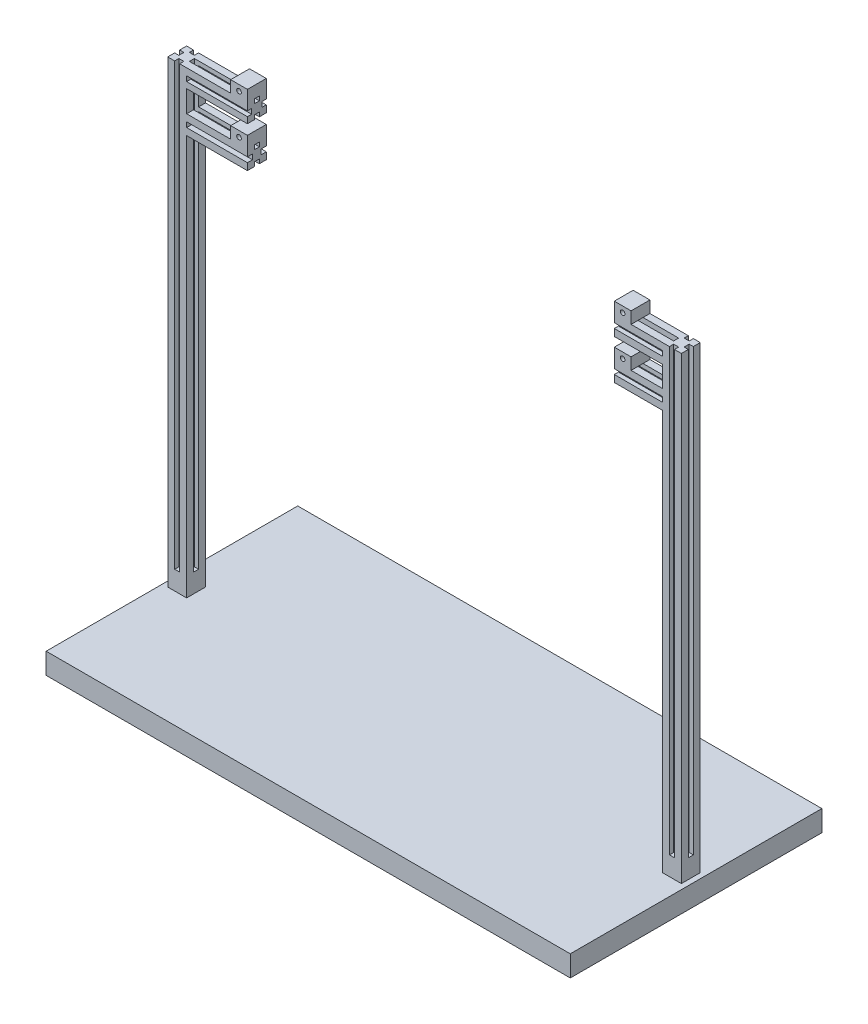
ISO-10303-21;
HEADER;
FILE_DESCRIPTION(('STEP AP214'),'2;1');
FILE_NAME('part.step','',(''),(''),'','','');
FILE_SCHEMA(('AUTOMOTIVE_DESIGN { 1 0 10303 214 1 1 1 1 }'));
ENDSEC;
DATA;
#1=APPLICATION_CONTEXT('core data for automotive mechanical design processes');
#2=APPLICATION_PROTOCOL_DEFINITION('international standard','automotive_design',2000,#1);
#3=PRODUCT_CONTEXT('',#1,'mechanical');
#4=PRODUCT('Part','Part','',(#3));
#5=PRODUCT_RELATED_PRODUCT_CATEGORY('part','',(#4));
#6=PRODUCT_DEFINITION_FORMATION('','',#4);
#7=PRODUCT_DEFINITION_CONTEXT('part definition',#1,'design');
#8=PRODUCT_DEFINITION('design','',#6,#7);
#9=PRODUCT_DEFINITION_SHAPE('','',#8);
#10=(LENGTH_UNIT() NAMED_UNIT(*) SI_UNIT(.MILLI.,.METRE.));
#11=(NAMED_UNIT(*) PLANE_ANGLE_UNIT() SI_UNIT($,.RADIAN.));
#12=(NAMED_UNIT(*) SI_UNIT($,.STERADIAN.) SOLID_ANGLE_UNIT());
#13=UNCERTAINTY_MEASURE_WITH_UNIT(LENGTH_MEASURE(1.E-05),#10,'distance_accuracy_value','');
#14=(GEOMETRIC_REPRESENTATION_CONTEXT(3) GLOBAL_UNCERTAINTY_ASSIGNED_CONTEXT((#13)) GLOBAL_UNIT_ASSIGNED_CONTEXT((#10,
#11,#12)) REPRESENTATION_CONTEXT('',''));
#15=CARTESIAN_POINT('',(0.,0.,0.));
#16=DIRECTION('',(0.,0.,1.));
#17=DIRECTION('',(1.,0.,0.));
#18=AXIS2_PLACEMENT_3D('',#15,#16,#17);
#19=CARTESIAN_POINT('',(567.5,1145.,-22.5));
#20=DIRECTION('',(1.,0.,0.));
#21=DIRECTION('',(0.,0.,-1.));
#22=AXIS2_PLACEMENT_3D('',#19,#20,#21);
#23=PLANE('',#22);
#24=DIRECTION('',(0.,0.,-1.));
#25=VECTOR('',#24,1.);
#26=CARTESIAN_POINT('',(567.5,1116.5,0.));
#27=LINE('',#26,#25);
#28=CARTESIAN_POINT('',(567.5,1116.5,22.5));
#29=VERTEX_POINT('',#28);
#30=CARTESIAN_POINT('',(567.5,1116.5,12.5));
#31=VERTEX_POINT('',#30);
#32=EDGE_CURVE('E918',#29,#31,#27,.T.);
#33=ORIENTED_EDGE('',*,*,#32,.F.);
#34=DIRECTION('',(0.,-1.,0.));
#35=VECTOR('',#34,1.);
#36=CARTESIAN_POINT('',(567.5,1145.,22.5));
#37=LINE('',#36,#35);
#38=CARTESIAN_POINT('',(567.5,1128.5,22.5));
#39=VERTEX_POINT('',#38);
#40=EDGE_CURVE('E1233',#39,#29,#37,.T.);
#41=ORIENTED_EDGE('',*,*,#40,.F.);
#42=DIRECTION('',(0.,0.,-1.));
#43=VECTOR('',#42,1.);
#44=CARTESIAN_POINT('',(567.5,1128.5,0.));
#45=LINE('',#44,#43);
#46=CARTESIAN_POINT('',(567.5,1128.5,12.5));
#47=VERTEX_POINT('',#46);
#48=EDGE_CURVE('E870',#39,#47,#45,.T.);
#49=ORIENTED_EDGE('',*,*,#48,.T.);
#50=DIRECTION('',(0.,-1.,0.));
#51=VECTOR('',#50,1.);
#52=CARTESIAN_POINT('',(567.5,0.,12.5));
#53=LINE('',#52,#51);
#54=EDGE_CURVE('E921',#47,#31,#53,.T.);
#55=ORIENTED_EDGE('',*,*,#54,.T.);
#56=EDGE_LOOP('',(#33,#41,#49,#55));
#57=FACE_BOUND('',#56,.T.);
#58=ADVANCED_FACE('F35',(#57),#23,.F.);
#59=DIRECTION('',(0.,0.,1.));
#60=VECTOR('',#59,1.);
#61=CARTESIAN_POINT('',(567.5,1128.5,0.));
#62=LINE('',#61,#60);
#63=CARTESIAN_POINT('',(567.5,1128.5,-22.5));
#64=VERTEX_POINT('',#63);
#65=CARTESIAN_POINT('',(567.5,1128.5,-12.5));
#66=VERTEX_POINT('',#65);
#67=EDGE_CURVE('E902',#64,#66,#62,.T.);
#68=ORIENTED_EDGE('',*,*,#67,.F.);
#69=DIRECTION('',(0.,-1.,0.));
#70=VECTOR('',#69,1.);
#71=CARTESIAN_POINT('',(567.5,1145.,-22.5));
#72=LINE('',#71,#70);
#73=CARTESIAN_POINT('',(567.5,1116.5,-22.5));
#74=VERTEX_POINT('',#73);
#75=EDGE_CURVE('E1266',#64,#74,#72,.T.);
#76=ORIENTED_EDGE('',*,*,#75,.T.);
#77=DIRECTION('',(0.,0.,1.));
#78=VECTOR('',#77,1.);
#79=CARTESIAN_POINT('',(567.5,1116.5,0.));
#80=LINE('',#79,#78);
#81=CARTESIAN_POINT('',(567.5,1116.5,-12.5));
#82=VERTEX_POINT('',#81);
#83=EDGE_CURVE('E908',#74,#82,#80,.T.);
#84=ORIENTED_EDGE('',*,*,#83,.T.);
#85=DIRECTION('',(0.,-1.,0.));
#86=VECTOR('',#85,1.);
#87=CARTESIAN_POINT('',(567.5,0.,-12.4999999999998));
#88=LINE('',#87,#86);
#89=EDGE_CURVE('E905',#66,#82,#88,.T.);
#90=ORIENTED_EDGE('',*,*,#89,.F.);
#91=EDGE_LOOP('',(#68,#76,#84,#90));
#92=FACE_BOUND('',#91,.T.);
#93=ADVANCED_FACE('F1987',(#92),#23,.F.);
#94=CARTESIAN_POINT('',(-567.5,1145.,-22.5));
#95=DIRECTION('',(-1.,0.,0.));
#96=DIRECTION('',(0.,0.,1.));
#97=AXIS2_PLACEMENT_3D('',#94,#95,#96);
#98=PLANE('',#97);
#99=DIRECTION('',(0.,0.,-1.));
#100=VECTOR('',#99,1.);
#101=CARTESIAN_POINT('',(-567.5,1128.5,0.));
#102=LINE('',#101,#100);
#103=CARTESIAN_POINT('',(-567.5,1128.5,22.5));
#104=VERTEX_POINT('',#103);
#105=CARTESIAN_POINT('',(-567.5,1128.5,12.5));
#106=VERTEX_POINT('',#105);
#107=EDGE_CURVE('E3492',#104,#106,#102,.T.);
#108=ORIENTED_EDGE('',*,*,#107,.F.);
#109=DIRECTION('',(0.,-1.,0.));
#110=VECTOR('',#109,1.);
#111=CARTESIAN_POINT('',(-567.5,1145.,22.5));
#112=LINE('',#111,#110);
#113=CARTESIAN_POINT('',(-567.5,1116.5,22.5));
#114=VERTEX_POINT('',#113);
#115=EDGE_CURVE('E1402',#104,#114,#112,.T.);
#116=ORIENTED_EDGE('',*,*,#115,.T.);
#117=DIRECTION('',(0.,0.,-1.));
#118=VECTOR('',#117,1.);
#119=CARTESIAN_POINT('',(-567.5,1116.5,0.));
#120=LINE('',#119,#118);
#121=CARTESIAN_POINT('',(-567.5,1116.5,12.5));
#122=VERTEX_POINT('',#121);
#123=EDGE_CURVE('E3490',#114,#122,#120,.T.);
#124=ORIENTED_EDGE('',*,*,#123,.T.);
#125=DIRECTION('',(0.,-1.,0.));
#126=VECTOR('',#125,1.);
#127=CARTESIAN_POINT('',(-567.5,0.,12.5));
#128=LINE('',#127,#126);
#129=EDGE_CURVE('E3495',#106,#122,#128,.T.);
#130=ORIENTED_EDGE('',*,*,#129,.F.);
#131=EDGE_LOOP('',(#108,#116,#124,#130));
#132=FACE_BOUND('',#131,.T.);
#133=ADVANCED_FACE('F1994',(#132),#98,.F.);
#134=DIRECTION('',(0.,0.,-1.));
#135=VECTOR('',#134,1.);
#136=CARTESIAN_POINT('',(-567.5,1101.92469970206,0.));
#137=LINE('',#136,#135);
#138=CARTESIAN_POINT('',(-567.5,1101.92469970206,22.5));
#139=VERTEX_POINT('',#138);
#140=CARTESIAN_POINT('',(-567.5,1101.92469970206,5.99999999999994));
#141=VERTEX_POINT('',#140);
#142=EDGE_CURVE('E1507',#139,#141,#137,.T.);
#143=ORIENTED_EDGE('',*,*,#142,.F.);
#144=CARTESIAN_POINT('',(-567.5,1050.,22.5));
#145=VERTEX_POINT('',#144);
#146=EDGE_CURVE('E1400',#139,#145,#112,.T.);
#147=ORIENTED_EDGE('',*,*,#146,.T.);
#148=DIRECTION('',(0.,0.,-1.));
#149=VECTOR('',#148,1.);
#150=CARTESIAN_POINT('',(-567.5,1050.,0.));
#151=LINE('',#150,#149);
#152=CARTESIAN_POINT('',(-567.5,1050.,5.99999999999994));
#153=VERTEX_POINT('',#152);
#154=EDGE_CURVE('E1797',#145,#153,#151,.T.);
#155=ORIENTED_EDGE('',*,*,#154,.T.);
#156=DIRECTION('',(0.,1.,0.));
#157=VECTOR('',#156,1.);
#158=CARTESIAN_POINT('',(-567.5,95.,5.99999999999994));
#159=LINE('',#158,#157);
#160=EDGE_CURVE('E3526',#153,#141,#159,.T.);
#161=ORIENTED_EDGE('',*,*,#160,.T.);
#162=EDGE_LOOP('',(#143,#147,#155,#161));
#163=FACE_BOUND('',#162,.T.);
#164=ADVANCED_FACE('F3394',(#163),#98,.F.);
#165=DIRECTION('',(0.,0.,-1.));
#166=VECTOR('',#165,1.);
#167=CARTESIAN_POINT('',(-567.5,1101.92469970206,0.));
#168=LINE('',#167,#166);
#169=CARTESIAN_POINT('',(-567.5,1101.92469970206,-6.00000000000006));
#170=VERTEX_POINT('',#169);
#171=CARTESIAN_POINT('',(-567.5,1101.92469970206,-22.5));
#172=VERTEX_POINT('',#171);
#173=EDGE_CURVE('E1533',#170,#172,#168,.T.);
#174=ORIENTED_EDGE('',*,*,#173,.F.);
#175=DIRECTION('',(0.,1.,0.));
#176=VECTOR('',#175,1.);
#177=CARTESIAN_POINT('',(-567.5,95.,-6.00000000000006));
#178=LINE('',#177,#176);
#179=CARTESIAN_POINT('',(-567.5,1050.,-6.00000000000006));
#180=VERTEX_POINT('',#179);
#181=EDGE_CURVE('E1042',#180,#170,#178,.T.);
#182=ORIENTED_EDGE('',*,*,#181,.F.);
#183=DIRECTION('',(0.,0.,-1.));
#184=VECTOR('',#183,1.);
#185=CARTESIAN_POINT('',(-567.5,1050.,0.));
#186=LINE('',#185,#184);
#187=CARTESIAN_POINT('',(-567.5,1050.,-22.5));
#188=VERTEX_POINT('',#187);
#189=EDGE_CURVE('E1756',#180,#188,#186,.T.);
#190=ORIENTED_EDGE('',*,*,#189,.T.);
#191=DIRECTION('',(0.,-1.,0.));
#192=VECTOR('',#191,1.);
#193=CARTESIAN_POINT('',(-567.5,1145.,-22.5));
#194=LINE('',#193,#192);
#195=EDGE_CURVE('E1396',#172,#188,#194,.T.);
#196=ORIENTED_EDGE('',*,*,#195,.F.);
#197=EDGE_LOOP('',(#174,#182,#190,#196));
#198=FACE_BOUND('',#197,.T.);
#199=ADVANCED_FACE('F3386',(#198),#98,.F.);
#200=DIRECTION('',(0.,0.,1.));
#201=VECTOR('',#200,1.);
#202=CARTESIAN_POINT('',(-567.5,1118.42469970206,0.));
#203=LINE('',#202,#201);
#204=CARTESIAN_POINT('',(-567.5,1118.42469970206,-22.5));
#205=VERTEX_POINT('',#204);
#206=CARTESIAN_POINT('',(-567.5,1118.42469970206,-12.5));
#207=VERTEX_POINT('',#206);
#208=EDGE_CURVE('E3503',#205,#207,#203,.T.);
#209=ORIENTED_EDGE('',*,*,#208,.F.);
#210=CARTESIAN_POINT('',(-567.5,1130.42469970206,-22.5));
#211=VERTEX_POINT('',#210);
#212=EDGE_CURVE('E1398',#211,#205,#194,.T.);
#213=ORIENTED_EDGE('',*,*,#212,.F.);
#214=DIRECTION('',(0.,0.,1.));
#215=VECTOR('',#214,1.);
#216=CARTESIAN_POINT('',(-567.5,1130.42469970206,0.));
#217=LINE('',#216,#215);
#218=CARTESIAN_POINT('',(-567.5,1130.42469970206,-12.5));
#219=VERTEX_POINT('',#218);
#220=EDGE_CURVE('E3509',#211,#219,#217,.T.);
#221=ORIENTED_EDGE('',*,*,#220,.T.);
#222=DIRECTION('',(0.,-1.,0.));
#223=VECTOR('',#222,1.);
#224=CARTESIAN_POINT('',(-567.5,0.,-12.5000000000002));
#225=LINE('',#224,#223);
#226=EDGE_CURVE('E3506',#219,#207,#225,.T.);
#227=ORIENTED_EDGE('',*,*,#226,.T.);
#228=EDGE_LOOP('',(#209,#213,#221,#227));
#229=FACE_BOUND('',#228,.T.);
#230=ADVANCED_FACE('F2023',(#229),#98,.F.);
#231=CARTESIAN_POINT('',(452.5,1050.,0.));
#232=DIRECTION('',(0.,1.,0.));
#233=DIRECTION('',(0.,0.,1.));
#234=AXIS2_PLACEMENT_3D('',#231,#232,#233);
#235=PLANE('',#234);
#236=DIRECTION('',(1.,0.,0.));
#237=VECTOR('',#236,1.);
#238=CARTESIAN_POINT('',(452.5,1050.,6.00000000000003));
#239=LINE('',#238,#237);
#240=CARTESIAN_POINT('',(492.5,1050.,6.00000000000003));
#241=VERTEX_POINT('',#240);
#242=CARTESIAN_POINT('',(567.5,1050.,6.00000000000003));
#243=VERTEX_POINT('',#242);
#244=EDGE_CURVE('E1726',#241,#243,#239,.T.);
#245=ORIENTED_EDGE('',*,*,#244,.F.);
#246=DIRECTION('',(0.,0.,-1.));
#247=VECTOR('',#246,1.);
#248=CARTESIAN_POINT('',(492.5,1050.,-22.5));
#249=LINE('',#248,#247);
#250=CARTESIAN_POINT('',(492.5,1050.,22.5));
#251=VERTEX_POINT('',#250);
#252=EDGE_CURVE('E1570',#251,#241,#249,.T.);
#253=ORIENTED_EDGE('',*,*,#252,.F.);
#254=DIRECTION('',(1.,0.,0.));
#255=VECTOR('',#254,1.);
#256=CARTESIAN_POINT('',(452.5,1050.,22.5));
#257=LINE('',#256,#255);
#258=CARTESIAN_POINT('',(567.5,1050.,22.5));
#259=VERTEX_POINT('',#258);
#260=EDGE_CURVE('E1730',#251,#259,#257,.T.);
#261=ORIENTED_EDGE('',*,*,#260,.T.);
#262=DIRECTION('',(0.,0.,1.));
#263=VECTOR('',#262,1.);
#264=CARTESIAN_POINT('',(567.5,1050.,0.));
#265=LINE('',#264,#263);
#266=EDGE_CURVE('E1676',#243,#259,#265,.T.);
#267=ORIENTED_EDGE('',*,*,#266,.F.);
#268=EDGE_LOOP('',(#245,#253,#261,#267));
#269=FACE_BOUND('',#268,.T.);
#270=ADVANCED_FACE('F2032',(#269),#235,.T.);
#271=CARTESIAN_POINT('',(452.5,1050.,0.));
#272=DIRECTION('',(0.,1.,0.));
#273=DIRECTION('',(0.,0.,1.));
#274=AXIS2_PLACEMENT_3D('',#271,#272,#273);
#275=PLANE('',#274);
#276=DIRECTION('',(1.,0.,0.));
#277=VECTOR('',#276,1.);
#278=CARTESIAN_POINT('',(452.5,1050.,-22.5));
#279=LINE('',#278,#277);
#280=CARTESIAN_POINT('',(492.5,1050.,-22.5));
#281=VERTEX_POINT('',#280);
#282=CARTESIAN_POINT('',(567.5,1050.,-22.5));
#283=VERTEX_POINT('',#282);
#284=EDGE_CURVE('E1715',#281,#283,#279,.T.);
#285=ORIENTED_EDGE('',*,*,#284,.F.);
#286=CARTESIAN_POINT('',(492.5,1050.,-5.99999999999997));
#287=VERTEX_POINT('',#286);
#288=EDGE_CURVE('E1580',#287,#281,#249,.T.);
#289=ORIENTED_EDGE('',*,*,#288,.F.);
#290=DIRECTION('',(1.,0.,0.));
#291=VECTOR('',#290,1.);
#292=CARTESIAN_POINT('',(452.5,1050.,-5.99999999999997));
#293=LINE('',#292,#291);
#294=CARTESIAN_POINT('',(567.5,1050.,-5.99999999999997));
#295=VERTEX_POINT('',#294);
#296=EDGE_CURVE('E1717',#287,#295,#293,.T.);
#297=ORIENTED_EDGE('',*,*,#296,.T.);
#298=DIRECTION('',(0.,0.,1.));
#299=VECTOR('',#298,1.);
#300=CARTESIAN_POINT('',(567.5,1050.,0.));
#301=LINE('',#300,#299);
#302=EDGE_CURVE('E1682',#283,#295,#301,.T.);
#303=ORIENTED_EDGE('',*,*,#302,.F.);
#304=EDGE_LOOP('',(#285,#289,#297,#303));
#305=FACE_BOUND('',#304,.T.);
#306=ADVANCED_FACE('F2704',(#305),#275,.T.);
#307=CARTESIAN_POINT('',(-422.5,1050.,0.));
#308=DIRECTION('',(0.,1.,0.));
#309=DIRECTION('',(0.,0.,1.));
#310=AXIS2_PLACEMENT_3D('',#307,#308,#309);
#311=PLANE('',#310);
#312=DIRECTION('',(-1.,0.,0.));
#313=VECTOR('',#312,1.);
#314=CARTESIAN_POINT('',(-422.5,1050.,22.5));
#315=LINE('',#314,#313);
#316=CARTESIAN_POINT('',(-462.5,1050.,22.5));
#317=VERTEX_POINT('',#316);
#318=EDGE_CURVE('E1869',#317,#145,#315,.T.);
#319=ORIENTED_EDGE('',*,*,#318,.F.);
#320=DIRECTION('',(0.,0.,1.));
#321=VECTOR('',#320,1.);
#322=CARTESIAN_POINT('',(-462.5,1050.,-22.5));
#323=LINE('',#322,#321);
#324=CARTESIAN_POINT('',(-462.5,1050.,5.99999999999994));
#325=VERTEX_POINT('',#324);
#326=EDGE_CURVE('E1610',#325,#317,#323,.T.);
#327=ORIENTED_EDGE('',*,*,#326,.F.);
#328=DIRECTION('',(-1.,0.,0.));
#329=VECTOR('',#328,1.);
#330=CARTESIAN_POINT('',(-422.5,1050.,5.99999999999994));
#331=LINE('',#330,#329);
#332=EDGE_CURVE('E1871',#325,#153,#331,.T.);
#333=ORIENTED_EDGE('',*,*,#332,.T.);
#334=ORIENTED_EDGE('',*,*,#154,.F.);
#335=EDGE_LOOP('',(#319,#327,#333,#334));
#336=FACE_BOUND('',#335,.T.);
#337=ADVANCED_FACE('F2695',(#336),#311,.T.);
#338=CARTESIAN_POINT('',(-422.5,1050.,0.));
#339=DIRECTION('',(0.,1.,0.));
#340=DIRECTION('',(0.,0.,1.));
#341=AXIS2_PLACEMENT_3D('',#338,#339,#340);
#342=PLANE('',#341);
#343=DIRECTION('',(-1.,0.,0.));
#344=VECTOR('',#343,1.);
#345=CARTESIAN_POINT('',(-422.5,1050.,-6.00000000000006));
#346=LINE('',#345,#344);
#347=CARTESIAN_POINT('',(-462.5,1050.,-6.00000000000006));
#348=VERTEX_POINT('',#347);
#349=EDGE_CURVE('E1827',#348,#180,#346,.T.);
#350=ORIENTED_EDGE('',*,*,#349,.F.);
#351=CARTESIAN_POINT('',(-462.5,1050.,-22.5));
#352=VERTEX_POINT('',#351);
#353=EDGE_CURVE('E1600',#352,#348,#323,.T.);
#354=ORIENTED_EDGE('',*,*,#353,.F.);
#355=DIRECTION('',(-1.,0.,0.));
#356=VECTOR('',#355,1.);
#357=CARTESIAN_POINT('',(-422.5,1050.,-22.5));
#358=LINE('',#357,#356);
#359=EDGE_CURVE('E1831',#352,#188,#358,.T.);
#360=ORIENTED_EDGE('',*,*,#359,.T.);
#361=ORIENTED_EDGE('',*,*,#189,.F.);
#362=EDGE_LOOP('',(#350,#354,#360,#361));
#363=FACE_BOUND('',#362,.T.);
#364=ADVANCED_FACE('F2689',(#363),#342,.T.);
#365=DIRECTION('',(0.,0.,1.));
#366=VECTOR('',#365,1.);
#367=CARTESIAN_POINT('',(567.5,1005.,0.));
#368=LINE('',#367,#366);
#369=CARTESIAN_POINT('',(567.5,1005.,6.00000000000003));
#370=VERTEX_POINT('',#369);
#371=CARTESIAN_POINT('',(567.5,1005.,22.5));
#372=VERTEX_POINT('',#371);
#373=EDGE_CURVE('E1665',#370,#372,#368,.T.);
#374=ORIENTED_EDGE('',*,*,#373,.F.);
#375=DIRECTION('',(0.,1.,0.));
#376=VECTOR('',#375,1.);
#377=CARTESIAN_POINT('',(567.5,95.,6.00000000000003));
#378=LINE('',#377,#376);
#379=CARTESIAN_POINT('',(567.5,95.,6.00000000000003));
#380=VERTEX_POINT('',#379);
#381=EDGE_CURVE('E3631',#380,#370,#378,.T.);
#382=ORIENTED_EDGE('',*,*,#381,.F.);
#383=DIRECTION('',(0.,0.,1.));
#384=VECTOR('',#383,1.);
#385=CARTESIAN_POINT('',(567.5,95.,0.));
#386=LINE('',#385,#384);
#387=CARTESIAN_POINT('',(567.5,95.,-5.99999999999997));
#388=VERTEX_POINT('',#387);
#389=EDGE_CURVE('E1936',#388,#380,#386,.T.);
#390=ORIENTED_EDGE('',*,*,#389,.F.);
#391=DIRECTION('',(0.,1.,0.));
#392=VECTOR('',#391,1.);
#393=CARTESIAN_POINT('',(567.5,95.,-5.99999999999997));
#394=LINE('',#393,#392);
#395=CARTESIAN_POINT('',(567.5,1005.,-5.99999999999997));
#396=VERTEX_POINT('',#395);
#397=EDGE_CURVE('E1949',#388,#396,#394,.T.);
#398=ORIENTED_EDGE('',*,*,#397,.T.);
#399=DIRECTION('',(0.,0.,1.));
#400=VECTOR('',#399,1.);
#401=CARTESIAN_POINT('',(567.5,1005.,0.));
#402=LINE('',#401,#400);
#403=CARTESIAN_POINT('',(567.5,1005.,-22.5));
#404=VERTEX_POINT('',#403);
#405=EDGE_CURVE('E1624',#404,#396,#402,.T.);
#406=ORIENTED_EDGE('',*,*,#405,.F.);
#407=CARTESIAN_POINT('',(567.5,50.,-22.5));
#408=VERTEX_POINT('',#407);
#409=EDGE_CURVE('E1280',#404,#408,#72,.T.);
#410=ORIENTED_EDGE('',*,*,#409,.T.);
#411=DIRECTION('',(0.,0.,1.));
#412=VECTOR('',#411,1.);
#413=CARTESIAN_POINT('',(567.5,50.,-22.5));
#414=LINE('',#413,#412);
#415=CARTESIAN_POINT('',(567.5,50.,22.5));
#416=VERTEX_POINT('',#415);
#417=EDGE_CURVE('E1131',#408,#416,#414,.T.);
#418=ORIENTED_EDGE('',*,*,#417,.T.);
#419=EDGE_CURVE('E1247',#372,#416,#37,.T.);
#420=ORIENTED_EDGE('',*,*,#419,.F.);
#421=EDGE_LOOP('',(#374,#382,#390,#398,#406,#410,#418,#420));
#422=FACE_BOUND('',#421,.T.);
#423=ADVANCED_FACE('F1996',(#422),#23,.F.);
#424=DIRECTION('',(0.,0.,-1.));
#425=VECTOR('',#424,1.);
#426=CARTESIAN_POINT('',(567.5,1021.5,0.));
#427=LINE('',#426,#425);
#428=CARTESIAN_POINT('',(567.5,1021.5,22.5));
#429=VERTEX_POINT('',#428);
#430=CARTESIAN_POINT('',(567.5,1021.5,12.5));
#431=VERTEX_POINT('',#430);
#432=EDGE_CURVE('E1667',#429,#431,#427,.T.);
#433=ORIENTED_EDGE('',*,*,#432,.F.);
#434=CARTESIAN_POINT('',(567.5,1033.5,22.5));
#435=VERTEX_POINT('',#434);
#436=EDGE_CURVE('E1251',#435,#429,#37,.T.);
#437=ORIENTED_EDGE('',*,*,#436,.F.);
#438=DIRECTION('',(0.,0.,-1.));
#439=VECTOR('',#438,1.);
#440=CARTESIAN_POINT('',(567.5,1033.5,0.));
#441=LINE('',#440,#439);
#442=CARTESIAN_POINT('',(567.5,1033.5,12.5));
#443=VERTEX_POINT('',#442);
#444=EDGE_CURVE('E1673',#435,#443,#441,.T.);
#445=ORIENTED_EDGE('',*,*,#444,.T.);
#446=DIRECTION('',(0.,-1.,0.));
#447=VECTOR('',#446,1.);
#448=CARTESIAN_POINT('',(567.5,0.,12.5000000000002));
#449=LINE('',#448,#447);
#450=EDGE_CURVE('E1670',#443,#431,#449,.T.);
#451=ORIENTED_EDGE('',*,*,#450,.T.);
#452=EDGE_LOOP('',(#433,#437,#445,#451));
#453=FACE_BOUND('',#452,.T.);
#454=ADVANCED_FACE('F2025',(#453),#23,.F.);
#455=DIRECTION('',(0.,0.,1.));
#456=VECTOR('',#455,1.);
#457=CARTESIAN_POINT('',(567.5,1033.5,0.));
#458=LINE('',#457,#456);
#459=CARTESIAN_POINT('',(567.5,1033.5,-22.5));
#460=VERTEX_POINT('',#459);
#461=CARTESIAN_POINT('',(567.5,1033.5,-12.5));
#462=VERTEX_POINT('',#461);
#463=EDGE_CURVE('E1685',#460,#462,#458,.T.);
#464=ORIENTED_EDGE('',*,*,#463,.F.);
#465=CARTESIAN_POINT('',(567.5,1021.5,-22.5));
#466=VERTEX_POINT('',#465);
#467=EDGE_CURVE('E1270',#460,#466,#72,.T.);
#468=ORIENTED_EDGE('',*,*,#467,.T.);
#469=DIRECTION('',(0.,0.,1.));
#470=VECTOR('',#469,1.);
#471=CARTESIAN_POINT('',(567.5,1021.5,0.));
#472=LINE('',#471,#470);
#473=CARTESIAN_POINT('',(567.5,1021.5,-12.5));
#474=VERTEX_POINT('',#473);
#475=EDGE_CURVE('E1691',#466,#474,#472,.T.);
#476=ORIENTED_EDGE('',*,*,#475,.T.);
#477=DIRECTION('',(0.,-1.,0.));
#478=VECTOR('',#477,1.);
#479=CARTESIAN_POINT('',(567.5,0.,-12.4999999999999));
#480=LINE('',#479,#478);
#481=EDGE_CURVE('E1688',#462,#474,#480,.T.);
#482=ORIENTED_EDGE('',*,*,#481,.F.);
#483=EDGE_LOOP('',(#464,#468,#476,#482));
#484=FACE_BOUND('',#483,.T.);
#485=ADVANCED_FACE('F2016',(#484),#23,.F.);
#486=CARTESIAN_POINT('',(567.5,1100.,22.5));
#487=VERTEX_POINT('',#486);
#488=EDGE_CURVE('E1245',#487,#259,#37,.T.);
#489=ORIENTED_EDGE('',*,*,#488,.F.);
#490=DIRECTION('',(0.,0.,-1.));
#491=VECTOR('',#490,1.);
#492=CARTESIAN_POINT('',(567.5,1100.,0.));
#493=LINE('',#492,#491);
#494=CARTESIAN_POINT('',(567.5,1100.,6.00000000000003));
#495=VERTEX_POINT('',#494);
#496=EDGE_CURVE('E915',#487,#495,#493,.T.);
#497=ORIENTED_EDGE('',*,*,#496,.T.);
#498=EDGE_CURVE('E1223',#243,#495,#378,.T.);
#499=ORIENTED_EDGE('',*,*,#498,.F.);
#500=ORIENTED_EDGE('',*,*,#266,.T.);
#501=EDGE_LOOP('',(#489,#497,#499,#500));
#502=FACE_BOUND('',#501,.T.);
#503=ADVANCED_FACE('F2002',(#502),#23,.F.);
#504=DIRECTION('',(0.,0.,-1.));
#505=VECTOR('',#504,1.);
#506=CARTESIAN_POINT('',(-567.5,1033.5,0.));
#507=LINE('',#506,#505);
#508=CARTESIAN_POINT('',(-567.5,1033.5,22.5));
#509=VERTEX_POINT('',#508);
#510=CARTESIAN_POINT('',(-567.5,1033.5,10.5));
#511=VERTEX_POINT('',#510);
#512=EDGE_CURVE('E1800',#509,#511,#507,.T.);
#513=ORIENTED_EDGE('',*,*,#512,.F.);
#514=CARTESIAN_POINT('',(-567.5,1021.5,22.5));
#515=VERTEX_POINT('',#514);
#516=EDGE_CURVE('E1403',#509,#515,#112,.T.);
#517=ORIENTED_EDGE('',*,*,#516,.T.);
#518=DIRECTION('',(0.,0.,-1.));
#519=VECTOR('',#518,1.);
#520=CARTESIAN_POINT('',(-567.5,1021.5,0.));
#521=LINE('',#520,#519);
#522=CARTESIAN_POINT('',(-567.5,1021.5,10.5));
#523=VERTEX_POINT('',#522);
#524=EDGE_CURVE('E1806',#515,#523,#521,.T.);
#525=ORIENTED_EDGE('',*,*,#524,.T.);
#526=DIRECTION('',(0.,-1.,0.));
#527=VECTOR('',#526,1.);
#528=CARTESIAN_POINT('',(-567.5,0.,10.4999999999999));
#529=LINE('',#528,#527);
#530=EDGE_CURVE('E1803',#511,#523,#529,.T.);
#531=ORIENTED_EDGE('',*,*,#530,.F.);
#532=EDGE_LOOP('',(#513,#517,#525,#531));
#533=FACE_BOUND('',#532,.T.);
#534=ADVANCED_FACE('F2015',(#533),#98,.F.);
#535=DIRECTION('',(0.,0.,-1.));
#536=VECTOR('',#535,1.);
#537=CARTESIAN_POINT('',(-567.5,1005.,0.));
#538=LINE('',#537,#536);
#539=CARTESIAN_POINT('',(-567.5,1005.,22.5));
#540=VERTEX_POINT('',#539);
#541=CARTESIAN_POINT('',(-567.5,1005.,5.99999999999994));
#542=VERTEX_POINT('',#541);
#543=EDGE_CURVE('E1808',#540,#542,#538,.T.);
#544=ORIENTED_EDGE('',*,*,#543,.F.);
#545=CARTESIAN_POINT('',(-567.5,50.,22.5));
#546=VERTEX_POINT('',#545);
#547=EDGE_CURVE('E3475',#540,#546,#112,.T.);
#548=ORIENTED_EDGE('',*,*,#547,.T.);
#549=DIRECTION('',(0.,0.,-1.));
#550=VECTOR('',#549,1.);
#551=CARTESIAN_POINT('',(-567.5,50.,-22.5));
#552=LINE('',#551,#550);
#553=CARTESIAN_POINT('',(-567.5,50.,-22.5));
#554=VERTEX_POINT('',#553);
#555=EDGE_CURVE('E1390',#546,#554,#552,.T.);
#556=ORIENTED_EDGE('',*,*,#555,.T.);
#557=CARTESIAN_POINT('',(-567.5,1005.,-22.5));
#558=VERTEX_POINT('',#557);
#559=EDGE_CURVE('E1374',#558,#554,#194,.T.);
#560=ORIENTED_EDGE('',*,*,#559,.F.);
#561=DIRECTION('',(0.,0.,-1.));
#562=VECTOR('',#561,1.);
#563=CARTESIAN_POINT('',(-567.5,1005.,0.));
#564=LINE('',#563,#562);
#565=CARTESIAN_POINT('',(-567.5,1005.,-6.00000000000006));
#566=VERTEX_POINT('',#565);
#567=EDGE_CURVE('E1332',#566,#558,#564,.T.);
#568=ORIENTED_EDGE('',*,*,#567,.F.);
#569=CARTESIAN_POINT('',(-567.5,95.,-6.00000000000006));
#570=VERTEX_POINT('',#569);
#571=EDGE_CURVE('E1038',#570,#566,#178,.T.);
#572=ORIENTED_EDGE('',*,*,#571,.F.);
#573=DIRECTION('',(0.,0.,-1.));
#574=VECTOR('',#573,1.);
#575=CARTESIAN_POINT('',(-567.5,95.,0.));
#576=LINE('',#575,#574);
#577=CARTESIAN_POINT('',(-567.5,95.,5.99999999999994));
#578=VERTEX_POINT('',#577);
#579=EDGE_CURVE('E1032',#578,#570,#576,.T.);
#580=ORIENTED_EDGE('',*,*,#579,.F.);
#581=EDGE_CURVE('E1043',#578,#542,#159,.T.);
#582=ORIENTED_EDGE('',*,*,#581,.T.);
#583=EDGE_LOOP('',(#544,#548,#556,#560,#568,#572,#580,#582));
#584=FACE_BOUND('',#583,.T.);
#585=ADVANCED_FACE('F1330',(#584),#98,.F.);
#586=DIRECTION('',(0.,0.,1.));
#587=VECTOR('',#586,1.);
#588=CARTESIAN_POINT('',(-567.5,1021.5,0.));
#589=LINE('',#588,#587);
#590=CARTESIAN_POINT('',(-567.5,1021.5,-22.5));
#591=VERTEX_POINT('',#590);
#592=CARTESIAN_POINT('',(-567.5,1021.5,-9.7906838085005));
#593=VERTEX_POINT('',#592);
#594=EDGE_CURVE('E1815',#591,#593,#589,.T.);
#595=ORIENTED_EDGE('',*,*,#594,.F.);
#596=CARTESIAN_POINT('',(-567.5,1033.5,-22.5));
#597=VERTEX_POINT('',#596);
#598=EDGE_CURVE('E1399',#597,#591,#194,.T.);
#599=ORIENTED_EDGE('',*,*,#598,.F.);
#600=DIRECTION('',(0.,0.,1.));
#601=VECTOR('',#600,1.);
#602=CARTESIAN_POINT('',(-567.5,1033.5,0.));
#603=LINE('',#602,#601);
#604=CARTESIAN_POINT('',(-567.5,1033.5,-9.7906838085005));
#605=VERTEX_POINT('',#604);
#606=EDGE_CURVE('E1821',#597,#605,#603,.T.);
#607=ORIENTED_EDGE('',*,*,#606,.T.);
#608=DIRECTION('',(0.,-1.,0.));
#609=VECTOR('',#608,1.);
#610=CARTESIAN_POINT('',(-567.5,0.,-9.79068380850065));
#611=LINE('',#610,#609);
#612=EDGE_CURVE('E1818',#605,#593,#611,.T.);
#613=ORIENTED_EDGE('',*,*,#612,.T.);
#614=EDGE_LOOP('',(#595,#599,#607,#613));
#615=FACE_BOUND('',#614,.T.);
#616=ADVANCED_FACE('F2439',(#615),#98,.F.);
#617=CARTESIAN_POINT('',(0.,1145.,0.));
#618=DIRECTION('',(0.,1.,0.));
#619=DIRECTION('',(0.,0.,1.));
#620=AXIS2_PLACEMENT_3D('',#617,#618,#619);
#621=PLANE('',#620);
#622=DIRECTION('',(0.,0.,-1.));
#623=VECTOR('',#622,1.);
#624=CARTESIAN_POINT('',(492.5,1145.,-22.5));
#625=LINE('',#624,#623);
#626=CARTESIAN_POINT('',(492.5,1145.,22.5));
#627=VERTEX_POINT('',#626);
#628=CARTESIAN_POINT('',(492.5,1145.,6.00000000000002));
#629=VERTEX_POINT('',#628);
#630=EDGE_CURVE('E53',#627,#629,#625,.T.);
#631=ORIENTED_EDGE('',*,*,#630,.F.);
#632=DIRECTION('',(1.,0.,0.));
#633=VECTOR('',#632,1.);
#634=CARTESIAN_POINT('',(567.5,1145.,22.5));
#635=LINE('',#634,#633);
#636=CARTESIAN_POINT('',(584.,1145.,22.5));
#637=VERTEX_POINT('',#636);
#638=EDGE_CURVE('E1140',#627,#637,#635,.T.);
#639=ORIENTED_EDGE('',*,*,#638,.T.);
#640=DIRECTION('',(0.,0.,-1.));
#641=VECTOR('',#640,1.);
#642=CARTESIAN_POINT('',(584.,1145.,0.));
#643=LINE('',#642,#641);
#644=CARTESIAN_POINT('',(584.,1145.,12.5));
#645=VERTEX_POINT('',#644);
#646=EDGE_CURVE('E1911',#637,#645,#643,.T.);
#647=ORIENTED_EDGE('',*,*,#646,.T.);
#648=DIRECTION('',(1.,0.,0.));
#649=VECTOR('',#648,1.);
#650=CARTESIAN_POINT('',(0.,1145.,12.5));
#651=LINE('',#650,#649);
#652=CARTESIAN_POINT('',(596.,1145.,12.5));
#653=VERTEX_POINT('',#652);
#654=EDGE_CURVE('E1921',#645,#653,#651,.T.);
#655=ORIENTED_EDGE('',*,*,#654,.T.);
#656=DIRECTION('',(0.,0.,-1.));
#657=VECTOR('',#656,1.);
#658=CARTESIAN_POINT('',(596.,1145.,0.));
#659=LINE('',#658,#657);
#660=CARTESIAN_POINT('',(596.,1145.,22.5));
#661=VERTEX_POINT('',#660);
#662=EDGE_CURVE('E1901',#661,#653,#659,.T.);
#663=ORIENTED_EDGE('',*,*,#662,.F.);
#664=CARTESIAN_POINT('',(612.5,1145.,22.5));
#665=VERTEX_POINT('',#664);
#666=EDGE_CURVE('E1137',#661,#665,#635,.T.);
#667=ORIENTED_EDGE('',*,*,#666,.T.);
#668=DIRECTION('',(0.,0.,-1.));
#669=VECTOR('',#668,1.);
#670=CARTESIAN_POINT('',(612.5,1145.,-22.5));
#671=LINE('',#670,#669);
#672=CARTESIAN_POINT('',(612.5,1145.,6.00000000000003));
#673=VERTEX_POINT('',#672);
#674=EDGE_CURVE('E1142',#665,#673,#671,.T.);
#675=ORIENTED_EDGE('',*,*,#674,.T.);
#676=DIRECTION('',(-1.,0.,0.));
#677=VECTOR('',#676,1.);
#678=CARTESIAN_POINT('',(0.,1145.,6.00000000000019));
#679=LINE('',#678,#677);
#680=CARTESIAN_POINT('',(602.5,1145.,6.00000000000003));
#681=VERTEX_POINT('',#680);
#682=EDGE_CURVE('E1885',#673,#681,#679,.T.);
#683=ORIENTED_EDGE('',*,*,#682,.T.);
#684=DIRECTION('',(0.,0.,1.));
#685=VECTOR('',#684,1.);
#686=CARTESIAN_POINT('',(602.5,1145.,0.));
#687=LINE('',#686,#685);
#688=CARTESIAN_POINT('',(602.5,1145.,-5.99999999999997));
#689=VERTEX_POINT('',#688);
#690=EDGE_CURVE('E1895',#689,#681,#687,.T.);
#691=ORIENTED_EDGE('',*,*,#690,.F.);
#692=DIRECTION('',(-1.,0.,0.));
#693=VECTOR('',#692,1.);
#694=CARTESIAN_POINT('',(0.,1145.,-5.99999999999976));
#695=LINE('',#694,#693);
#696=CARTESIAN_POINT('',(612.5,1145.,-5.99999999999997));
#697=VERTEX_POINT('',#696);
#698=EDGE_CURVE('E1292',#697,#689,#695,.T.);
#699=ORIENTED_EDGE('',*,*,#698,.F.);
#700=CARTESIAN_POINT('',(612.5,1145.,-22.5));
#701=VERTEX_POINT('',#700);
#702=EDGE_CURVE('E1146',#697,#701,#671,.T.);
#703=ORIENTED_EDGE('',*,*,#702,.T.);
#704=DIRECTION('',(-1.,0.,0.));
#705=VECTOR('',#704,1.);
#706=CARTESIAN_POINT('',(567.5,1145.,-22.5));
#707=LINE('',#706,#705);
#708=CARTESIAN_POINT('',(596.,1145.,-22.5));
#709=VERTEX_POINT('',#708);
#710=EDGE_CURVE('E1277',#701,#709,#707,.T.);
#711=ORIENTED_EDGE('',*,*,#710,.T.);
#712=DIRECTION('',(0.,0.,1.));
#713=VECTOR('',#712,1.);
#714=CARTESIAN_POINT('',(596.,1145.,0.));
#715=LINE('',#714,#713);
#716=CARTESIAN_POINT('',(596.,1145.,-12.5));
#717=VERTEX_POINT('',#716);
#718=EDGE_CURVE('E1955',#709,#717,#715,.T.);
#719=ORIENTED_EDGE('',*,*,#718,.T.);
#720=DIRECTION('',(1.,0.,0.));
#721=VECTOR('',#720,1.);
#722=CARTESIAN_POINT('',(0.,1145.,-12.5));
#723=LINE('',#722,#721);
#724=CARTESIAN_POINT('',(584.,1145.,-12.5));
#725=VERTEX_POINT('',#724);
#726=EDGE_CURVE('E1963',#725,#717,#723,.T.);
#727=ORIENTED_EDGE('',*,*,#726,.F.);
#728=DIRECTION('',(0.,0.,1.));
#729=VECTOR('',#728,1.);
#730=CARTESIAN_POINT('',(584.,1145.,0.));
#731=LINE('',#730,#729);
#732=CARTESIAN_POINT('',(584.,1145.,-22.5));
#733=VERTEX_POINT('',#732);
#734=EDGE_CURVE('E1961',#733,#725,#731,.T.);
#735=ORIENTED_EDGE('',*,*,#734,.F.);
#736=CARTESIAN_POINT('',(492.5,1145.,-22.5));
#737=VERTEX_POINT('',#736);
#738=EDGE_CURVE('E1147',#733,#737,#707,.T.);
#739=ORIENTED_EDGE('',*,*,#738,.T.);
#740=CARTESIAN_POINT('',(492.5,1145.,-5.99999999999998));
#741=VERTEX_POINT('',#740);
#742=EDGE_CURVE('E11',#741,#737,#625,.T.);
#743=ORIENTED_EDGE('',*,*,#742,.F.);
#744=DIRECTION('',(1.,0.,0.));
#745=VECTOR('',#744,1.);
#746=CARTESIAN_POINT('',(0.,1145.,-6.00000000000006));
#747=LINE('',#746,#745);
#748=CARTESIAN_POINT('',(577.5,1145.,-5.99999999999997));
#749=VERTEX_POINT('',#748);
#750=EDGE_CURVE('E1158',#741,#749,#747,.T.);
#751=ORIENTED_EDGE('',*,*,#750,.T.);
#752=DIRECTION('',(0.,0.,1.));
#753=VECTOR('',#752,1.);
#754=CARTESIAN_POINT('',(577.5,1145.,0.));
#755=LINE('',#754,#753);
#756=CARTESIAN_POINT('',(577.5,1145.,6.00000000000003));
#757=VERTEX_POINT('',#756);
#758=EDGE_CURVE('E1163',#749,#757,#755,.T.);
#759=ORIENTED_EDGE('',*,*,#758,.T.);
#760=DIRECTION('',(1.,0.,0.));
#761=VECTOR('',#760,1.);
#762=CARTESIAN_POINT('',(0.,1145.,5.99999999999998));
#763=LINE('',#762,#761);
#764=EDGE_CURVE('E1157',#629,#757,#763,.T.);
#765=ORIENTED_EDGE('',*,*,#764,.F.);
#766=EDGE_LOOP('',(#631,#639,#647,#655,#663,#667,#675,#683,#691,#699,#703,#711,#719,#727,#735,
#739,#743,#751,#759,#765));
#767=FACE_BOUND('',#766,.T.);
#768=ADVANCED_FACE('F1289',(#767),#621,.T.);
#769=CARTESIAN_POINT('',(612.5,1145.,-22.5));
#770=DIRECTION('',(-1.,0.,0.));
#771=DIRECTION('',(0.,0.,1.));
#772=AXIS2_PLACEMENT_3D('',#769,#770,#771);
#773=PLANE('',#772);
#774=DIRECTION('',(0.,1.,0.));
#775=VECTOR('',#774,1.);
#776=CARTESIAN_POINT('',(612.5,95.,6.00000000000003));
#777=LINE('',#776,#775);
#778=CARTESIAN_POINT('',(612.5,95.,6.00000000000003));
#779=VERTEX_POINT('',#778);
#780=EDGE_CURVE('E1899',#779,#673,#777,.T.);
#781=ORIENTED_EDGE('',*,*,#780,.T.);
#782=ORIENTED_EDGE('',*,*,#674,.F.);
#783=DIRECTION('',(0.,-1.,0.));
#784=VECTOR('',#783,1.);
#785=CARTESIAN_POINT('',(612.5,1145.,22.5));
#786=LINE('',#785,#784);
#787=CARTESIAN_POINT('',(612.5,50.,22.5));
#788=VERTEX_POINT('',#787);
#789=EDGE_CURVE('E1254',#665,#788,#786,.T.);
#790=ORIENTED_EDGE('',*,*,#789,.T.);
#791=DIRECTION('',(0.,0.,-1.));
#792=VECTOR('',#791,1.);
#793=CARTESIAN_POINT('',(612.5,50.,-22.5));
#794=LINE('',#793,#792);
#795=CARTESIAN_POINT('',(612.5,50.,-22.5));
#796=VERTEX_POINT('',#795);
#797=EDGE_CURVE('E1273',#788,#796,#794,.T.);
#798=ORIENTED_EDGE('',*,*,#797,.T.);
#799=DIRECTION('',(0.,-1.,0.));
#800=VECTOR('',#799,1.);
#801=CARTESIAN_POINT('',(612.5,1145.,-22.5));
#802=LINE('',#801,#800);
#803=EDGE_CURVE('E1260',#701,#796,#802,.T.);
#804=ORIENTED_EDGE('',*,*,#803,.F.);
#805=ORIENTED_EDGE('',*,*,#702,.F.);
#806=DIRECTION('',(0.,1.,0.));
#807=VECTOR('',#806,1.);
#808=CARTESIAN_POINT('',(612.5,95.,-5.99999999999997));
#809=LINE('',#808,#807);
#810=CARTESIAN_POINT('',(612.5,95.,-5.99999999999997));
#811=VERTEX_POINT('',#810);
#812=EDGE_CURVE('E1893',#811,#697,#809,.T.);
#813=ORIENTED_EDGE('',*,*,#812,.F.);
#814=DIRECTION('',(0.,0.,-1.));
#815=VECTOR('',#814,1.);
#816=CARTESIAN_POINT('',(612.5,95.,0.));
#817=LINE('',#816,#815);
#818=EDGE_CURVE('E1881',#779,#811,#817,.T.);
#819=ORIENTED_EDGE('',*,*,#818,.F.);
#820=EDGE_LOOP('',(#781,#782,#790,#798,#804,#805,#813,#819));
#821=FACE_BOUND('',#820,.T.);
#822=ADVANCED_FACE('F1295',(#821),#773,.F.);
#823=CARTESIAN_POINT('',(567.5,1145.,22.5));
#824=DIRECTION('',(0.,0.,-1.));
#825=DIRECTION('',(-1.,0.,0.));
#826=AXIS2_PLACEMENT_3D('',#823,#824,#825);
#827=PLANE('',#826);
#828=CARTESIAN_POINT('',(472.5,1159.,22.5));
#829=DIRECTION('',(0.,0.,1.));
#830=DIRECTION('',(1.,0.,0.));
#831=AXIS2_PLACEMENT_3D('',#828,#829,#830);
#832=CIRCLE('',#831,5.49999999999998);
#833=CARTESIAN_POINT('',(478.,1159.,22.5));
#834=VERTEX_POINT('',#833);
#835=EDGE_CURVE('E852',#834,#834,#832,.T.);
#836=ORIENTED_EDGE('',*,*,#835,.F.);
#837=EDGE_LOOP('',(#836));
#838=FACE_BOUND('',#837,.T.);
#839=CARTESIAN_POINT('',(472.5,1064.,22.5));
#840=DIRECTION('',(0.,0.,1.));
#841=DIRECTION('',(1.,0.,0.));
#842=AXIS2_PLACEMENT_3D('',#839,#840,#841);
#843=CIRCLE('',#842,5.49999999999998);
#844=CARTESIAN_POINT('',(478.,1064.,22.5));
#845=VERTEX_POINT('',#844);
#846=EDGE_CURVE('E1559',#845,#845,#843,.T.);
#847=ORIENTED_EDGE('',*,*,#846,.F.);
#848=EDGE_LOOP('',(#847));
#849=FACE_BOUND('',#848,.T.);
#850=DIRECTION('',(0.,1.,0.));
#851=VECTOR('',#850,1.);
#852=CARTESIAN_POINT('',(584.,95.,22.5));
#853=LINE('',#852,#851);
#854=CARTESIAN_POINT('',(584.,95.,22.5));
#855=VERTEX_POINT('',#854);
#856=EDGE_CURVE('E1926',#855,#637,#853,.T.);
#857=ORIENTED_EDGE('',*,*,#856,.T.);
#858=ORIENTED_EDGE('',*,*,#638,.F.);
#859=DIRECTION('',(0.,-1.,0.));
#860=VECTOR('',#859,1.);
#861=CARTESIAN_POINT('',(492.5,1173.,22.5));
#862=LINE('',#861,#860);
#863=CARTESIAN_POINT('',(492.5,1173.,22.5));
#864=VERTEX_POINT('',#863);
#865=EDGE_CURVE('E839',#864,#627,#862,.T.);
#866=ORIENTED_EDGE('',*,*,#865,.F.);
#867=DIRECTION('',(1.,0.,0.));
#868=VECTOR('',#867,1.);
#869=CARTESIAN_POINT('',(452.5,1173.,22.5));
#870=LINE('',#869,#868);
#871=CARTESIAN_POINT('',(452.5,1173.,22.5));
#872=VERTEX_POINT('',#871);
#873=EDGE_CURVE('E835',#872,#864,#870,.T.);
#874=ORIENTED_EDGE('',*,*,#873,.F.);
#875=DIRECTION('',(0.,1.,0.));
#876=VECTOR('',#875,1.);
#877=CARTESIAN_POINT('',(452.5,0.,22.5));
#878=LINE('',#877,#876);
#879=CARTESIAN_POINT('',(452.5,1128.5,22.5));
#880=VERTEX_POINT('',#879);
#881=EDGE_CURVE('E822',#880,#872,#878,.T.);
#882=ORIENTED_EDGE('',*,*,#881,.F.);
#883=DIRECTION('',(1.,0.,0.));
#884=VECTOR('',#883,1.);
#885=CARTESIAN_POINT('',(452.5,1128.5,22.5));
#886=LINE('',#885,#884);
#887=EDGE_CURVE('E928',#880,#39,#886,.T.);
#888=ORIENTED_EDGE('',*,*,#887,.T.);
#889=ORIENTED_EDGE('',*,*,#40,.T.);
#890=DIRECTION('',(1.,0.,0.));
#891=VECTOR('',#890,1.);
#892=CARTESIAN_POINT('',(452.5,1116.5,22.5));
#893=LINE('',#892,#891);
#894=CARTESIAN_POINT('',(452.5,1116.5,22.5));
#895=VERTEX_POINT('',#894);
#896=EDGE_CURVE('E934',#895,#29,#893,.T.);
#897=ORIENTED_EDGE('',*,*,#896,.F.);
#898=CARTESIAN_POINT('',(452.5,1100.,22.5));
#899=VERTEX_POINT('',#898);
#900=EDGE_CURVE('E833',#899,#895,#878,.T.);
#901=ORIENTED_EDGE('',*,*,#900,.F.);
#902=DIRECTION('',(1.,0.,0.));
#903=VECTOR('',#902,1.);
#904=CARTESIAN_POINT('',(452.5,1100.,22.5));
#905=LINE('',#904,#903);
#906=EDGE_CURVE('E936',#899,#487,#905,.T.);
#907=ORIENTED_EDGE('',*,*,#906,.T.);
#908=ORIENTED_EDGE('',*,*,#488,.T.);
#909=ORIENTED_EDGE('',*,*,#260,.F.);
#910=DIRECTION('',(0.,-1.,0.));
#911=VECTOR('',#910,1.);
#912=CARTESIAN_POINT('',(492.5,1078.,22.5));
#913=LINE('',#912,#911);
#914=CARTESIAN_POINT('',(492.5,1078.,22.5));
#915=VERTEX_POINT('',#914);
#916=EDGE_CURVE('E1586',#915,#251,#913,.T.);
#917=ORIENTED_EDGE('',*,*,#916,.F.);
#918=DIRECTION('',(1.,0.,0.));
#919=VECTOR('',#918,1.);
#920=CARTESIAN_POINT('',(452.5,1078.,22.5));
#921=LINE('',#920,#919);
#922=CARTESIAN_POINT('',(452.5,1078.,22.5));
#923=VERTEX_POINT('',#922);
#924=EDGE_CURVE('E1569',#923,#915,#921,.T.);
#925=ORIENTED_EDGE('',*,*,#924,.F.);
#926=DIRECTION('',(0.,1.,0.));
#927=VECTOR('',#926,1.);
#928=CARTESIAN_POINT('',(452.5,0.,22.5));
#929=LINE('',#928,#927);
#930=CARTESIAN_POINT('',(452.5,1033.5,22.5));
#931=VERTEX_POINT('',#930);
#932=EDGE_CURVE('E1638',#931,#923,#929,.T.);
#933=ORIENTED_EDGE('',*,*,#932,.F.);
#934=DIRECTION('',(1.,0.,0.));
#935=VECTOR('',#934,1.);
#936=CARTESIAN_POINT('',(452.5,1033.5,22.5));
#937=LINE('',#936,#935);
#938=EDGE_CURVE('E1733',#931,#435,#937,.T.);
#939=ORIENTED_EDGE('',*,*,#938,.T.);
#940=ORIENTED_EDGE('',*,*,#436,.T.);
#941=DIRECTION('',(1.,0.,0.));
#942=VECTOR('',#941,1.);
#943=CARTESIAN_POINT('',(452.5,1021.5,22.5));
#944=LINE('',#943,#942);
#945=CARTESIAN_POINT('',(452.5,1021.5,22.5));
#946=VERTEX_POINT('',#945);
#947=EDGE_CURVE('E1739',#946,#429,#944,.T.);
#948=ORIENTED_EDGE('',*,*,#947,.F.);
#949=DIRECTION('',(0.,1.,0.));
#950=VECTOR('',#949,1.);
#951=CARTESIAN_POINT('',(452.5,0.,22.5));
#952=LINE('',#951,#950);
#953=CARTESIAN_POINT('',(452.5,1005.,22.5));
#954=VERTEX_POINT('',#953);
#955=EDGE_CURVE('E1628',#954,#946,#952,.T.);
#956=ORIENTED_EDGE('',*,*,#955,.F.);
#957=DIRECTION('',(1.,0.,0.));
#958=VECTOR('',#957,1.);
#959=CARTESIAN_POINT('',(452.5,1005.,22.5));
#960=LINE('',#959,#958);
#961=EDGE_CURVE('E1741',#954,#372,#960,.T.);
#962=ORIENTED_EDGE('',*,*,#961,.T.);
#963=ORIENTED_EDGE('',*,*,#419,.T.);
#964=DIRECTION('',(1.,0.,0.));
#965=VECTOR('',#964,1.);
#966=CARTESIAN_POINT('',(567.5,50.,22.5));
#967=LINE('',#966,#965);
#968=EDGE_CURVE('E1275',#416,#788,#967,.T.);
#969=ORIENTED_EDGE('',*,*,#968,.T.);
#970=ORIENTED_EDGE('',*,*,#789,.F.);
#971=ORIENTED_EDGE('',*,*,#666,.F.);
#972=DIRECTION('',(0.,1.,0.));
#973=VECTOR('',#972,1.);
#974=CARTESIAN_POINT('',(596.,95.,22.5));
#975=LINE('',#974,#973);
#976=CARTESIAN_POINT('',(596.,95.,22.5));
#977=VERTEX_POINT('',#976);
#978=EDGE_CURVE('E1918',#977,#661,#975,.T.);
#979=ORIENTED_EDGE('',*,*,#978,.F.);
#980=DIRECTION('',(1.,0.,0.));
#981=VECTOR('',#980,1.);
#982=CARTESIAN_POINT('',(0.,95.,22.5));
#983=LINE('',#982,#981);
#984=EDGE_CURVE('E1907',#855,#977,#983,.T.);
#985=ORIENTED_EDGE('',*,*,#984,.F.);
#986=EDGE_LOOP('',(#857,#858,#866,#874,#882,#888,#889,#897,#901,#907,#908,#909,#917,#925,#933,
#939,#940,#948,#956,#962,#963,#969,#970,#971,#979,#985));
#987=FACE_BOUND('',#986,.T.);
#988=ADVANCED_FACE('F837',(#838,#849,#987),#827,.F.);
#989=CARTESIAN_POINT('',(0.,1145.,0.));
#990=DIRECTION('',(0.,1.,0.));
#991=DIRECTION('',(0.,0.,1.));
#992=AXIS2_PLACEMENT_3D('',#989,#990,#991);
#993=PLANE('',#992);
#994=DIRECTION('',(0.,0.,1.));
#995=VECTOR('',#994,1.);
#996=CARTESIAN_POINT('',(-462.5,1145.,-22.5));
#997=LINE('',#996,#995);
#998=CARTESIAN_POINT('',(-462.5,1145.,-22.5));
#999=VERTEX_POINT('',#998);
#1000=CARTESIAN_POINT('',(-462.5,1145.,-6.00000000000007));
#1001=VERTEX_POINT('',#1000);
#1002=EDGE_CURVE('E980',#999,#1001,#997,.T.);
#1003=ORIENTED_EDGE('',*,*,#1002,.F.);
#1004=DIRECTION('',(-1.,0.,0.));
#1005=VECTOR('',#1004,1.);
#1006=CARTESIAN_POINT('',(-612.5,1145.,-22.5));
#1007=LINE('',#1006,#1005);
#1008=CARTESIAN_POINT('',(-584.,1145.,-22.5));
#1009=VERTEX_POINT('',#1008);
#1010=EDGE_CURVE('E1364',#999,#1009,#1007,.T.);
#1011=ORIENTED_EDGE('',*,*,#1010,.T.);
#1012=DIRECTION('',(0.,0.,1.));
#1013=VECTOR('',#1012,1.);
#1014=CARTESIAN_POINT('',(-584.,1145.,-6.48370246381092E-12));
#1015=LINE('',#1014,#1013);
#1016=CARTESIAN_POINT('',(-584.,1145.,-12.4999999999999));
#1017=VERTEX_POINT('',#1016);
#1018=EDGE_CURVE('E1112',#1009,#1017,#1015,.T.);
#1019=ORIENTED_EDGE('',*,*,#1018,.T.);
#1020=DIRECTION('',(1.,0.,0.));
#1021=VECTOR('',#1020,1.);
#1022=CARTESIAN_POINT('',(0.,1145.,-12.5000000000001));
#1023=LINE('',#1022,#1021);
#1024=CARTESIAN_POINT('',(-596.,1145.,-12.4999999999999));
#1025=VERTEX_POINT('',#1024);
#1026=EDGE_CURVE('E1123',#1025,#1017,#1023,.T.);
#1027=ORIENTED_EDGE('',*,*,#1026,.F.);
#1028=DIRECTION('',(0.,0.,1.));
#1029=VECTOR('',#1028,1.);
#1030=CARTESIAN_POINT('',(-596.,1145.,0.));
#1031=LINE('',#1030,#1029);
#1032=CARTESIAN_POINT('',(-596.,1145.,-22.5));
#1033=VERTEX_POINT('',#1032);
#1034=EDGE_CURVE('E1101',#1033,#1025,#1031,.T.);
#1035=ORIENTED_EDGE('',*,*,#1034,.F.);
#1036=CARTESIAN_POINT('',(-612.5,1145.,-22.5));
#1037=VERTEX_POINT('',#1036);
#1038=EDGE_CURVE('E1371',#1033,#1037,#1007,.T.);
#1039=ORIENTED_EDGE('',*,*,#1038,.T.);
#1040=DIRECTION('',(0.,0.,1.));
#1041=VECTOR('',#1040,1.);
#1042=CARTESIAN_POINT('',(-612.5,1145.,-22.5));
#1043=LINE('',#1042,#1041);
#1044=CARTESIAN_POINT('',(-612.5,1145.,-6.00000000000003));
#1045=VERTEX_POINT('',#1044);
#1046=EDGE_CURVE('E3483',#1037,#1045,#1043,.T.);
#1047=ORIENTED_EDGE('',*,*,#1046,.T.);
#1048=DIRECTION('',(1.,0.,0.));
#1049=VECTOR('',#1048,1.);
#1050=CARTESIAN_POINT('',(0.,1145.,-6.00000000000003));
#1051=LINE('',#1050,#1049);
#1052=CARTESIAN_POINT('',(-602.5,1145.,-6.00000000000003));
#1053=VERTEX_POINT('',#1052);
#1054=EDGE_CURVE('E1094',#1045,#1053,#1051,.T.);
#1055=ORIENTED_EDGE('',*,*,#1054,.T.);
#1056=DIRECTION('',(0.,0.,1.));
#1057=VECTOR('',#1056,1.);
#1058=CARTESIAN_POINT('',(-602.5,1145.,0.));
#1059=LINE('',#1058,#1057);
#1060=CARTESIAN_POINT('',(-602.5,1145.,5.99999999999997));
#1061=VERTEX_POINT('',#1060);
#1062=EDGE_CURVE('E1075',#1053,#1061,#1059,.T.);
#1063=ORIENTED_EDGE('',*,*,#1062,.T.);
#1064=DIRECTION('',(1.,0.,0.));
#1065=VECTOR('',#1064,1.);
#1066=CARTESIAN_POINT('',(0.,1145.,5.99999999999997));
#1067=LINE('',#1066,#1065);
#1068=CARTESIAN_POINT('',(-612.5,1145.,5.99999999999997));
#1069=VERTEX_POINT('',#1068);
#1070=EDGE_CURVE('E1084',#1069,#1061,#1067,.T.);
#1071=ORIENTED_EDGE('',*,*,#1070,.F.);
#1072=CARTESIAN_POINT('',(-612.5,1145.,22.5));
#1073=VERTEX_POINT('',#1072);
#1074=EDGE_CURVE('E1394',#1069,#1073,#1043,.T.);
#1075=ORIENTED_EDGE('',*,*,#1074,.T.);
#1076=DIRECTION('',(1.,0.,0.));
#1077=VECTOR('',#1076,1.);
#1078=CARTESIAN_POINT('',(-612.5,1145.,22.5));
#1079=LINE('',#1078,#1077);
#1080=CARTESIAN_POINT('',(-596.,1145.,22.5));
#1081=VERTEX_POINT('',#1080);
#1082=EDGE_CURVE('E1376',#1073,#1081,#1079,.T.);
#1083=ORIENTED_EDGE('',*,*,#1082,.T.);
#1084=DIRECTION('',(0.,0.,-1.));
#1085=VECTOR('',#1084,1.);
#1086=CARTESIAN_POINT('',(-596.,1145.,0.));
#1087=LINE('',#1086,#1085);
#1088=CARTESIAN_POINT('',(-596.,1145.,12.4999999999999));
#1089=VERTEX_POINT('',#1088);
#1090=EDGE_CURVE('E1057',#1081,#1089,#1087,.T.);
#1091=ORIENTED_EDGE('',*,*,#1090,.T.);
#1092=DIRECTION('',(1.,0.,0.));
#1093=VECTOR('',#1092,1.);
#1094=CARTESIAN_POINT('',(0.,1145.,12.4999999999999));
#1095=LINE('',#1094,#1093);
#1096=CARTESIAN_POINT('',(-584.,1145.,12.4999999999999));
#1097=VERTEX_POINT('',#1096);
#1098=EDGE_CURVE('E1067',#1089,#1097,#1095,.T.);
#1099=ORIENTED_EDGE('',*,*,#1098,.T.);
#1100=DIRECTION('',(0.,0.,-1.));
#1101=VECTOR('',#1100,1.);
#1102=CARTESIAN_POINT('',(-584.,1145.,6.48370246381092E-12));
#1103=LINE('',#1102,#1101);
#1104=CARTESIAN_POINT('',(-584.,1145.,22.5));
#1105=VERTEX_POINT('',#1104);
#1106=EDGE_CURVE('E1041',#1105,#1097,#1103,.T.);
#1107=ORIENTED_EDGE('',*,*,#1106,.F.);
#1108=CARTESIAN_POINT('',(-462.5,1145.,22.5));
#1109=VERTEX_POINT('',#1108);
#1110=EDGE_CURVE('E1382',#1105,#1109,#1079,.T.);
#1111=ORIENTED_EDGE('',*,*,#1110,.T.);
#1112=CARTESIAN_POINT('',(-462.5,1145.,5.99999999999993));
#1113=VERTEX_POINT('',#1112);
#1114=EDGE_CURVE('E45',#1113,#1109,#997,.T.);
#1115=ORIENTED_EDGE('',*,*,#1114,.F.);
#1116=DIRECTION('',(-1.,0.,0.));
#1117=VECTOR('',#1116,1.);
#1118=CARTESIAN_POINT('',(0.,1145.,5.99999999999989));
#1119=LINE('',#1118,#1117);
#1120=CARTESIAN_POINT('',(-577.5,1145.,5.99999999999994));
#1121=VERTEX_POINT('',#1120);
#1122=EDGE_CURVE('E1035',#1113,#1121,#1119,.T.);
#1123=ORIENTED_EDGE('',*,*,#1122,.T.);
#1124=DIRECTION('',(0.,0.,1.));
#1125=VECTOR('',#1124,1.);
#1126=CARTESIAN_POINT('',(-577.5,1145.,0.));
#1127=LINE('',#1126,#1125);
#1128=CARTESIAN_POINT('',(-577.5,1145.,-6.00000000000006));
#1129=VERTEX_POINT('',#1128);
#1130=EDGE_CURVE('E1025',#1129,#1121,#1127,.T.);
#1131=ORIENTED_EDGE('',*,*,#1130,.F.);
#1132=DIRECTION('',(-1.,0.,0.));
#1133=VECTOR('',#1132,1.);
#1134=CARTESIAN_POINT('',(0.,1145.,-6.00000000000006));
#1135=LINE('',#1134,#1133);
#1136=EDGE_CURVE('E1026',#1001,#1129,#1135,.T.);
#1137=ORIENTED_EDGE('',*,*,#1136,.F.);
#1138=EDGE_LOOP('',(#1003,#1011,#1019,#1027,#1035,#1039,#1047,#1055,#1063,#1071,#1075,#1083,
#1091,#1099,#1107,#1111,#1115,#1123,#1131,#1137));
#1139=FACE_BOUND('',#1138,.T.);
#1140=ADVANCED_FACE('F1363',(#1139),#993,.T.);
#1141=CARTESIAN_POINT('',(-612.5,1145.,22.5));
#1142=DIRECTION('',(0.,0.,-1.));
#1143=DIRECTION('',(-1.,0.,0.));
#1144=AXIS2_PLACEMENT_3D('',#1141,#1142,#1143);
#1145=PLANE('',#1144);
#1146=CARTESIAN_POINT('',(-442.5,1159.,22.5));
#1147=DIRECTION('',(0.,0.,1.));
#1148=DIRECTION('',(1.,0.,0.));
#1149=AXIS2_PLACEMENT_3D('',#1146,#1147,#1148);
#1150=CIRCLE('',#1149,5.49999999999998);
#1151=CARTESIAN_POINT('',(-437.,1159.,22.5));
#1152=VERTEX_POINT('',#1151);
#1153=EDGE_CURVE('E969',#1152,#1152,#1150,.T.);
#1154=ORIENTED_EDGE('',*,*,#1153,.F.);
#1155=EDGE_LOOP('',(#1154));
#1156=FACE_BOUND('',#1155,.T.);
#1157=CARTESIAN_POINT('',(-442.5,1064.,22.5));
#1158=DIRECTION('',(0.,0.,1.));
#1159=DIRECTION('',(1.,0.,0.));
#1160=AXIS2_PLACEMENT_3D('',#1157,#1158,#1159);
#1161=CIRCLE('',#1160,5.49999999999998);
#1162=CARTESIAN_POINT('',(-437.,1064.,22.5));
#1163=VERTEX_POINT('',#1162);
#1164=EDGE_CURVE('E1589',#1163,#1163,#1161,.T.);
#1165=ORIENTED_EDGE('',*,*,#1164,.F.);
#1166=EDGE_LOOP('',(#1165));
#1167=FACE_BOUND('',#1166,.T.);
#1168=DIRECTION('',(0.,1.,0.));
#1169=VECTOR('',#1168,1.);
#1170=CARTESIAN_POINT('',(-596.,95.,22.5));
#1171=LINE('',#1170,#1169);
#1172=CARTESIAN_POINT('',(-596.,95.,22.5));
#1173=VERTEX_POINT('',#1172);
#1174=EDGE_CURVE('E1072',#1173,#1081,#1171,.T.);
#1175=ORIENTED_EDGE('',*,*,#1174,.T.);
#1176=ORIENTED_EDGE('',*,*,#1082,.F.);
#1177=DIRECTION('',(0.,-1.,0.));
#1178=VECTOR('',#1177,1.);
#1179=CARTESIAN_POINT('',(-612.5,1145.,22.5));
#1180=LINE('',#1179,#1178);
#1181=CARTESIAN_POINT('',(-612.5,50.,22.5));
#1182=VERTEX_POINT('',#1181);
#1183=EDGE_CURVE('E1404',#1073,#1182,#1180,.T.);
#1184=ORIENTED_EDGE('',*,*,#1183,.T.);
#1185=DIRECTION('',(1.,0.,0.));
#1186=VECTOR('',#1185,1.);
#1187=CARTESIAN_POINT('',(-612.5,50.,22.5));
#1188=LINE('',#1187,#1186);
#1189=EDGE_CURVE('E1249',#1182,#546,#1188,.T.);
#1190=ORIENTED_EDGE('',*,*,#1189,.T.);
#1191=ORIENTED_EDGE('',*,*,#547,.F.);
#1192=DIRECTION('',(-1.,0.,0.));
#1193=VECTOR('',#1192,1.);
#1194=CARTESIAN_POINT('',(-422.5,1005.,22.5));
#1195=LINE('',#1194,#1193);
#1196=CARTESIAN_POINT('',(-422.5,1005.,22.5));
#1197=VERTEX_POINT('',#1196);
#1198=EDGE_CURVE('E1854',#1197,#540,#1195,.T.);
#1199=ORIENTED_EDGE('',*,*,#1198,.F.);
#1200=DIRECTION('',(0.,-1.,0.));
#1201=VECTOR('',#1200,1.);
#1202=CARTESIAN_POINT('',(-422.5,0.,22.5));
#1203=LINE('',#1202,#1201);
#1204=CARTESIAN_POINT('',(-422.5,1021.5,22.5));
#1205=VERTEX_POINT('',#1204);
#1206=EDGE_CURVE('E1768',#1205,#1197,#1203,.T.);
#1207=ORIENTED_EDGE('',*,*,#1206,.F.);
#1208=DIRECTION('',(-1.,0.,0.));
#1209=VECTOR('',#1208,1.);
#1210=CARTESIAN_POINT('',(-422.5,1021.5,22.5));
#1211=LINE('',#1210,#1209);
#1212=EDGE_CURVE('E1857',#1205,#515,#1211,.T.);
#1213=ORIENTED_EDGE('',*,*,#1212,.T.);
#1214=ORIENTED_EDGE('',*,*,#516,.F.);
#1215=DIRECTION('',(-1.,0.,0.));
#1216=VECTOR('',#1215,1.);
#1217=CARTESIAN_POINT('',(-422.5,1033.5,22.5));
#1218=LINE('',#1217,#1216);
#1219=CARTESIAN_POINT('',(-422.5,1033.5,22.5));
#1220=VERTEX_POINT('',#1219);
#1221=EDGE_CURVE('E1866',#1220,#509,#1218,.T.);
#1222=ORIENTED_EDGE('',*,*,#1221,.F.);
#1223=DIRECTION('',(0.,-1.,0.));
#1224=VECTOR('',#1223,1.);
#1225=CARTESIAN_POINT('',(-422.5,0.,22.5));
#1226=LINE('',#1225,#1224);
#1227=CARTESIAN_POINT('',(-422.5,1078.,22.5));
#1228=VERTEX_POINT('',#1227);
#1229=EDGE_CURVE('E1759',#1228,#1220,#1226,.T.);
#1230=ORIENTED_EDGE('',*,*,#1229,.F.);
#1231=DIRECTION('',(1.,0.,0.));
#1232=VECTOR('',#1231,1.);
#1233=CARTESIAN_POINT('',(-422.5,1078.,22.5));
#1234=LINE('',#1233,#1232);
#1235=CARTESIAN_POINT('',(-462.5,1078.,22.5));
#1236=VERTEX_POINT('',#1235);
#1237=EDGE_CURVE('E1604',#1236,#1228,#1234,.T.);
#1238=ORIENTED_EDGE('',*,*,#1237,.F.);
#1239=DIRECTION('',(0.,-1.,0.));
#1240=VECTOR('',#1239,1.);
#1241=CARTESIAN_POINT('',(-462.5,1078.,22.5));
#1242=LINE('',#1241,#1240);
#1243=EDGE_CURVE('E1607',#1236,#317,#1242,.T.);
#1244=ORIENTED_EDGE('',*,*,#1243,.T.);
#1245=ORIENTED_EDGE('',*,*,#318,.T.);
#1246=ORIENTED_EDGE('',*,*,#146,.F.);
#1247=DIRECTION('',(-1.,0.,0.));
#1248=VECTOR('',#1247,1.);
#1249=CARTESIAN_POINT('',(-422.5,1101.92469970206,22.5));
#1250=LINE('',#1249,#1248);
#1251=CARTESIAN_POINT('',(-422.5,1101.92469970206,22.5));
#1252=VERTEX_POINT('',#1251);
#1253=EDGE_CURVE('E1497',#1252,#139,#1250,.T.);
#1254=ORIENTED_EDGE('',*,*,#1253,.F.);
#1255=DIRECTION('',(0.,-1.,0.));
#1256=VECTOR('',#1255,1.);
#1257=CARTESIAN_POINT('',(-422.5,0.,22.5));
#1258=LINE('',#1257,#1256);
#1259=CARTESIAN_POINT('',(-422.5,1116.5,22.5));
#1260=VERTEX_POINT('',#1259);
#1261=EDGE_CURVE('E1478',#1260,#1252,#1258,.T.);
#1262=ORIENTED_EDGE('',*,*,#1261,.F.);
#1263=DIRECTION('',(-1.,0.,0.));
#1264=VECTOR('',#1263,1.);
#1265=CARTESIAN_POINT('',(-422.5,1116.5,22.5));
#1266=LINE('',#1265,#1264);
#1267=EDGE_CURVE('E1501',#1260,#114,#1266,.T.);
#1268=ORIENTED_EDGE('',*,*,#1267,.T.);
#1269=ORIENTED_EDGE('',*,*,#115,.F.);
#1270=DIRECTION('',(-1.,0.,0.));
#1271=VECTOR('',#1270,1.);
#1272=CARTESIAN_POINT('',(-422.5,1128.5,22.5));
#1273=LINE('',#1272,#1271);
#1274=CARTESIAN_POINT('',(-422.5,1128.5,22.5));
#1275=VERTEX_POINT('',#1274);
#1276=EDGE_CURVE('E1549',#1275,#104,#1273,.T.);
#1277=ORIENTED_EDGE('',*,*,#1276,.F.);
#1278=CARTESIAN_POINT('',(-422.5,1173.,22.5));
#1279=VERTEX_POINT('',#1278);
#1280=EDGE_CURVE('E1005',#1279,#1275,#1258,.T.);
#1281=ORIENTED_EDGE('',*,*,#1280,.F.);
#1282=DIRECTION('',(1.,0.,0.));
#1283=VECTOR('',#1282,1.);
#1284=CARTESIAN_POINT('',(-422.5,1173.,22.5));
#1285=LINE('',#1284,#1283);
#1286=CARTESIAN_POINT('',(-462.5,1173.,22.5));
#1287=VERTEX_POINT('',#1286);
#1288=EDGE_CURVE('E984',#1287,#1279,#1285,.T.);
#1289=ORIENTED_EDGE('',*,*,#1288,.F.);
#1290=DIRECTION('',(0.,-1.,0.));
#1291=VECTOR('',#1290,1.);
#1292=CARTESIAN_POINT('',(-462.5,1173.,22.5));
#1293=LINE('',#1292,#1291);
#1294=EDGE_CURVE('E987',#1287,#1109,#1293,.T.);
#1295=ORIENTED_EDGE('',*,*,#1294,.T.);
#1296=ORIENTED_EDGE('',*,*,#1110,.F.);
#1297=DIRECTION('',(0.,1.,0.));
#1298=VECTOR('',#1297,1.);
#1299=CARTESIAN_POINT('',(-584.,95.,22.5));
#1300=LINE('',#1299,#1298);
#1301=CARTESIAN_POINT('',(-584.,95.,22.5));
#1302=VERTEX_POINT('',#1301);
#1303=EDGE_CURVE('E1064',#1302,#1105,#1300,.T.);
#1304=ORIENTED_EDGE('',*,*,#1303,.F.);
#1305=DIRECTION('',(1.,0.,0.));
#1306=VECTOR('',#1305,1.);
#1307=CARTESIAN_POINT('',(0.,95.,22.5));
#1308=LINE('',#1307,#1306);
#1309=EDGE_CURVE('E1053',#1173,#1302,#1308,.T.);
#1310=ORIENTED_EDGE('',*,*,#1309,.F.);
#1311=EDGE_LOOP('',(#1175,#1176,#1184,#1190,#1191,#1199,#1207,#1213,#1214,#1222,#1230,#1238,
#1244,#1245,#1246,#1254,#1262,#1268,#1269,#1277,#1281,#1289,#1295,#1296,#1304,#1310));
#1312=FACE_BOUND('',#1311,.T.);
#1313=ADVANCED_FACE('F1443',(#1156,#1167,#1312),#1145,.F.);
#1314=CARTESIAN_POINT('',(-612.5,1145.,-22.5));
#1315=DIRECTION('',(0.,0.,1.));
#1316=DIRECTION('',(1.,0.,0.));
#1317=AXIS2_PLACEMENT_3D('',#1314,#1315,#1316);
#1318=PLANE('',#1317);
#1319=CARTESIAN_POINT('',(-442.5,1159.,-22.5));
#1320=DIRECTION('',(0.,0.,1.));
#1321=DIRECTION('',(1.,0.,0.));
#1322=AXIS2_PLACEMENT_3D('',#1319,#1320,#1321);
#1323=CIRCLE('',#1322,5.49999999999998);
#1324=CARTESIAN_POINT('',(-437.,1159.,-22.5));
#1325=VERTEX_POINT('',#1324);
#1326=EDGE_CURVE('E970',#1325,#1325,#1323,.T.);
#1327=ORIENTED_EDGE('',*,*,#1326,.T.);
#1328=EDGE_LOOP('',(#1327));
#1329=FACE_BOUND('',#1328,.T.);
#1330=CARTESIAN_POINT('',(-442.5,1064.,-22.5));
#1331=DIRECTION('',(0.,0.,1.));
#1332=DIRECTION('',(1.,0.,0.));
#1333=AXIS2_PLACEMENT_3D('',#1330,#1331,#1332);
#1334=CIRCLE('',#1333,5.49999999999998);
#1335=CARTESIAN_POINT('',(-437.,1064.,-22.5));
#1336=VERTEX_POINT('',#1335);
#1337=EDGE_CURVE('E1590',#1336,#1336,#1334,.T.);
#1338=ORIENTED_EDGE('',*,*,#1337,.T.);
#1339=EDGE_LOOP('',(#1338));
#1340=FACE_BOUND('',#1339,.T.);
#1341=DIRECTION('',(0.,1.,0.));
#1342=VECTOR('',#1341,1.);
#1343=CARTESIAN_POINT('',(-584.,95.,-22.5));
#1344=LINE('',#1343,#1342);
#1345=CARTESIAN_POINT('',(-584.,95.,-22.5));
#1346=VERTEX_POINT('',#1345);
#1347=EDGE_CURVE('E1128',#1346,#1009,#1344,.T.);
#1348=ORIENTED_EDGE('',*,*,#1347,.T.);
#1349=ORIENTED_EDGE('',*,*,#1010,.F.);
#1350=DIRECTION('',(0.,-1.,0.));
#1351=VECTOR('',#1350,1.);
#1352=CARTESIAN_POINT('',(-462.5,1173.,-22.5));
#1353=LINE('',#1352,#1351);
#1354=CARTESIAN_POINT('',(-462.5,1173.,-22.5));
#1355=VERTEX_POINT('',#1354);
#1356=EDGE_CURVE('E1016',#1355,#999,#1353,.T.);
#1357=ORIENTED_EDGE('',*,*,#1356,.F.);
#1358=DIRECTION('',(-1.,0.,0.));
#1359=VECTOR('',#1358,1.);
#1360=CARTESIAN_POINT('',(-422.5,1173.,-22.5));
#1361=LINE('',#1360,#1359);
#1362=CARTESIAN_POINT('',(-422.5,1173.,-22.5));
#1363=VERTEX_POINT('',#1362);
#1364=EDGE_CURVE('E979',#1363,#1355,#1361,.T.);
#1365=ORIENTED_EDGE('',*,*,#1364,.F.);
#1366=DIRECTION('',(0.,-1.,0.));
#1367=VECTOR('',#1366,1.);
#1368=CARTESIAN_POINT('',(-422.5,0.,-22.5));
#1369=LINE('',#1368,#1367);
#1370=CARTESIAN_POINT('',(-422.5,1130.42469970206,-22.5));
#1371=VERTEX_POINT('',#1370);
#1372=EDGE_CURVE('E1449',#1363,#1371,#1369,.T.);
#1373=ORIENTED_EDGE('',*,*,#1372,.T.);
#1374=DIRECTION('',(-1.,0.,0.));
#1375=VECTOR('',#1374,1.);
#1376=CARTESIAN_POINT('',(-422.5,1130.42469970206,-22.5));
#1377=LINE('',#1376,#1375);
#1378=EDGE_CURVE('E1451',#1371,#211,#1377,.T.);
#1379=ORIENTED_EDGE('',*,*,#1378,.T.);
#1380=ORIENTED_EDGE('',*,*,#212,.T.);
#1381=DIRECTION('',(-1.,0.,0.));
#1382=VECTOR('',#1381,1.);
#1383=CARTESIAN_POINT('',(-422.5,1118.42469970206,-22.5));
#1384=LINE('',#1383,#1382);
#1385=CARTESIAN_POINT('',(-422.5,1118.42469970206,-22.5));
#1386=VERTEX_POINT('',#1385);
#1387=EDGE_CURVE('E1535',#1386,#205,#1384,.T.);
#1388=ORIENTED_EDGE('',*,*,#1387,.F.);
#1389=CARTESIAN_POINT('',(-422.5,1101.92469970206,-22.5));
#1390=VERTEX_POINT('',#1389);
#1391=EDGE_CURVE('E1457',#1386,#1390,#1369,.T.);
#1392=ORIENTED_EDGE('',*,*,#1391,.T.);
#1393=DIRECTION('',(-1.,0.,0.));
#1394=VECTOR('',#1393,1.);
#1395=CARTESIAN_POINT('',(-422.5,1101.92469970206,-22.5));
#1396=LINE('',#1395,#1394);
#1397=EDGE_CURVE('E1530',#1390,#172,#1396,.T.);
#1398=ORIENTED_EDGE('',*,*,#1397,.T.);
#1399=ORIENTED_EDGE('',*,*,#195,.T.);
#1400=ORIENTED_EDGE('',*,*,#359,.F.);
#1401=DIRECTION('',(0.,-1.,0.));
#1402=VECTOR('',#1401,1.);
#1403=CARTESIAN_POINT('',(-462.5,1078.,-22.5));
#1404=LINE('',#1403,#1402);
#1405=CARTESIAN_POINT('',(-462.5,1078.,-22.5));
#1406=VERTEX_POINT('',#1405);
#1407=EDGE_CURVE('E1616',#1406,#352,#1404,.T.);
#1408=ORIENTED_EDGE('',*,*,#1407,.F.);
#1409=DIRECTION('',(-1.,0.,0.));
#1410=VECTOR('',#1409,1.);
#1411=CARTESIAN_POINT('',(-422.5,1078.,-22.5));
#1412=LINE('',#1411,#1410);
#1413=CARTESIAN_POINT('',(-422.5,1078.,-22.5));
#1414=VERTEX_POINT('',#1413);
#1415=EDGE_CURVE('E1599',#1414,#1406,#1412,.T.);
#1416=ORIENTED_EDGE('',*,*,#1415,.F.);
#1417=DIRECTION('',(0.,1.,0.));
#1418=VECTOR('',#1417,1.);
#1419=CARTESIAN_POINT('',(-422.5,0.,-22.5));
#1420=LINE('',#1419,#1418);
#1421=CARTESIAN_POINT('',(-422.5,1033.5,-22.5));
#1422=VERTEX_POINT('',#1421);
#1423=EDGE_CURVE('E1790',#1422,#1414,#1420,.T.);
#1424=ORIENTED_EDGE('',*,*,#1423,.F.);
#1425=DIRECTION('',(-1.,0.,0.));
#1426=VECTOR('',#1425,1.);
#1427=CARTESIAN_POINT('',(-422.5,1033.5,-22.5));
#1428=LINE('',#1427,#1426);
#1429=EDGE_CURVE('E1834',#1422,#597,#1428,.T.);
#1430=ORIENTED_EDGE('',*,*,#1429,.T.);
#1431=ORIENTED_EDGE('',*,*,#598,.T.);
#1432=DIRECTION('',(-1.,0.,0.));
#1433=VECTOR('',#1432,1.);
#1434=CARTESIAN_POINT('',(-422.5,1021.5,-22.5));
#1435=LINE('',#1434,#1433);
#1436=CARTESIAN_POINT('',(-422.5,1021.5,-22.5));
#1437=VERTEX_POINT('',#1436);
#1438=EDGE_CURVE('E1840',#1437,#591,#1435,.T.);
#1439=ORIENTED_EDGE('',*,*,#1438,.F.);
#1440=DIRECTION('',(0.,1.,0.));
#1441=VECTOR('',#1440,1.);
#1442=CARTESIAN_POINT('',(-422.5,0.,-22.5));
#1443=LINE('',#1442,#1441);
#1444=CARTESIAN_POINT('',(-422.5,1005.,-22.5));
#1445=VERTEX_POINT('',#1444);
#1446=EDGE_CURVE('E1780',#1445,#1437,#1443,.T.);
#1447=ORIENTED_EDGE('',*,*,#1446,.F.);
#1448=DIRECTION('',(-1.,0.,0.));
#1449=VECTOR('',#1448,1.);
#1450=CARTESIAN_POINT('',(-422.5,1005.,-22.5));
#1451=LINE('',#1450,#1449);
#1452=EDGE_CURVE('E1842',#1445,#558,#1451,.T.);
#1453=ORIENTED_EDGE('',*,*,#1452,.T.);
#1454=ORIENTED_EDGE('',*,*,#559,.T.);
#1455=DIRECTION('',(-1.,0.,0.));
#1456=VECTOR('',#1455,1.);
#1457=CARTESIAN_POINT('',(-612.5,50.,-22.5));
#1458=LINE('',#1457,#1456);
#1459=CARTESIAN_POINT('',(-612.5,50.,-22.5));
#1460=VERTEX_POINT('',#1459);
#1461=EDGE_CURVE('E1393',#554,#1460,#1458,.T.);
#1462=ORIENTED_EDGE('',*,*,#1461,.T.);
#1463=DIRECTION('',(0.,-1.,0.));
#1464=VECTOR('',#1463,1.);
#1465=CARTESIAN_POINT('',(-612.5,1145.,-22.5));
#1466=LINE('',#1465,#1464);
#1467=EDGE_CURVE('E1370',#1037,#1460,#1466,.T.);
#1468=ORIENTED_EDGE('',*,*,#1467,.F.);
#1469=ORIENTED_EDGE('',*,*,#1038,.F.);
#1470=DIRECTION('',(0.,1.,0.));
#1471=VECTOR('',#1470,1.);
#1472=CARTESIAN_POINT('',(-596.,95.,-22.5));
#1473=LINE('',#1472,#1471);
#1474=CARTESIAN_POINT('',(-596.,95.,-22.5));
#1475=VERTEX_POINT('',#1474);
#1476=EDGE_CURVE('E1120',#1475,#1033,#1473,.T.);
#1477=ORIENTED_EDGE('',*,*,#1476,.F.);
#1478=DIRECTION('',(-1.,0.,0.));
#1479=VECTOR('',#1478,1.);
#1480=CARTESIAN_POINT('',(0.,95.,-22.5));
#1481=LINE('',#1480,#1479);
#1482=EDGE_CURVE('E1108',#1346,#1475,#1481,.T.);
#1483=ORIENTED_EDGE('',*,*,#1482,.F.);
#1484=EDGE_LOOP('',(#1348,#1349,#1357,#1365,#1373,#1379,#1380,#1388,#1392,#1398,#1399,#1400,
#1408,#1416,#1424,#1430,#1431,#1439,#1447,#1453,#1454,#1462,#1468,#1469,#1477,#1483));
#1485=FACE_BOUND('',#1484,.T.);
#1486=ADVANCED_FACE('F1367',(#1329,#1340,#1485),#1318,.F.);
#1487=CARTESIAN_POINT('',(0.,50.,0.));
#1488=DIRECTION('',(0.,1.,0.));
#1489=DIRECTION('',(0.,0.,1.));
#1490=AXIS2_PLACEMENT_3D('',#1487,#1488,#1489);
#1491=PLANE('',#1490);
#1492=ORIENTED_EDGE('',*,*,#1189,.F.);
#1493=DIRECTION('',(0.,0.,1.));
#1494=VECTOR('',#1493,1.);
#1495=CARTESIAN_POINT('',(-612.5,50.,-22.5));
#1496=LINE('',#1495,#1494);
#1497=EDGE_CURVE('E1244',#1460,#1182,#1496,.T.);
#1498=ORIENTED_EDGE('',*,*,#1497,.F.);
#1499=ORIENTED_EDGE('',*,*,#1461,.F.);
#1500=ORIENTED_EDGE('',*,*,#555,.F.);
#1501=EDGE_LOOP('',(#1492,#1498,#1499,#1500));
#1502=FACE_BOUND('',#1501,.T.);
#1503=DIRECTION('',(0.,0.,1.));
#1504=VECTOR('',#1503,1.);
#1505=CARTESIAN_POINT('',(-625.,50.,-300.));
#1506=LINE('',#1505,#1504);
#1507=CARTESIAN_POINT('',(-625.,50.,-300.));
#1508=VERTEX_POINT('',#1507);
#1509=CARTESIAN_POINT('',(-625.,50.,300.));
#1510=VERTEX_POINT('',#1509);
#1511=EDGE_CURVE('E1407',#1508,#1510,#1506,.T.);
#1512=ORIENTED_EDGE('',*,*,#1511,.T.);
#1513=DIRECTION('',(1.,0.,0.));
#1514=VECTOR('',#1513,1.);
#1515=CARTESIAN_POINT('',(-625.,50.,300.));
#1516=LINE('',#1515,#1514);
#1517=CARTESIAN_POINT('',(625.,50.,300.));
#1518=VERTEX_POINT('',#1517);
#1519=EDGE_CURVE('E1410',#1510,#1518,#1516,.T.);
#1520=ORIENTED_EDGE('',*,*,#1519,.T.);
#1521=DIRECTION('',(0.,0.,-1.));
#1522=VECTOR('',#1521,1.);
#1523=CARTESIAN_POINT('',(625.,50.,-300.));
#1524=LINE('',#1523,#1522);
#1525=CARTESIAN_POINT('',(625.,50.,-300.));
#1526=VERTEX_POINT('',#1525);
#1527=EDGE_CURVE('E1413',#1518,#1526,#1524,.T.);
#1528=ORIENTED_EDGE('',*,*,#1527,.T.);
#1529=DIRECTION('',(-1.,0.,0.));
#1530=VECTOR('',#1529,1.);
#1531=CARTESIAN_POINT('',(-625.,50.,-300.));
#1532=LINE('',#1531,#1530);
#1533=EDGE_CURVE('E1415',#1526,#1508,#1532,.T.);
#1534=ORIENTED_EDGE('',*,*,#1533,.T.);
#1535=EDGE_LOOP('',(#1512,#1520,#1528,#1534));
#1536=FACE_BOUND('',#1535,.T.);
#1537=ORIENTED_EDGE('',*,*,#968,.F.);
#1538=ORIENTED_EDGE('',*,*,#417,.F.);
#1539=DIRECTION('',(-1.,0.,0.));
#1540=VECTOR('',#1539,1.);
#1541=CARTESIAN_POINT('',(567.5,50.,-22.5));
#1542=LINE('',#1541,#1540);
#1543=EDGE_CURVE('E1141',#796,#408,#1542,.T.);
#1544=ORIENTED_EDGE('',*,*,#1543,.F.);
#1545=ORIENTED_EDGE('',*,*,#797,.F.);
#1546=EDGE_LOOP('',(#1537,#1538,#1544,#1545));
#1547=FACE_BOUND('',#1546,.T.);
#1548=ADVANCED_FACE('F2076',(#1502,#1536,#1547),#1491,.T.);
#1549=CARTESIAN_POINT('',(-625.,50.,-300.));
#1550=DIRECTION('',(1.,0.,0.));
#1551=DIRECTION('',(0.,0.,-1.));
#1552=AXIS2_PLACEMENT_3D('',#1549,#1550,#1551);
#1553=PLANE('',#1552);
#1554=DIRECTION('',(0.,0.,1.));
#1555=VECTOR('',#1554,1.);
#1556=CARTESIAN_POINT('',(-625.,0.,-300.));
#1557=LINE('',#1556,#1555);
#1558=CARTESIAN_POINT('',(-625.,0.,-300.));
#1559=VERTEX_POINT('',#1558);
#1560=CARTESIAN_POINT('',(-625.,0.,300.));
#1561=VERTEX_POINT('',#1560);
#1562=EDGE_CURVE('E1406',#1559,#1561,#1557,.T.);
#1563=ORIENTED_EDGE('',*,*,#1562,.T.);
#1564=DIRECTION('',(0.,-1.,0.));
#1565=VECTOR('',#1564,1.);
#1566=CARTESIAN_POINT('',(-625.,50.,300.));
#1567=LINE('',#1566,#1565);
#1568=EDGE_CURVE('E1380',#1510,#1561,#1567,.T.);
#1569=ORIENTED_EDGE('',*,*,#1568,.F.);
#1570=ORIENTED_EDGE('',*,*,#1511,.F.);
#1571=DIRECTION('',(0.,-1.,0.));
#1572=VECTOR('',#1571,1.);
#1573=CARTESIAN_POINT('',(-625.,50.,-300.));
#1574=LINE('',#1573,#1572);
#1575=EDGE_CURVE('E1417',#1508,#1559,#1574,.T.);
#1576=ORIENTED_EDGE('',*,*,#1575,.T.);
#1577=EDGE_LOOP('',(#1563,#1569,#1570,#1576));
#1578=FACE_BOUND('',#1577,.T.);
#1579=ADVANCED_FACE('F37',(#1578),#1553,.F.);
#1580=CARTESIAN_POINT('',(-625.,50.,300.));
#1581=DIRECTION('',(0.,0.,-1.));
#1582=DIRECTION('',(-1.,0.,0.));
#1583=AXIS2_PLACEMENT_3D('',#1580,#1581,#1582);
#1584=PLANE('',#1583);
#1585=DIRECTION('',(1.,0.,0.));
#1586=VECTOR('',#1585,1.);
#1587=CARTESIAN_POINT('',(-625.,0.,300.));
#1588=LINE('',#1587,#1586);
#1589=CARTESIAN_POINT('',(625.,0.,300.));
#1590=VERTEX_POINT('',#1589);
#1591=EDGE_CURVE('E1420',#1561,#1590,#1588,.T.);
#1592=ORIENTED_EDGE('',*,*,#1591,.T.);
#1593=DIRECTION('',(0.,-1.,0.));
#1594=VECTOR('',#1593,1.);
#1595=CARTESIAN_POINT('',(625.,50.,300.));
#1596=LINE('',#1595,#1594);
#1597=EDGE_CURVE('E1429',#1518,#1590,#1596,.T.);
#1598=ORIENTED_EDGE('',*,*,#1597,.F.);
#1599=ORIENTED_EDGE('',*,*,#1519,.F.);
#1600=ORIENTED_EDGE('',*,*,#1568,.T.);
#1601=EDGE_LOOP('',(#1592,#1598,#1599,#1600));
#1602=FACE_BOUND('',#1601,.T.);
#1603=ADVANCED_FACE('F3423',(#1602),#1584,.F.);
#1604=CARTESIAN_POINT('',(625.,50.,-300.));
#1605=DIRECTION('',(-1.,0.,0.));
#1606=DIRECTION('',(0.,0.,1.));
#1607=AXIS2_PLACEMENT_3D('',#1604,#1605,#1606);
#1608=PLANE('',#1607);
#1609=DIRECTION('',(0.,0.,-1.));
#1610=VECTOR('',#1609,1.);
#1611=CARTESIAN_POINT('',(625.,0.,-300.));
#1612=LINE('',#1611,#1610);
#1613=CARTESIAN_POINT('',(625.,0.,-300.));
#1614=VERTEX_POINT('',#1613);
#1615=EDGE_CURVE('E1422',#1590,#1614,#1612,.T.);
#1616=ORIENTED_EDGE('',*,*,#1615,.T.);
#1617=DIRECTION('',(0.,-1.,0.));
#1618=VECTOR('',#1617,1.);
#1619=CARTESIAN_POINT('',(625.,50.,-300.));
#1620=LINE('',#1619,#1618);
#1621=EDGE_CURVE('E1427',#1526,#1614,#1620,.T.);
#1622=ORIENTED_EDGE('',*,*,#1621,.F.);
#1623=ORIENTED_EDGE('',*,*,#1527,.F.);
#1624=ORIENTED_EDGE('',*,*,#1597,.T.);
#1625=EDGE_LOOP('',(#1616,#1622,#1623,#1624));
#1626=FACE_BOUND('',#1625,.T.);
#1627=ADVANCED_FACE('F3420',(#1626),#1608,.F.);
#1628=CARTESIAN_POINT('',(-625.,50.,-300.));
#1629=DIRECTION('',(0.,0.,1.));
#1630=DIRECTION('',(1.,0.,0.));
#1631=AXIS2_PLACEMENT_3D('',#1628,#1629,#1630);
#1632=PLANE('',#1631);
#1633=DIRECTION('',(-1.,0.,0.));
#1634=VECTOR('',#1633,1.);
#1635=CARTESIAN_POINT('',(-625.,0.,-300.));
#1636=LINE('',#1635,#1634);
#1637=EDGE_CURVE('E1411',#1614,#1559,#1636,.T.);
#1638=ORIENTED_EDGE('',*,*,#1637,.T.);
#1639=ORIENTED_EDGE('',*,*,#1575,.F.);
#1640=ORIENTED_EDGE('',*,*,#1533,.F.);
#1641=ORIENTED_EDGE('',*,*,#1621,.T.);
#1642=EDGE_LOOP('',(#1638,#1639,#1640,#1641));
#1643=FACE_BOUND('',#1642,.T.);
#1644=ADVANCED_FACE('F3416',(#1643),#1632,.F.);
#1645=CARTESIAN_POINT('',(0.,0.,0.));
#1646=DIRECTION('',(0.,1.,0.));
#1647=DIRECTION('',(0.,0.,1.));
#1648=AXIS2_PLACEMENT_3D('',#1645,#1646,#1647);
#1649=PLANE('',#1648);
#1650=ORIENTED_EDGE('',*,*,#1562,.F.);
#1651=ORIENTED_EDGE('',*,*,#1637,.F.);
#1652=ORIENTED_EDGE('',*,*,#1615,.F.);
#1653=ORIENTED_EDGE('',*,*,#1591,.F.);
#1654=EDGE_LOOP('',(#1650,#1651,#1652,#1653));
#1655=FACE_BOUND('',#1654,.T.);
#1656=ADVANCED_FACE('F2012',(#1655),#1649,.F.);
#1657=CARTESIAN_POINT('',(-612.5,1145.,-22.5));
#1658=DIRECTION('',(1.,0.,0.));
#1659=DIRECTION('',(0.,0.,-1.));
#1660=AXIS2_PLACEMENT_3D('',#1657,#1658,#1659);
#1661=PLANE('',#1660);
#1662=ORIENTED_EDGE('',*,*,#1074,.F.);
#1663=DIRECTION('',(0.,1.,0.));
#1664=VECTOR('',#1663,1.);
#1665=CARTESIAN_POINT('',(-612.5,95.,5.99999999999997));
#1666=LINE('',#1665,#1664);
#1667=CARTESIAN_POINT('',(-612.5,95.,5.99999999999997));
#1668=VERTEX_POINT('',#1667);
#1669=EDGE_CURVE('E1102',#1668,#1069,#1666,.T.);
#1670=ORIENTED_EDGE('',*,*,#1669,.F.);
#1671=DIRECTION('',(0.,0.,1.));
#1672=VECTOR('',#1671,1.);
#1673=CARTESIAN_POINT('',(-612.5,95.,0.));
#1674=LINE('',#1673,#1672);
#1675=CARTESIAN_POINT('',(-612.5,95.,-6.00000000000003));
#1676=VERTEX_POINT('',#1675);
#1677=EDGE_CURVE('E1086',#1676,#1668,#1674,.T.);
#1678=ORIENTED_EDGE('',*,*,#1677,.F.);
#1679=DIRECTION('',(0.,1.,0.));
#1680=VECTOR('',#1679,1.);
#1681=CARTESIAN_POINT('',(-612.5,95.,-6.00000000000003));
#1682=LINE('',#1681,#1680);
#1683=EDGE_CURVE('E1104',#1676,#1045,#1682,.T.);
#1684=ORIENTED_EDGE('',*,*,#1683,.T.);
#1685=ORIENTED_EDGE('',*,*,#1046,.F.);
#1686=ORIENTED_EDGE('',*,*,#1467,.T.);
#1687=ORIENTED_EDGE('',*,*,#1497,.T.);
#1688=ORIENTED_EDGE('',*,*,#1183,.F.);
#1689=EDGE_LOOP('',(#1662,#1670,#1678,#1684,#1685,#1686,#1687,#1688));
#1690=FACE_BOUND('',#1689,.T.);
#1691=ADVANCED_FACE('F2000',(#1690),#1661,.F.);
#1692=CARTESIAN_POINT('',(567.5,1100.,-5.99999999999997));
#1693=VERTEX_POINT('',#1692);
#1694=EDGE_CURVE('E1947',#295,#1693,#394,.T.);
#1695=ORIENTED_EDGE('',*,*,#1694,.T.);
#1696=DIRECTION('',(0.,0.,-1.));
#1697=VECTOR('',#1696,1.);
#1698=CARTESIAN_POINT('',(567.5,1100.,0.));
#1699=LINE('',#1698,#1697);
#1700=CARTESIAN_POINT('',(567.5,1100.,-22.5));
#1701=VERTEX_POINT('',#1700);
#1702=EDGE_CURVE('E910',#1693,#1701,#1699,.T.);
#1703=ORIENTED_EDGE('',*,*,#1702,.T.);
#1704=EDGE_CURVE('E1201',#1701,#283,#72,.T.);
#1705=ORIENTED_EDGE('',*,*,#1704,.T.);
#1706=ORIENTED_EDGE('',*,*,#302,.T.);
#1707=EDGE_LOOP('',(#1695,#1703,#1705,#1706));
#1708=FACE_BOUND('',#1707,.T.);
#1709=ADVANCED_FACE('F1989',(#1708),#23,.F.);
#1710=CARTESIAN_POINT('',(567.5,1145.,-22.5));
#1711=DIRECTION('',(0.,0.,1.));
#1712=DIRECTION('',(1.,0.,0.));
#1713=AXIS2_PLACEMENT_3D('',#1710,#1711,#1712);
#1714=PLANE('',#1713);
#1715=CARTESIAN_POINT('',(472.5,1159.,-22.5));
#1716=DIRECTION('',(0.,0.,1.));
#1717=DIRECTION('',(1.,0.,0.));
#1718=AXIS2_PLACEMENT_3D('',#1715,#1716,#1717);
#1719=CIRCLE('',#1718,5.49999999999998);
#1720=CARTESIAN_POINT('',(478.,1159.,-22.5));
#1721=VERTEX_POINT('',#1720);
#1722=EDGE_CURVE('E865',#1721,#1721,#1719,.T.);
#1723=ORIENTED_EDGE('',*,*,#1722,.T.);
#1724=EDGE_LOOP('',(#1723));
#1725=FACE_BOUND('',#1724,.T.);
#1726=CARTESIAN_POINT('',(472.5,1064.,-22.5));
#1727=DIRECTION('',(0.,0.,1.));
#1728=DIRECTION('',(1.,0.,0.));
#1729=AXIS2_PLACEMENT_3D('',#1726,#1727,#1728);
#1730=CIRCLE('',#1729,5.49999999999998);
#1731=CARTESIAN_POINT('',(478.,1064.,-22.5));
#1732=VERTEX_POINT('',#1731);
#1733=EDGE_CURVE('E1560',#1732,#1732,#1730,.T.);
#1734=ORIENTED_EDGE('',*,*,#1733,.T.);
#1735=EDGE_LOOP('',(#1734));
#1736=FACE_BOUND('',#1735,.T.);
#1737=ORIENTED_EDGE('',*,*,#738,.F.);
#1738=DIRECTION('',(0.,1.,0.));
#1739=VECTOR('',#1738,1.);
#1740=CARTESIAN_POINT('',(584.,95.,-22.5));
#1741=LINE('',#1740,#1739);
#1742=CARTESIAN_POINT('',(584.,95.,-22.5));
#1743=VERTEX_POINT('',#1742);
#1744=EDGE_CURVE('E1031',#1743,#733,#1741,.T.);
#1745=ORIENTED_EDGE('',*,*,#1744,.F.);
#1746=DIRECTION('',(-1.,0.,0.));
#1747=VECTOR('',#1746,1.);
#1748=CARTESIAN_POINT('',(0.,95.,-22.5));
#1749=LINE('',#1748,#1747);
#1750=CARTESIAN_POINT('',(596.,95.,-22.5));
#1751=VERTEX_POINT('',#1750);
#1752=EDGE_CURVE('E1302',#1751,#1743,#1749,.T.);
#1753=ORIENTED_EDGE('',*,*,#1752,.F.);
#1754=DIRECTION('',(0.,1.,0.));
#1755=VECTOR('',#1754,1.);
#1756=CARTESIAN_POINT('',(596.,95.,-22.5));
#1757=LINE('',#1756,#1755);
#1758=EDGE_CURVE('E1299',#1751,#709,#1757,.T.);
#1759=ORIENTED_EDGE('',*,*,#1758,.T.);
#1760=ORIENTED_EDGE('',*,*,#710,.F.);
#1761=ORIENTED_EDGE('',*,*,#803,.T.);
#1762=ORIENTED_EDGE('',*,*,#1543,.T.);
#1763=ORIENTED_EDGE('',*,*,#409,.F.);
#1764=DIRECTION('',(1.,0.,0.));
#1765=VECTOR('',#1764,1.);
#1766=CARTESIAN_POINT('',(452.5,1005.,-22.5));
#1767=LINE('',#1766,#1765);
#1768=CARTESIAN_POINT('',(452.5,1005.,-22.5));
#1769=VERTEX_POINT('',#1768);
#1770=EDGE_CURVE('E1700',#1769,#404,#1767,.T.);
#1771=ORIENTED_EDGE('',*,*,#1770,.F.);
#1772=DIRECTION('',(0.,-1.,0.));
#1773=VECTOR('',#1772,1.);
#1774=CARTESIAN_POINT('',(452.5,0.,-22.5));
#1775=LINE('',#1774,#1773);
#1776=CARTESIAN_POINT('',(452.5,1021.5,-22.5));
#1777=VERTEX_POINT('',#1776);
#1778=EDGE_CURVE('E1657',#1777,#1769,#1775,.T.);
#1779=ORIENTED_EDGE('',*,*,#1778,.F.);
#1780=DIRECTION('',(1.,0.,0.));
#1781=VECTOR('',#1780,1.);
#1782=CARTESIAN_POINT('',(452.5,1021.5,-22.5));
#1783=LINE('',#1782,#1781);
#1784=EDGE_CURVE('E1703',#1777,#466,#1783,.T.);
#1785=ORIENTED_EDGE('',*,*,#1784,.T.);
#1786=ORIENTED_EDGE('',*,*,#467,.F.);
#1787=DIRECTION('',(1.,0.,0.));
#1788=VECTOR('',#1787,1.);
#1789=CARTESIAN_POINT('',(452.5,1033.5,-22.5));
#1790=LINE('',#1789,#1788);
#1791=CARTESIAN_POINT('',(452.5,1033.5,-22.5));
#1792=VERTEX_POINT('',#1791);
#1793=EDGE_CURVE('E1712',#1792,#460,#1790,.T.);
#1794=ORIENTED_EDGE('',*,*,#1793,.F.);
#1795=DIRECTION('',(0.,-1.,0.));
#1796=VECTOR('',#1795,1.);
#1797=CARTESIAN_POINT('',(452.5,0.,-22.5));
#1798=LINE('',#1797,#1796);
#1799=CARTESIAN_POINT('',(452.5,1078.,-22.5));
#1800=VERTEX_POINT('',#1799);
#1801=EDGE_CURVE('E1648',#1800,#1792,#1798,.T.);
#1802=ORIENTED_EDGE('',*,*,#1801,.F.);
#1803=DIRECTION('',(-1.,0.,0.));
#1804=VECTOR('',#1803,1.);
#1805=CARTESIAN_POINT('',(452.5,1078.,-22.5));
#1806=LINE('',#1805,#1804);
#1807=CARTESIAN_POINT('',(492.5,1078.,-22.5));
#1808=VERTEX_POINT('',#1807);
#1809=EDGE_CURVE('E1574',#1808,#1800,#1806,.T.);
#1810=ORIENTED_EDGE('',*,*,#1809,.F.);
#1811=DIRECTION('',(0.,-1.,0.));
#1812=VECTOR('',#1811,1.);
#1813=CARTESIAN_POINT('',(492.5,1078.,-22.5));
#1814=LINE('',#1813,#1812);
#1815=EDGE_CURVE('E1577',#1808,#281,#1814,.T.);
#1816=ORIENTED_EDGE('',*,*,#1815,.T.);
#1817=ORIENTED_EDGE('',*,*,#284,.T.);
#1818=ORIENTED_EDGE('',*,*,#1704,.F.);
#1819=DIRECTION('',(1.,0.,0.));
#1820=VECTOR('',#1819,1.);
#1821=CARTESIAN_POINT('',(452.5,1100.,-22.5));
#1822=LINE('',#1821,#1820);
#1823=CARTESIAN_POINT('',(452.5,1100.,-22.5));
#1824=VERTEX_POINT('',#1823);
#1825=EDGE_CURVE('E948',#1824,#1701,#1822,.T.);
#1826=ORIENTED_EDGE('',*,*,#1825,.F.);
#1827=DIRECTION('',(0.,-1.,0.));
#1828=VECTOR('',#1827,1.);
#1829=CARTESIAN_POINT('',(452.5,0.,-22.5));
#1830=LINE('',#1829,#1828);
#1831=CARTESIAN_POINT('',(452.5,1116.5,-22.5));
#1832=VERTEX_POINT('',#1831);
#1833=EDGE_CURVE('E874',#1832,#1824,#1830,.T.);
#1834=ORIENTED_EDGE('',*,*,#1833,.F.);
#1835=DIRECTION('',(1.,0.,0.));
#1836=VECTOR('',#1835,1.);
#1837=CARTESIAN_POINT('',(452.5,1116.5,-22.5));
#1838=LINE('',#1837,#1836);
#1839=EDGE_CURVE('E951',#1832,#74,#1838,.T.);
#1840=ORIENTED_EDGE('',*,*,#1839,.T.);
#1841=ORIENTED_EDGE('',*,*,#75,.F.);
#1842=DIRECTION('',(1.,0.,0.));
#1843=VECTOR('',#1842,1.);
#1844=CARTESIAN_POINT('',(452.5,1128.5,-22.5));
#1845=LINE('',#1844,#1843);
#1846=CARTESIAN_POINT('',(452.5,1128.5,-22.5));
#1847=VERTEX_POINT('',#1846);
#1848=EDGE_CURVE('E960',#1847,#64,#1845,.T.);
#1849=ORIENTED_EDGE('',*,*,#1848,.F.);
#1850=CARTESIAN_POINT('',(452.5,1173.,-22.5));
#1851=VERTEX_POINT('',#1850);
#1852=EDGE_CURVE('E871',#1851,#1847,#1830,.T.);
#1853=ORIENTED_EDGE('',*,*,#1852,.F.);
#1854=DIRECTION('',(-1.,0.,0.));
#1855=VECTOR('',#1854,1.);
#1856=CARTESIAN_POINT('',(452.5,1173.,-22.5));
#1857=LINE('',#1856,#1855);
#1858=CARTESIAN_POINT('',(492.5,1173.,-22.5));
#1859=VERTEX_POINT('',#1858);
#1860=EDGE_CURVE('E847',#1859,#1851,#1857,.T.);
#1861=ORIENTED_EDGE('',*,*,#1860,.F.);
#1862=DIRECTION('',(0.,-1.,0.));
#1863=VECTOR('',#1862,1.);
#1864=CARTESIAN_POINT('',(492.5,1173.,-22.5));
#1865=LINE('',#1864,#1863);
#1866=EDGE_CURVE('E857',#1859,#737,#1865,.T.);
#1867=ORIENTED_EDGE('',*,*,#1866,.T.);
#1868=EDGE_LOOP('',(#1737,#1745,#1753,#1759,#1760,#1761,#1762,#1763,#1771,#1779,#1785,#1786,
#1794,#1802,#1810,#1816,#1817,#1818,#1826,#1834,#1840,#1841,#1849,#1853,#1861,#1867));
#1869=FACE_BOUND('',#1868,.T.);
#1870=ADVANCED_FACE('F1181',(#1725,#1736,#1869),#1714,.F.);
#1871=CARTESIAN_POINT('',(-584.,95.,-6.48370246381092E-12));
#1872=DIRECTION('',(-1.,0.,0.));
#1873=DIRECTION('',(0.,0.,1.));
#1874=AXIS2_PLACEMENT_3D('',#1871,#1872,#1873);
#1875=PLANE('',#1874);
#1876=ORIENTED_EDGE('',*,*,#1018,.F.);
#1877=ORIENTED_EDGE('',*,*,#1347,.F.);
#1878=DIRECTION('',(0.,0.,1.));
#1879=VECTOR('',#1878,1.);
#1880=CARTESIAN_POINT('',(-584.,95.,-6.48370246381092E-12));
#1881=LINE('',#1880,#1879);
#1882=CARTESIAN_POINT('',(-584.,95.,-12.4999999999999));
#1883=VERTEX_POINT('',#1882);
#1884=EDGE_CURVE('E1118',#1346,#1883,#1881,.T.);
#1885=ORIENTED_EDGE('',*,*,#1884,.T.);
#1886=DIRECTION('',(0.,1.,0.));
#1887=VECTOR('',#1886,1.);
#1888=CARTESIAN_POINT('',(-584.,95.,-12.4999999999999));
#1889=LINE('',#1888,#1887);
#1890=EDGE_CURVE('E1132',#1883,#1017,#1889,.T.);
#1891=ORIENTED_EDGE('',*,*,#1890,.T.);
#1892=EDGE_LOOP('',(#1876,#1877,#1885,#1891));
#1893=FACE_BOUND('',#1892,.T.);
#1894=ADVANCED_FACE('F2008',(#1893),#1875,.T.);
#1895=CARTESIAN_POINT('',(0.,95.,-12.5000000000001));
#1896=DIRECTION('',(0.,0.,1.));
#1897=DIRECTION('',(1.,0.,0.));
#1898=AXIS2_PLACEMENT_3D('',#1895,#1896,#1897);
#1899=PLANE('',#1898);
#1900=ORIENTED_EDGE('',*,*,#1026,.T.);
#1901=ORIENTED_EDGE('',*,*,#1890,.F.);
#1902=DIRECTION('',(1.,0.,0.));
#1903=VECTOR('',#1902,1.);
#1904=CARTESIAN_POINT('',(0.,95.,-12.5000000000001));
#1905=LINE('',#1904,#1903);
#1906=CARTESIAN_POINT('',(-596.,95.,-12.4999999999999));
#1907=VERTEX_POINT('',#1906);
#1908=EDGE_CURVE('E1115',#1907,#1883,#1905,.T.);
#1909=ORIENTED_EDGE('',*,*,#1908,.F.);
#1910=DIRECTION('',(0.,1.,0.));
#1911=VECTOR('',#1910,1.);
#1912=CARTESIAN_POINT('',(-596.,95.,-12.4999999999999));
#1913=LINE('',#1912,#1911);
#1914=EDGE_CURVE('E1134',#1907,#1025,#1913,.T.);
#1915=ORIENTED_EDGE('',*,*,#1914,.T.);
#1916=EDGE_LOOP('',(#1900,#1901,#1909,#1915));
#1917=FACE_BOUND('',#1916,.T.);
#1918=ADVANCED_FACE('F2852',(#1917),#1899,.F.);
#1919=CARTESIAN_POINT('',(-596.,95.,0.));
#1920=DIRECTION('',(-1.,0.,0.));
#1921=DIRECTION('',(0.,0.,1.));
#1922=AXIS2_PLACEMENT_3D('',#1919,#1920,#1921);
#1923=PLANE('',#1922);
#1924=ORIENTED_EDGE('',*,*,#1034,.T.);
#1925=ORIENTED_EDGE('',*,*,#1914,.F.);
#1926=DIRECTION('',(0.,0.,1.));
#1927=VECTOR('',#1926,1.);
#1928=CARTESIAN_POINT('',(-596.,95.,0.));
#1929=LINE('',#1928,#1927);
#1930=EDGE_CURVE('E1111',#1475,#1907,#1929,.T.);
#1931=ORIENTED_EDGE('',*,*,#1930,.F.);
#1932=ORIENTED_EDGE('',*,*,#1476,.T.);
#1933=EDGE_LOOP('',(#1924,#1925,#1931,#1932));
#1934=FACE_BOUND('',#1933,.T.);
#1935=ADVANCED_FACE('F2860',(#1934),#1923,.F.);
#1936=CARTESIAN_POINT('',(0.,95.,0.));
#1937=DIRECTION('',(0.,1.,0.));
#1938=DIRECTION('',(0.,0.,1.));
#1939=AXIS2_PLACEMENT_3D('',#1936,#1937,#1938);
#1940=PLANE('',#1939);
#1941=ORIENTED_EDGE('',*,*,#1482,.T.);
#1942=ORIENTED_EDGE('',*,*,#1930,.T.);
#1943=ORIENTED_EDGE('',*,*,#1908,.T.);
#1944=ORIENTED_EDGE('',*,*,#1884,.F.);
#1945=EDGE_LOOP('',(#1941,#1942,#1943,#1944));
#1946=FACE_BOUND('',#1945,.T.);
#1947=ADVANCED_FACE('F2868',(#1946),#1940,.T.);
#1948=CARTESIAN_POINT('',(-602.5,95.,0.));
#1949=DIRECTION('',(-1.,0.,0.));
#1950=DIRECTION('',(0.,0.,1.));
#1951=AXIS2_PLACEMENT_3D('',#1948,#1949,#1950);
#1952=PLANE('',#1951);
#1953=ORIENTED_EDGE('',*,*,#1062,.F.);
#1954=DIRECTION('',(0.,1.,0.));
#1955=VECTOR('',#1954,1.);
#1956=CARTESIAN_POINT('',(-602.5,95.,-6.00000000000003));
#1957=LINE('',#1956,#1955);
#1958=CARTESIAN_POINT('',(-602.5,95.,-6.00000000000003));
#1959=VERTEX_POINT('',#1958);
#1960=EDGE_CURVE('E1091',#1959,#1053,#1957,.T.);
#1961=ORIENTED_EDGE('',*,*,#1960,.F.);
#1962=DIRECTION('',(0.,0.,1.));
#1963=VECTOR('',#1962,1.);
#1964=CARTESIAN_POINT('',(-602.5,95.,0.));
#1965=LINE('',#1964,#1963);
#1966=CARTESIAN_POINT('',(-602.5,95.,5.99999999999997));
#1967=VERTEX_POINT('',#1966);
#1968=EDGE_CURVE('E1081',#1959,#1967,#1965,.T.);
#1969=ORIENTED_EDGE('',*,*,#1968,.T.);
#1970=DIRECTION('',(0.,1.,0.));
#1971=VECTOR('',#1970,1.);
#1972=CARTESIAN_POINT('',(-602.5,95.,5.99999999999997));
#1973=LINE('',#1972,#1971);
#1974=EDGE_CURVE('E1099',#1967,#1061,#1973,.T.);
#1975=ORIENTED_EDGE('',*,*,#1974,.T.);
#1976=EDGE_LOOP('',(#1953,#1961,#1969,#1975));
#1977=FACE_BOUND('',#1976,.T.);
#1978=ADVANCED_FACE('F2876',(#1977),#1952,.T.);
#1979=CARTESIAN_POINT('',(0.,95.,5.99999999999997));
#1980=DIRECTION('',(0.,0.,1.));
#1981=DIRECTION('',(1.,0.,0.));
#1982=AXIS2_PLACEMENT_3D('',#1979,#1980,#1981);
#1983=PLANE('',#1982);
#1984=ORIENTED_EDGE('',*,*,#1070,.T.);
#1985=ORIENTED_EDGE('',*,*,#1974,.F.);
#1986=DIRECTION('',(1.,0.,0.));
#1987=VECTOR('',#1986,1.);
#1988=CARTESIAN_POINT('',(0.,95.,5.99999999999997));
#1989=LINE('',#1988,#1987);
#1990=EDGE_CURVE('E1088',#1668,#1967,#1989,.T.);
#1991=ORIENTED_EDGE('',*,*,#1990,.F.);
#1992=ORIENTED_EDGE('',*,*,#1669,.T.);
#1993=EDGE_LOOP('',(#1984,#1985,#1991,#1992));
#1994=FACE_BOUND('',#1993,.T.);
#1995=ADVANCED_FACE('F2884',(#1994),#1983,.F.);
#1996=CARTESIAN_POINT('',(0.,95.,-6.00000000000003));
#1997=DIRECTION('',(0.,0.,1.));
#1998=DIRECTION('',(1.,0.,0.));
#1999=AXIS2_PLACEMENT_3D('',#1996,#1997,#1998);
#2000=PLANE('',#1999);
#2001=ORIENTED_EDGE('',*,*,#1054,.F.);
#2002=ORIENTED_EDGE('',*,*,#1683,.F.);
#2003=DIRECTION('',(1.,0.,0.));
#2004=VECTOR('',#2003,1.);
#2005=CARTESIAN_POINT('',(0.,95.,-6.00000000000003));
#2006=LINE('',#2005,#2004);
#2007=EDGE_CURVE('E1083',#1676,#1959,#2006,.T.);
#2008=ORIENTED_EDGE('',*,*,#2007,.T.);
#2009=ORIENTED_EDGE('',*,*,#1960,.T.);
#2010=EDGE_LOOP('',(#2001,#2002,#2008,#2009));
#2011=FACE_BOUND('',#2010,.T.);
#2012=ADVANCED_FACE('F2892',(#2011),#2000,.T.);
#2013=CARTESIAN_POINT('',(0.,95.,0.));
#2014=DIRECTION('',(0.,1.,0.));
#2015=DIRECTION('',(0.,0.,1.));
#2016=AXIS2_PLACEMENT_3D('',#2013,#2014,#2015);
#2017=PLANE('',#2016);
#2018=ORIENTED_EDGE('',*,*,#1968,.F.);
#2019=ORIENTED_EDGE('',*,*,#2007,.F.);
#2020=ORIENTED_EDGE('',*,*,#1677,.T.);
#2021=ORIENTED_EDGE('',*,*,#1990,.T.);
#2022=EDGE_LOOP('',(#2018,#2019,#2020,#2021));
#2023=FACE_BOUND('',#2022,.T.);
#2024=ADVANCED_FACE('F2900',(#2023),#2017,.T.);
#2025=CARTESIAN_POINT('',(-596.,95.,0.));
#2026=DIRECTION('',(1.,0.,0.));
#2027=DIRECTION('',(0.,0.,-1.));
#2028=AXIS2_PLACEMENT_3D('',#2025,#2026,#2027);
#2029=PLANE('',#2028);
#2030=ORIENTED_EDGE('',*,*,#1090,.F.);
#2031=ORIENTED_EDGE('',*,*,#1174,.F.);
#2032=DIRECTION('',(0.,0.,-1.));
#2033=VECTOR('',#2032,1.);
#2034=CARTESIAN_POINT('',(-596.,95.,0.));
#2035=LINE('',#2034,#2033);
#2036=CARTESIAN_POINT('',(-596.,95.,12.4999999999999));
#2037=VERTEX_POINT('',#2036);
#2038=EDGE_CURVE('E1062',#1173,#2037,#2035,.T.);
#2039=ORIENTED_EDGE('',*,*,#2038,.T.);
#2040=DIRECTION('',(0.,1.,0.));
#2041=VECTOR('',#2040,1.);
#2042=CARTESIAN_POINT('',(-596.,95.,12.4999999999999));
#2043=LINE('',#2042,#2041);
#2044=EDGE_CURVE('E1076',#2037,#1089,#2043,.T.);
#2045=ORIENTED_EDGE('',*,*,#2044,.T.);
#2046=EDGE_LOOP('',(#2030,#2031,#2039,#2045));
#2047=FACE_BOUND('',#2046,.T.);
#2048=ADVANCED_FACE('F2908',(#2047),#2029,.T.);
#2049=CARTESIAN_POINT('',(0.,95.,12.4999999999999));
#2050=DIRECTION('',(0.,0.,1.));
#2051=DIRECTION('',(1.,0.,0.));
#2052=AXIS2_PLACEMENT_3D('',#2049,#2050,#2051);
#2053=PLANE('',#2052);
#2054=ORIENTED_EDGE('',*,*,#1098,.F.);
#2055=ORIENTED_EDGE('',*,*,#2044,.F.);
#2056=DIRECTION('',(1.,0.,0.));
#2057=VECTOR('',#2056,1.);
#2058=CARTESIAN_POINT('',(0.,95.,12.4999999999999));
#2059=LINE('',#2058,#2057);
#2060=CARTESIAN_POINT('',(-584.,95.,12.4999999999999));
#2061=VERTEX_POINT('',#2060);
#2062=EDGE_CURVE('E1060',#2037,#2061,#2059,.T.);
#2063=ORIENTED_EDGE('',*,*,#2062,.T.);
#2064=DIRECTION('',(0.,1.,0.));
#2065=VECTOR('',#2064,1.);
#2066=CARTESIAN_POINT('',(-584.,95.,12.4999999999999));
#2067=LINE('',#2066,#2065);
#2068=EDGE_CURVE('E1078',#2061,#1097,#2067,.T.);
#2069=ORIENTED_EDGE('',*,*,#2068,.T.);
#2070=EDGE_LOOP('',(#2054,#2055,#2063,#2069));
#2071=FACE_BOUND('',#2070,.T.);
#2072=ADVANCED_FACE('F2916',(#2071),#2053,.T.);
#2073=CARTESIAN_POINT('',(-584.,95.,6.48370246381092E-12));
#2074=DIRECTION('',(1.,0.,0.));
#2075=DIRECTION('',(0.,0.,-1.));
#2076=AXIS2_PLACEMENT_3D('',#2073,#2074,#2075);
#2077=PLANE('',#2076);
#2078=ORIENTED_EDGE('',*,*,#1106,.T.);
#2079=ORIENTED_EDGE('',*,*,#2068,.F.);
#2080=DIRECTION('',(0.,0.,-1.));
#2081=VECTOR('',#2080,1.);
#2082=CARTESIAN_POINT('',(-584.,95.,6.48370246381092E-12));
#2083=LINE('',#2082,#2081);
#2084=EDGE_CURVE('E1056',#1302,#2061,#2083,.T.);
#2085=ORIENTED_EDGE('',*,*,#2084,.F.);
#2086=ORIENTED_EDGE('',*,*,#1303,.T.);
#2087=EDGE_LOOP('',(#2078,#2079,#2085,#2086));
#2088=FACE_BOUND('',#2087,.T.);
#2089=ADVANCED_FACE('F2924',(#2088),#2077,.F.);
#2090=CARTESIAN_POINT('',(0.,95.,0.));
#2091=DIRECTION('',(0.,1.,0.));
#2092=DIRECTION('',(0.,0.,1.));
#2093=AXIS2_PLACEMENT_3D('',#2090,#2091,#2092);
#2094=PLANE('',#2093);
#2095=ORIENTED_EDGE('',*,*,#1309,.T.);
#2096=ORIENTED_EDGE('',*,*,#2084,.T.);
#2097=ORIENTED_EDGE('',*,*,#2062,.F.);
#2098=ORIENTED_EDGE('',*,*,#2038,.F.);
#2099=EDGE_LOOP('',(#2095,#2096,#2097,#2098));
#2100=FACE_BOUND('',#2099,.T.);
#2101=ADVANCED_FACE('F2932',(#2100),#2094,.T.);
#2102=CARTESIAN_POINT('',(0.,95.,-6.00000000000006));
#2103=DIRECTION('',(0.,0.,-1.));
#2104=DIRECTION('',(-1.,0.,0.));
#2105=AXIS2_PLACEMENT_3D('',#2102,#2103,#2104);
#2106=PLANE('',#2105);
#2107=CARTESIAN_POINT('',(-422.5,1145.,-6.00000000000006));
#2108=VERTEX_POINT('',#2107);
#2109=EDGE_CURVE('E1022',#2108,#1001,#1135,.T.);
#2110=ORIENTED_EDGE('',*,*,#2109,.T.);
#2111=ORIENTED_EDGE('',*,*,#1136,.T.);
#2112=DIRECTION('',(0.,1.,0.));
#2113=VECTOR('',#2112,1.);
#2114=CARTESIAN_POINT('',(-577.5,95.,-6.00000000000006));
#2115=LINE('',#2114,#2113);
#2116=CARTESIAN_POINT('',(-577.5,95.,-6.00000000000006));
#2117=VERTEX_POINT('',#2116);
#2118=EDGE_CURVE('E1050',#2117,#1129,#2115,.T.);
#2119=ORIENTED_EDGE('',*,*,#2118,.F.);
#2120=DIRECTION('',(-1.,0.,0.));
#2121=VECTOR('',#2120,1.);
#2122=CARTESIAN_POINT('',(0.,95.,-6.00000000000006));
#2123=LINE('',#2122,#2121);
#2124=EDGE_CURVE('E1314',#570,#2117,#2123,.T.);
#2125=ORIENTED_EDGE('',*,*,#2124,.F.);
#2126=ORIENTED_EDGE('',*,*,#571,.T.);
#2127=DIRECTION('',(-1.,0.,0.));
#2128=VECTOR('',#2127,1.);
#2129=CARTESIAN_POINT('',(-422.5,1005.,-6.00000000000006));
#2130=LINE('',#2129,#2128);
#2131=CARTESIAN_POINT('',(-422.5,1005.,-6.00000000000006));
#2132=VERTEX_POINT('',#2131);
#2133=EDGE_CURVE('E1337',#2132,#566,#2130,.T.);
#2134=ORIENTED_EDGE('',*,*,#2133,.F.);
#2135=DIRECTION('',(0.,-1.,0.));
#2136=VECTOR('',#2135,1.);
#2137=CARTESIAN_POINT('',(-422.5,0.,-6.00000000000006));
#2138=LINE('',#2137,#2136);
#2139=CARTESIAN_POINT('',(-422.5,1015.,-6.00000000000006));
#2140=VERTEX_POINT('',#2139);
#2141=EDGE_CURVE('E1776',#2140,#2132,#2138,.T.);
#2142=ORIENTED_EDGE('',*,*,#2141,.F.);
#2143=DIRECTION('',(-1.,0.,0.));
#2144=VECTOR('',#2143,1.);
#2145=CARTESIAN_POINT('',(-422.5,1015.,-6.00000000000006));
#2146=LINE('',#2145,#2144);
#2147=CARTESIAN_POINT('',(-567.5,1015.,-6.00000000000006));
#2148=VERTEX_POINT('',#2147);
#2149=EDGE_CURVE('E1846',#2140,#2148,#2146,.T.);
#2150=ORIENTED_EDGE('',*,*,#2149,.T.);
#2151=DIRECTION('',(0.,-1.,0.));
#2152=VECTOR('',#2151,1.);
#2153=CARTESIAN_POINT('',(-567.5,95.,-6.00000000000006));
#2154=LINE('',#2153,#2152);
#2155=CARTESIAN_POINT('',(-567.5,1040.,-6.00000000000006));
#2156=VERTEX_POINT('',#2155);
#2157=EDGE_CURVE('E1878',#2156,#2148,#2154,.T.);
#2158=ORIENTED_EDGE('',*,*,#2157,.F.);
#2159=DIRECTION('',(-1.,0.,0.));
#2160=VECTOR('',#2159,1.);
#2161=CARTESIAN_POINT('',(-422.5,1040.,-6.00000000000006));
#2162=LINE('',#2161,#2160);
#2163=CARTESIAN_POINT('',(-422.5,1040.,-6.00000000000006));
#2164=VERTEX_POINT('',#2163);
#2165=EDGE_CURVE('E1794',#2164,#2156,#2162,.T.);
#2166=ORIENTED_EDGE('',*,*,#2165,.F.);
#2167=DIRECTION('',(0.,-1.,0.));
#2168=VECTOR('',#2167,1.);
#2169=CARTESIAN_POINT('',(-422.5,0.,-6.00000000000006));
#2170=LINE('',#2169,#2168);
#2171=CARTESIAN_POINT('',(-422.5,1050.,-6.00000000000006));
#2172=VERTEX_POINT('',#2171);
#2173=EDGE_CURVE('E1792',#2172,#2164,#2170,.T.);
#2174=ORIENTED_EDGE('',*,*,#2173,.F.);
#2175=EDGE_CURVE('E1828',#2172,#348,#346,.T.);
#2176=ORIENTED_EDGE('',*,*,#2175,.T.);
#2177=ORIENTED_EDGE('',*,*,#349,.T.);
#2178=ORIENTED_EDGE('',*,*,#181,.T.);
#2179=DIRECTION('',(-1.,0.,0.));
#2180=VECTOR('',#2179,1.);
#2181=CARTESIAN_POINT('',(-422.5,1101.92469970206,-6.00000000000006));
#2182=LINE('',#2181,#2180);
#2183=CARTESIAN_POINT('',(-422.5,1101.92469970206,-6.00000000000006));
#2184=VERTEX_POINT('',#2183);
#2185=EDGE_CURVE('E1523',#2184,#170,#2182,.T.);
#2186=ORIENTED_EDGE('',*,*,#2185,.F.);
#2187=DIRECTION('',(0.,1.,0.));
#2188=VECTOR('',#2187,1.);
#2189=CARTESIAN_POINT('',(-422.5,0.,-6.00000000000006));
#2190=LINE('',#2189,#2188);
#2191=CARTESIAN_POINT('',(-422.5,1111.92469970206,-6.00000000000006));
#2192=VERTEX_POINT('',#2191);
#2193=EDGE_CURVE('E1469',#2184,#2192,#2190,.T.);
#2194=ORIENTED_EDGE('',*,*,#2193,.T.);
#2195=DIRECTION('',(-1.,0.,0.));
#2196=VECTOR('',#2195,1.);
#2197=CARTESIAN_POINT('',(-422.5,1111.92469970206,-6.00000000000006));
#2198=LINE('',#2197,#2196);
#2199=CARTESIAN_POINT('',(-567.5,1111.92469970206,-6.00000000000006));
#2200=VERTEX_POINT('',#2199);
#2201=EDGE_CURVE('E1517',#2192,#2200,#2198,.T.);
#2202=ORIENTED_EDGE('',*,*,#2201,.T.);
#2203=DIRECTION('',(0.,-1.,0.));
#2204=VECTOR('',#2203,1.);
#2205=CARTESIAN_POINT('',(-567.5,95.,-6.00000000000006));
#2206=LINE('',#2205,#2204);
#2207=CARTESIAN_POINT('',(-567.5,1135.,-6.00000000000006));
#2208=VERTEX_POINT('',#2207);
#2209=EDGE_CURVE('E1557',#2208,#2200,#2206,.T.);
#2210=ORIENTED_EDGE('',*,*,#2209,.F.);
#2211=DIRECTION('',(-1.,0.,0.));
#2212=VECTOR('',#2211,1.);
#2213=CARTESIAN_POINT('',(-422.5,1135.,-6.00000000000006));
#2214=LINE('',#2213,#2212);
#2215=CARTESIAN_POINT('',(-422.5,1135.,-6.00000000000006));
#2216=VERTEX_POINT('',#2215);
#2217=EDGE_CURVE('E1555',#2216,#2208,#2214,.T.);
#2218=ORIENTED_EDGE('',*,*,#2217,.F.);
#2219=DIRECTION('',(0.,-1.,0.));
#2220=VECTOR('',#2219,1.);
#2221=CARTESIAN_POINT('',(-422.5,0.,-6.00000000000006));
#2222=LINE('',#2221,#2220);
#2223=EDGE_CURVE('E999',#2108,#2216,#2222,.T.);
#2224=ORIENTED_EDGE('',*,*,#2223,.F.);
#2225=EDGE_LOOP('',(#2110,#2111,#2119,#2125,#2126,#2134,#2142,#2150,#2158,#2166,#2174,#2176,
#2177,#2178,#2186,#2194,#2202,#2210,#2218,#2224));
#2226=FACE_BOUND('',#2225,.T.);
#2227=ADVANCED_FACE('F1335',(#2226),#2106,.F.);
#2228=CARTESIAN_POINT('',(0.,95.,5.99999999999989));
#2229=DIRECTION('',(0.,0.,-1.));
#2230=DIRECTION('',(-1.,0.,0.));
#2231=AXIS2_PLACEMENT_3D('',#2228,#2229,#2230);
#2232=PLANE('',#2231);
#2233=CARTESIAN_POINT('',(-422.5,1145.,5.99999999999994));
#2234=VERTEX_POINT('',#2233);
#2235=EDGE_CURVE('E1011',#2234,#1113,#1119,.T.);
#2236=ORIENTED_EDGE('',*,*,#2235,.F.);
#2237=DIRECTION('',(0.,1.,0.));
#2238=VECTOR('',#2237,1.);
#2239=CARTESIAN_POINT('',(-422.5,0.,5.99999999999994));
#2240=LINE('',#2239,#2238);
#2241=CARTESIAN_POINT('',(-422.5,1135.,5.99999999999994));
#2242=VERTEX_POINT('',#2241);
#2243=EDGE_CURVE('E998',#2242,#2234,#2240,.T.);
#2244=ORIENTED_EDGE('',*,*,#2243,.F.);
#2245=DIRECTION('',(-1.,0.,0.));
#2246=VECTOR('',#2245,1.);
#2247=CARTESIAN_POINT('',(-422.5,1135.,5.99999999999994));
#2248=LINE('',#2247,#2246);
#2249=CARTESIAN_POINT('',(-567.5,1135.,5.99999999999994));
#2250=VERTEX_POINT('',#2249);
#2251=EDGE_CURVE('E1552',#2242,#2250,#2248,.T.);
#2252=ORIENTED_EDGE('',*,*,#2251,.T.);
#2253=CARTESIAN_POINT('',(-567.5,1111.92469970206,5.99999999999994));
#2254=VERTEX_POINT('',#2253);
#2255=EDGE_CURVE('E1046',#2254,#2250,#159,.T.);
#2256=ORIENTED_EDGE('',*,*,#2255,.F.);
#2257=DIRECTION('',(-1.,0.,0.));
#2258=VECTOR('',#2257,1.);
#2259=CARTESIAN_POINT('',(-422.5,1111.92469970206,5.99999999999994));
#2260=LINE('',#2259,#2258);
#2261=CARTESIAN_POINT('',(-422.5,1111.92469970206,5.99999999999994));
#2262=VERTEX_POINT('',#2261);
#2263=EDGE_CURVE('E1509',#2262,#2254,#2260,.T.);
#2264=ORIENTED_EDGE('',*,*,#2263,.F.);
#2265=CARTESIAN_POINT('',(-422.5,1101.92469970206,5.99999999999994));
#2266=VERTEX_POINT('',#2265);
#2267=EDGE_CURVE('E1000',#2266,#2262,#2240,.T.);
#2268=ORIENTED_EDGE('',*,*,#2267,.F.);
#2269=DIRECTION('',(-1.,0.,0.));
#2270=VECTOR('',#2269,1.);
#2271=CARTESIAN_POINT('',(-422.5,1101.92469970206,5.99999999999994));
#2272=LINE('',#2271,#2270);
#2273=EDGE_CURVE('E1502',#2266,#141,#2272,.T.);
#2274=ORIENTED_EDGE('',*,*,#2273,.T.);
#2275=ORIENTED_EDGE('',*,*,#160,.F.);
#2276=ORIENTED_EDGE('',*,*,#332,.F.);
#2277=CARTESIAN_POINT('',(-422.5,1050.,5.99999999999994));
#2278=VERTEX_POINT('',#2277);
#2279=EDGE_CURVE('E1872',#2278,#325,#331,.T.);
#2280=ORIENTED_EDGE('',*,*,#2279,.F.);
#2281=DIRECTION('',(0.,1.,0.));
#2282=VECTOR('',#2281,1.);
#2283=CARTESIAN_POINT('',(-422.5,0.,5.99999999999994));
#2284=LINE('',#2283,#2282);
#2285=CARTESIAN_POINT('',(-422.5,1040.,5.99999999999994));
#2286=VERTEX_POINT('',#2285);
#2287=EDGE_CURVE('E1755',#2286,#2278,#2284,.T.);
#2288=ORIENTED_EDGE('',*,*,#2287,.F.);
#2289=DIRECTION('',(-1.,0.,0.));
#2290=VECTOR('',#2289,1.);
#2291=CARTESIAN_POINT('',(-422.5,1040.,5.99999999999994));
#2292=LINE('',#2291,#2290);
#2293=CARTESIAN_POINT('',(-567.5,1040.,5.99999999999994));
#2294=VERTEX_POINT('',#2293);
#2295=EDGE_CURVE('E1875',#2286,#2294,#2292,.T.);
#2296=ORIENTED_EDGE('',*,*,#2295,.T.);
#2297=CARTESIAN_POINT('',(-567.5,1015.,5.99999999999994));
#2298=VERTEX_POINT('',#2297);
#2299=EDGE_CURVE('E1045',#2298,#2294,#159,.T.);
#2300=ORIENTED_EDGE('',*,*,#2299,.F.);
#2301=DIRECTION('',(-1.,0.,0.));
#2302=VECTOR('',#2301,1.);
#2303=CARTESIAN_POINT('',(-422.5,1015.,5.99999999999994));
#2304=LINE('',#2303,#2302);
#2305=CARTESIAN_POINT('',(-422.5,1015.,5.99999999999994));
#2306=VERTEX_POINT('',#2305);
#2307=EDGE_CURVE('E1848',#2306,#2298,#2304,.T.);
#2308=ORIENTED_EDGE('',*,*,#2307,.F.);
#2309=DIRECTION('',(0.,1.,0.));
#2310=VECTOR('',#2309,1.);
#2311=CARTESIAN_POINT('',(-422.5,0.,5.99999999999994));
#2312=LINE('',#2311,#2310);
#2313=CARTESIAN_POINT('',(-422.5,1005.,5.99999999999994));
#2314=VERTEX_POINT('',#2313);
#2315=EDGE_CURVE('E1772',#2314,#2306,#2312,.T.);
#2316=ORIENTED_EDGE('',*,*,#2315,.F.);
#2317=DIRECTION('',(-1.,0.,0.));
#2318=VECTOR('',#2317,1.);
#2319=CARTESIAN_POINT('',(-422.5,1005.,5.99999999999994));
#2320=LINE('',#2319,#2318);
#2321=EDGE_CURVE('E1851',#2314,#542,#2320,.T.);
#2322=ORIENTED_EDGE('',*,*,#2321,.T.);
#2323=ORIENTED_EDGE('',*,*,#581,.F.);
#2324=DIRECTION('',(-1.,0.,0.));
#2325=VECTOR('',#2324,1.);
#2326=CARTESIAN_POINT('',(0.,95.,5.99999999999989));
#2327=LINE('',#2326,#2325);
#2328=CARTESIAN_POINT('',(-577.5,95.,5.99999999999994));
#2329=VERTEX_POINT('',#2328);
#2330=EDGE_CURVE('E1319',#578,#2329,#2327,.T.);
#2331=ORIENTED_EDGE('',*,*,#2330,.T.);
#2332=DIRECTION('',(0.,1.,0.));
#2333=VECTOR('',#2332,1.);
#2334=CARTESIAN_POINT('',(-577.5,95.,5.99999999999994));
#2335=LINE('',#2334,#2333);
#2336=EDGE_CURVE('E1047',#2329,#1121,#2335,.T.);
#2337=ORIENTED_EDGE('',*,*,#2336,.T.);
#2338=ORIENTED_EDGE('',*,*,#1122,.F.);
#2339=EDGE_LOOP('',(#2236,#2244,#2252,#2256,#2264,#2268,#2274,#2275,#2276,#2280,#2288,#2296,
#2300,#2308,#2316,#2322,#2323,#2331,#2337,#2338));
#2340=FACE_BOUND('',#2339,.T.);
#2341=ADVANCED_FACE('F1345',(#2340),#2232,.T.);
#2342=CARTESIAN_POINT('',(-577.5,95.,0.));
#2343=DIRECTION('',(-1.,0.,0.));
#2344=DIRECTION('',(0.,0.,1.));
#2345=AXIS2_PLACEMENT_3D('',#2342,#2343,#2344);
#2346=PLANE('',#2345);
#2347=ORIENTED_EDGE('',*,*,#1130,.T.);
#2348=ORIENTED_EDGE('',*,*,#2336,.F.);
#2349=DIRECTION('',(0.,0.,1.));
#2350=VECTOR('',#2349,1.);
#2351=CARTESIAN_POINT('',(-577.5,95.,0.));
#2352=LINE('',#2351,#2350);
#2353=EDGE_CURVE('E1317',#2117,#2329,#2352,.T.);
#2354=ORIENTED_EDGE('',*,*,#2353,.F.);
#2355=ORIENTED_EDGE('',*,*,#2118,.T.);
#2356=EDGE_LOOP('',(#2347,#2348,#2354,#2355));
#2357=FACE_BOUND('',#2356,.T.);
#2358=ADVANCED_FACE('F1343',(#2357),#2346,.F.);
#2359=CARTESIAN_POINT('',(0.,95.,0.));
#2360=DIRECTION('',(0.,1.,0.));
#2361=DIRECTION('',(0.,0.,1.));
#2362=AXIS2_PLACEMENT_3D('',#2359,#2360,#2361);
#2363=PLANE('',#2362);
#2364=ORIENTED_EDGE('',*,*,#2124,.T.);
#2365=ORIENTED_EDGE('',*,*,#2353,.T.);
#2366=ORIENTED_EDGE('',*,*,#2330,.F.);
#2367=ORIENTED_EDGE('',*,*,#579,.T.);
#2368=EDGE_LOOP('',(#2364,#2365,#2366,#2367));
#2369=FACE_BOUND('',#2368,.T.);
#2370=ADVANCED_FACE('F1327',(#2369),#2363,.T.);
#2371=CARTESIAN_POINT('',(584.,95.,0.));
#2372=DIRECTION('',(-1.,0.,0.));
#2373=DIRECTION('',(0.,0.,1.));
#2374=AXIS2_PLACEMENT_3D('',#2371,#2372,#2373);
#2375=PLANE('',#2374);
#2376=ORIENTED_EDGE('',*,*,#734,.T.);
#2377=DIRECTION('',(0.,1.,0.));
#2378=VECTOR('',#2377,1.);
#2379=CARTESIAN_POINT('',(584.,95.,-12.5));
#2380=LINE('',#2379,#2378);
#2381=CARTESIAN_POINT('',(584.,95.,-12.5));
#2382=VERTEX_POINT('',#2381);
#2383=EDGE_CURVE('E1308',#2382,#725,#2380,.T.);
#2384=ORIENTED_EDGE('',*,*,#2383,.F.);
#2385=DIRECTION('',(0.,0.,1.));
#2386=VECTOR('',#2385,1.);
#2387=CARTESIAN_POINT('',(584.,95.,0.));
#2388=LINE('',#2387,#2386);
#2389=EDGE_CURVE('E1951',#1743,#2382,#2388,.T.);
#2390=ORIENTED_EDGE('',*,*,#2389,.F.);
#2391=ORIENTED_EDGE('',*,*,#1744,.T.);
#2392=EDGE_LOOP('',(#2376,#2384,#2390,#2391));
#2393=FACE_BOUND('',#2392,.T.);
#2394=ADVANCED_FACE('F1972',(#2393),#2375,.F.);
#2395=CARTESIAN_POINT('',(596.,95.,0.));
#2396=DIRECTION('',(-1.,0.,0.));
#2397=DIRECTION('',(0.,0.,1.));
#2398=AXIS2_PLACEMENT_3D('',#2395,#2396,#2397);
#2399=PLANE('',#2398);
#2400=ORIENTED_EDGE('',*,*,#718,.F.);
#2401=ORIENTED_EDGE('',*,*,#1758,.F.);
#2402=DIRECTION('',(0.,0.,1.));
#2403=VECTOR('',#2402,1.);
#2404=CARTESIAN_POINT('',(596.,95.,0.));
#2405=LINE('',#2404,#2403);
#2406=CARTESIAN_POINT('',(596.,95.,-12.5));
#2407=VERTEX_POINT('',#2406);
#2408=EDGE_CURVE('E1958',#1751,#2407,#2405,.T.);
#2409=ORIENTED_EDGE('',*,*,#2408,.T.);
#2410=DIRECTION('',(0.,1.,0.));
#2411=VECTOR('',#2410,1.);
#2412=CARTESIAN_POINT('',(596.,95.,-12.5));
#2413=LINE('',#2412,#2411);
#2414=EDGE_CURVE('E1305',#2407,#717,#2413,.T.);
#2415=ORIENTED_EDGE('',*,*,#2414,.T.);
#2416=EDGE_LOOP('',(#2400,#2401,#2409,#2415));
#2417=FACE_BOUND('',#2416,.T.);
#2418=ADVANCED_FACE('F1966',(#2417),#2399,.T.);
#2419=CARTESIAN_POINT('',(0.,95.,-12.5));
#2420=DIRECTION('',(0.,0.,1.));
#2421=DIRECTION('',(1.,0.,0.));
#2422=AXIS2_PLACEMENT_3D('',#2419,#2420,#2421);
#2423=PLANE('',#2422);
#2424=ORIENTED_EDGE('',*,*,#726,.T.);
#2425=ORIENTED_EDGE('',*,*,#2414,.F.);
#2426=DIRECTION('',(1.,0.,0.));
#2427=VECTOR('',#2426,1.);
#2428=CARTESIAN_POINT('',(0.,95.,-12.5));
#2429=LINE('',#2428,#2427);
#2430=EDGE_CURVE('E1954',#2382,#2407,#2429,.T.);
#2431=ORIENTED_EDGE('',*,*,#2430,.F.);
#2432=ORIENTED_EDGE('',*,*,#2383,.T.);
#2433=EDGE_LOOP('',(#2424,#2425,#2431,#2432));
#2434=FACE_BOUND('',#2433,.T.);
#2435=ADVANCED_FACE('F1970',(#2434),#2423,.F.);
#2436=CARTESIAN_POINT('',(0.,95.,0.));
#2437=DIRECTION('',(0.,1.,0.));
#2438=DIRECTION('',(0.,0.,1.));
#2439=AXIS2_PLACEMENT_3D('',#2436,#2437,#2438);
#2440=PLANE('',#2439);
#2441=ORIENTED_EDGE('',*,*,#2389,.T.);
#2442=ORIENTED_EDGE('',*,*,#2430,.T.);
#2443=ORIENTED_EDGE('',*,*,#2408,.F.);
#2444=ORIENTED_EDGE('',*,*,#1752,.T.);
#2445=EDGE_LOOP('',(#2441,#2442,#2443,#2444));
#2446=FACE_BOUND('',#2445,.T.);
#2447=ADVANCED_FACE('F1974',(#2446),#2440,.T.);
#2448=CARTESIAN_POINT('',(577.5,95.,0.));
#2449=DIRECTION('',(-1.,0.,0.));
#2450=DIRECTION('',(0.,0.,1.));
#2451=AXIS2_PLACEMENT_3D('',#2448,#2449,#2450);
#2452=PLANE('',#2451);
#2453=ORIENTED_EDGE('',*,*,#758,.F.);
#2454=DIRECTION('',(0.,1.,0.));
#2455=VECTOR('',#2454,1.);
#2456=CARTESIAN_POINT('',(577.5,95.,-5.99999999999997));
#2457=LINE('',#2456,#2455);
#2458=CARTESIAN_POINT('',(577.5,95.,-5.99999999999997));
#2459=VERTEX_POINT('',#2458);
#2460=EDGE_CURVE('E1939',#2459,#749,#2457,.T.);
#2461=ORIENTED_EDGE('',*,*,#2460,.F.);
#2462=DIRECTION('',(0.,0.,1.));
#2463=VECTOR('',#2462,1.);
#2464=CARTESIAN_POINT('',(577.5,95.,0.));
#2465=LINE('',#2464,#2463);
#2466=CARTESIAN_POINT('',(577.5,95.,6.00000000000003));
#2467=VERTEX_POINT('',#2466);
#2468=EDGE_CURVE('E1171',#2459,#2467,#2465,.T.);
#2469=ORIENTED_EDGE('',*,*,#2468,.T.);
#2470=DIRECTION('',(0.,1.,0.));
#2471=VECTOR('',#2470,1.);
#2472=CARTESIAN_POINT('',(577.5,95.,6.00000000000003));
#2473=LINE('',#2472,#2471);
#2474=EDGE_CURVE('E1168',#2467,#757,#2473,.T.);
#2475=ORIENTED_EDGE('',*,*,#2474,.T.);
#2476=EDGE_LOOP('',(#2453,#2461,#2469,#2475));
#2477=FACE_BOUND('',#2476,.T.);
#2478=ADVANCED_FACE('F1976',(#2477),#2452,.T.);
#2479=CARTESIAN_POINT('',(0.,95.,5.99999999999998));
#2480=DIRECTION('',(0.,0.,1.));
#2481=DIRECTION('',(1.,0.,0.));
#2482=AXIS2_PLACEMENT_3D('',#2479,#2480,#2481);
#2483=PLANE('',#2482);
#2484=CARTESIAN_POINT('',(452.5,1145.,6.00000000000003));
#2485=VERTEX_POINT('',#2484);
#2486=EDGE_CURVE('E1167',#2485,#629,#763,.T.);
#2487=ORIENTED_EDGE('',*,*,#2486,.T.);
#2488=ORIENTED_EDGE('',*,*,#764,.T.);
#2489=ORIENTED_EDGE('',*,*,#2474,.F.);
#2490=DIRECTION('',(1.,0.,0.));
#2491=VECTOR('',#2490,1.);
#2492=CARTESIAN_POINT('',(0.,95.,5.99999999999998));
#2493=LINE('',#2492,#2491);
#2494=EDGE_CURVE('E1937',#380,#2467,#2493,.T.);
#2495=ORIENTED_EDGE('',*,*,#2494,.F.);
#2496=ORIENTED_EDGE('',*,*,#381,.T.);
#2497=DIRECTION('',(1.,0.,0.));
#2498=VECTOR('',#2497,1.);
#2499=CARTESIAN_POINT('',(452.5,1005.,6.00000000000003));
#2500=LINE('',#2499,#2498);
#2501=CARTESIAN_POINT('',(452.5,1005.,6.00000000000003));
#2502=VERTEX_POINT('',#2501);
#2503=EDGE_CURVE('E1743',#2502,#370,#2500,.T.);
#2504=ORIENTED_EDGE('',*,*,#2503,.F.);
#2505=DIRECTION('',(0.,-1.,0.));
#2506=VECTOR('',#2505,1.);
#2507=CARTESIAN_POINT('',(452.5,0.,6.00000000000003));
#2508=LINE('',#2507,#2506);
#2509=CARTESIAN_POINT('',(452.5,1015.,6.00000000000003));
#2510=VERTEX_POINT('',#2509);
#2511=EDGE_CURVE('E1623',#2510,#2502,#2508,.T.);
#2512=ORIENTED_EDGE('',*,*,#2511,.F.);
#2513=DIRECTION('',(1.,0.,0.));
#2514=VECTOR('',#2513,1.);
#2515=CARTESIAN_POINT('',(452.5,1015.,6.00000000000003));
#2516=LINE('',#2515,#2514);
#2517=CARTESIAN_POINT('',(567.5,1015.,6.00000000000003));
#2518=VERTEX_POINT('',#2517);
#2519=EDGE_CURVE('E1745',#2510,#2518,#2516,.T.);
#2520=ORIENTED_EDGE('',*,*,#2519,.T.);
#2521=DIRECTION('',(0.,-1.,0.));
#2522=VECTOR('',#2521,1.);
#2523=CARTESIAN_POINT('',(567.5,95.,6.00000000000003));
#2524=LINE('',#2523,#2522);
#2525=CARTESIAN_POINT('',(567.5,1040.,6.00000000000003));
#2526=VERTEX_POINT('',#2525);
#2527=EDGE_CURVE('E1748',#2526,#2518,#2524,.T.);
#2528=ORIENTED_EDGE('',*,*,#2527,.F.);
#2529=DIRECTION('',(1.,0.,0.));
#2530=VECTOR('',#2529,1.);
#2531=CARTESIAN_POINT('',(452.5,1040.,6.00000000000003));
#2532=LINE('',#2531,#2530);
#2533=CARTESIAN_POINT('',(452.5,1040.,6.00000000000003));
#2534=VERTEX_POINT('',#2533);
#2535=EDGE_CURVE('E1724',#2534,#2526,#2532,.T.);
#2536=ORIENTED_EDGE('',*,*,#2535,.F.);
#2537=DIRECTION('',(0.,-1.,0.));
#2538=VECTOR('',#2537,1.);
#2539=CARTESIAN_POINT('',(452.5,0.,6.00000000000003));
#2540=LINE('',#2539,#2538);
#2541=CARTESIAN_POINT('',(452.5,1050.,6.00000000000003));
#2542=VERTEX_POINT('',#2541);
#2543=EDGE_CURVE('E1640',#2542,#2534,#2540,.T.);
#2544=ORIENTED_EDGE('',*,*,#2543,.F.);
#2545=EDGE_CURVE('E1727',#2542,#241,#239,.T.);
#2546=ORIENTED_EDGE('',*,*,#2545,.T.);
#2547=ORIENTED_EDGE('',*,*,#244,.T.);
#2548=ORIENTED_EDGE('',*,*,#498,.T.);
#2549=DIRECTION('',(1.,0.,0.));
#2550=VECTOR('',#2549,1.);
#2551=CARTESIAN_POINT('',(452.5,1100.,6.00000000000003));
#2552=LINE('',#2551,#2550);
#2553=CARTESIAN_POINT('',(452.5,1100.,6.00000000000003));
#2554=VERTEX_POINT('',#2553);
#2555=EDGE_CURVE('E938',#2554,#495,#2552,.T.);
#2556=ORIENTED_EDGE('',*,*,#2555,.F.);
#2557=DIRECTION('',(0.,-1.,0.));
#2558=VECTOR('',#2557,1.);
#2559=CARTESIAN_POINT('',(452.5,0.,6.00000000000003));
#2560=LINE('',#2559,#2558);
#2561=CARTESIAN_POINT('',(452.5,1110.,6.00000000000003));
#2562=VERTEX_POINT('',#2561);
#2563=EDGE_CURVE('E887',#2562,#2554,#2560,.T.);
#2564=ORIENTED_EDGE('',*,*,#2563,.F.);
#2565=DIRECTION('',(1.,0.,0.));
#2566=VECTOR('',#2565,1.);
#2567=CARTESIAN_POINT('',(452.5,1110.,6.00000000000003));
#2568=LINE('',#2567,#2566);
#2569=CARTESIAN_POINT('',(567.5,1110.,6.00000000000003));
#2570=VERTEX_POINT('',#2569);
#2571=EDGE_CURVE('E940',#2562,#2570,#2568,.T.);
#2572=ORIENTED_EDGE('',*,*,#2571,.T.);
#2573=DIRECTION('',(0.,-1.,0.));
#2574=VECTOR('',#2573,1.);
#2575=CARTESIAN_POINT('',(567.5,95.,6.00000000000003));
#2576=LINE('',#2575,#2574);
#2577=CARTESIAN_POINT('',(567.5,1132.02701016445,6.00000000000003));
#2578=VERTEX_POINT('',#2577);
#2579=EDGE_CURVE('E966',#2578,#2570,#2576,.T.);
#2580=ORIENTED_EDGE('',*,*,#2579,.F.);
#2581=DIRECTION('',(1.,0.,0.));
#2582=VECTOR('',#2581,1.);
#2583=CARTESIAN_POINT('',(452.5,1132.02701016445,6.00000000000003));
#2584=LINE('',#2583,#2582);
#2585=CARTESIAN_POINT('',(452.5,1132.02701016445,6.00000000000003));
#2586=VERTEX_POINT('',#2585);
#2587=EDGE_CURVE('E926',#2586,#2578,#2584,.T.);
#2588=ORIENTED_EDGE('',*,*,#2587,.F.);
#2589=EDGE_CURVE('E39',#2485,#2586,#2560,.T.);
#2590=ORIENTED_EDGE('',*,*,#2589,.F.);
#2591=EDGE_LOOP('',(#2487,#2488,#2489,#2495,#2496,#2504,#2512,#2520,#2528,#2536,#2544,#2546,
#2547,#2548,#2556,#2564,#2572,#2580,#2588,#2590));
#2592=FACE_BOUND('',#2591,.T.);
#2593=ADVANCED_FACE('F1220',(#2592),#2483,.F.);
#2594=CARTESIAN_POINT('',(0.,95.,-6.00000000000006));
#2595=DIRECTION('',(0.,0.,1.));
#2596=DIRECTION('',(1.,0.,0.));
#2597=AXIS2_PLACEMENT_3D('',#2594,#2595,#2596);
#2598=PLANE('',#2597);
#2599=CARTESIAN_POINT('',(452.5,1145.,-5.99999999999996));
#2600=VERTEX_POINT('',#2599);
#2601=EDGE_CURVE('E1153',#2600,#741,#747,.T.);
#2602=ORIENTED_EDGE('',*,*,#2601,.F.);
#2603=DIRECTION('',(0.,-1.,0.));
#2604=VECTOR('',#2603,1.);
#2605=CARTESIAN_POINT('',(452.5,0.,-5.99999999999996));
#2606=LINE('',#2605,#2604);
#2607=CARTESIAN_POINT('',(452.5,1132.02701016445,-5.99999999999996));
#2608=VERTEX_POINT('',#2607);
#2609=EDGE_CURVE('E869',#2600,#2608,#2606,.T.);
#2610=ORIENTED_EDGE('',*,*,#2609,.T.);
#2611=DIRECTION('',(1.,0.,0.));
#2612=VECTOR('',#2611,1.);
#2613=CARTESIAN_POINT('',(452.5,1132.02701016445,-5.99999999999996));
#2614=LINE('',#2613,#2612);
#2615=CARTESIAN_POINT('',(567.5,1132.02701016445,-5.99999999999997));
#2616=VERTEX_POINT('',#2615);
#2617=EDGE_CURVE('E963',#2608,#2616,#2614,.T.);
#2618=ORIENTED_EDGE('',*,*,#2617,.T.);
#2619=CARTESIAN_POINT('',(567.5,1110.,-5.99999999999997));
#2620=VERTEX_POINT('',#2619);
#2621=EDGE_CURVE('E1944',#2620,#2616,#394,.T.);
#2622=ORIENTED_EDGE('',*,*,#2621,.F.);
#2623=DIRECTION('',(1.,0.,0.));
#2624=VECTOR('',#2623,1.);
#2625=CARTESIAN_POINT('',(452.5,1110.,-5.99999999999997));
#2626=LINE('',#2625,#2624);
#2627=CARTESIAN_POINT('',(452.5,1110.,-5.99999999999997));
#2628=VERTEX_POINT('',#2627);
#2629=EDGE_CURVE('E942',#2628,#2620,#2626,.T.);
#2630=ORIENTED_EDGE('',*,*,#2629,.F.);
#2631=DIRECTION('',(0.,1.,0.));
#2632=VECTOR('',#2631,1.);
#2633=CARTESIAN_POINT('',(452.5,0.,-5.99999999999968));
#2634=LINE('',#2633,#2632);
#2635=CARTESIAN_POINT('',(452.5,1100.,-5.99999999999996));
#2636=VERTEX_POINT('',#2635);
#2637=EDGE_CURVE('E884',#2636,#2628,#2634,.T.);
#2638=ORIENTED_EDGE('',*,*,#2637,.F.);
#2639=DIRECTION('',(1.,0.,0.));
#2640=VECTOR('',#2639,1.);
#2641=CARTESIAN_POINT('',(452.5,1100.,-5.99999999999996));
#2642=LINE('',#2641,#2640);
#2643=EDGE_CURVE('E945',#2636,#1693,#2642,.T.);
#2644=ORIENTED_EDGE('',*,*,#2643,.T.);
#2645=ORIENTED_EDGE('',*,*,#1694,.F.);
#2646=ORIENTED_EDGE('',*,*,#296,.F.);
#2647=CARTESIAN_POINT('',(452.5,1050.,-5.99999999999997));
#2648=VERTEX_POINT('',#2647);
#2649=EDGE_CURVE('E1718',#2648,#287,#293,.T.);
#2650=ORIENTED_EDGE('',*,*,#2649,.F.);
#2651=DIRECTION('',(0.,1.,0.));
#2652=VECTOR('',#2651,1.);
#2653=CARTESIAN_POINT('',(452.5,0.,-5.99999999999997));
#2654=LINE('',#2653,#2652);
#2655=CARTESIAN_POINT('',(452.5,1040.,-5.99999999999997));
#2656=VERTEX_POINT('',#2655);
#2657=EDGE_CURVE('E1645',#2656,#2648,#2654,.T.);
#2658=ORIENTED_EDGE('',*,*,#2657,.F.);
#2659=DIRECTION('',(1.,0.,0.));
#2660=VECTOR('',#2659,1.);
#2661=CARTESIAN_POINT('',(452.5,1040.,-5.99999999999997));
#2662=LINE('',#2661,#2660);
#2663=CARTESIAN_POINT('',(567.5,1040.,-5.99999999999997));
#2664=VERTEX_POINT('',#2663);
#2665=EDGE_CURVE('E1721',#2656,#2664,#2662,.T.);
#2666=ORIENTED_EDGE('',*,*,#2665,.T.);
#2667=CARTESIAN_POINT('',(567.5,1015.,-5.99999999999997));
#2668=VERTEX_POINT('',#2667);
#2669=EDGE_CURVE('E3627',#2668,#2664,#394,.T.);
#2670=ORIENTED_EDGE('',*,*,#2669,.F.);
#2671=DIRECTION('',(1.,0.,0.));
#2672=VECTOR('',#2671,1.);
#2673=CARTESIAN_POINT('',(452.5,1015.,-5.99999999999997));
#2674=LINE('',#2673,#2672);
#2675=CARTESIAN_POINT('',(452.5,1015.,-5.99999999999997));
#2676=VERTEX_POINT('',#2675);
#2677=EDGE_CURVE('E1663',#2676,#2668,#2674,.T.);
#2678=ORIENTED_EDGE('',*,*,#2677,.F.);
#2679=DIRECTION('',(0.,1.,0.));
#2680=VECTOR('',#2679,1.);
#2681=CARTESIAN_POINT('',(452.5,0.,-5.99999999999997));
#2682=LINE('',#2681,#2680);
#2683=CARTESIAN_POINT('',(452.5,1005.,-5.99999999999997));
#2684=VERTEX_POINT('',#2683);
#2685=EDGE_CURVE('E1661',#2684,#2676,#2682,.T.);
#2686=ORIENTED_EDGE('',*,*,#2685,.F.);
#2687=DIRECTION('',(1.,0.,0.));
#2688=VECTOR('',#2687,1.);
#2689=CARTESIAN_POINT('',(452.5,1005.,-5.99999999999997));
#2690=LINE('',#2689,#2688);
#2691=EDGE_CURVE('E1697',#2684,#396,#2690,.T.);
#2692=ORIENTED_EDGE('',*,*,#2691,.T.);
#2693=ORIENTED_EDGE('',*,*,#397,.F.);
#2694=DIRECTION('',(1.,0.,0.));
#2695=VECTOR('',#2694,1.);
#2696=CARTESIAN_POINT('',(0.,95.,-6.00000000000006));
#2697=LINE('',#2696,#2695);
#2698=EDGE_CURVE('E1934',#388,#2459,#2697,.T.);
#2699=ORIENTED_EDGE('',*,*,#2698,.T.);
#2700=ORIENTED_EDGE('',*,*,#2460,.T.);
#2701=ORIENTED_EDGE('',*,*,#750,.F.);
#2702=EDGE_LOOP('',(#2602,#2610,#2618,#2622,#2630,#2638,#2644,#2645,#2646,#2650,#2658,#2666,
#2670,#2678,#2686,#2692,#2693,#2699,#2700,#2701));
#2703=FACE_BOUND('',#2702,.T.);
#2704=ADVANCED_FACE('F1209',(#2703),#2598,.T.);
#2705=CARTESIAN_POINT('',(0.,95.,0.));
#2706=DIRECTION('',(0.,1.,0.));
#2707=DIRECTION('',(0.,0.,1.));
#2708=AXIS2_PLACEMENT_3D('',#2705,#2706,#2707);
#2709=PLANE('',#2708);
#2710=ORIENTED_EDGE('',*,*,#2468,.F.);
#2711=ORIENTED_EDGE('',*,*,#2698,.F.);
#2712=ORIENTED_EDGE('',*,*,#389,.T.);
#2713=ORIENTED_EDGE('',*,*,#2494,.T.);
#2714=EDGE_LOOP('',(#2710,#2711,#2712,#2713));
#2715=FACE_BOUND('',#2714,.T.);
#2716=ADVANCED_FACE('F2118',(#2715),#2709,.T.);
#2717=CARTESIAN_POINT('',(584.,95.,0.));
#2718=DIRECTION('',(1.,0.,0.));
#2719=DIRECTION('',(0.,0.,-1.));
#2720=AXIS2_PLACEMENT_3D('',#2717,#2718,#2719);
#2721=PLANE('',#2720);
#2722=ORIENTED_EDGE('',*,*,#646,.F.);
#2723=ORIENTED_EDGE('',*,*,#856,.F.);
#2724=DIRECTION('',(0.,0.,-1.));
#2725=VECTOR('',#2724,1.);
#2726=CARTESIAN_POINT('',(584.,95.,0.));
#2727=LINE('',#2726,#2725);
#2728=CARTESIAN_POINT('',(584.,95.,12.5));
#2729=VERTEX_POINT('',#2728);
#2730=EDGE_CURVE('E1916',#855,#2729,#2727,.T.);
#2731=ORIENTED_EDGE('',*,*,#2730,.T.);
#2732=DIRECTION('',(0.,1.,0.));
#2733=VECTOR('',#2732,1.);
#2734=CARTESIAN_POINT('',(584.,95.,12.5));
#2735=LINE('',#2734,#2733);
#2736=EDGE_CURVE('E1928',#2729,#645,#2735,.T.);
#2737=ORIENTED_EDGE('',*,*,#2736,.T.);
#2738=EDGE_LOOP('',(#2722,#2723,#2731,#2737));
#2739=FACE_BOUND('',#2738,.T.);
#2740=ADVANCED_FACE('F2114',(#2739),#2721,.T.);
#2741=CARTESIAN_POINT('',(0.,95.,12.5));
#2742=DIRECTION('',(0.,0.,1.));
#2743=DIRECTION('',(1.,0.,0.));
#2744=AXIS2_PLACEMENT_3D('',#2741,#2742,#2743);
#2745=PLANE('',#2744);
#2746=ORIENTED_EDGE('',*,*,#654,.F.);
#2747=ORIENTED_EDGE('',*,*,#2736,.F.);
#2748=DIRECTION('',(1.,0.,0.));
#2749=VECTOR('',#2748,1.);
#2750=CARTESIAN_POINT('',(0.,95.,12.5));
#2751=LINE('',#2750,#2749);
#2752=CARTESIAN_POINT('',(596.,95.,12.5));
#2753=VERTEX_POINT('',#2752);
#2754=EDGE_CURVE('E1914',#2729,#2753,#2751,.T.);
#2755=ORIENTED_EDGE('',*,*,#2754,.T.);
#2756=DIRECTION('',(0.,1.,0.));
#2757=VECTOR('',#2756,1.);
#2758=CARTESIAN_POINT('',(596.,95.,12.5));
#2759=LINE('',#2758,#2757);
#2760=EDGE_CURVE('E1930',#2753,#653,#2759,.T.);
#2761=ORIENTED_EDGE('',*,*,#2760,.T.);
#2762=EDGE_LOOP('',(#2746,#2747,#2755,#2761));
#2763=FACE_BOUND('',#2762,.T.);
#2764=ADVANCED_FACE('F2117',(#2763),#2745,.T.);
#2765=CARTESIAN_POINT('',(596.,95.,0.));
#2766=DIRECTION('',(1.,0.,0.));
#2767=DIRECTION('',(0.,0.,-1.));
#2768=AXIS2_PLACEMENT_3D('',#2765,#2766,#2767);
#2769=PLANE('',#2768);
#2770=ORIENTED_EDGE('',*,*,#662,.T.);
#2771=ORIENTED_EDGE('',*,*,#2760,.F.);
#2772=DIRECTION('',(0.,0.,-1.));
#2773=VECTOR('',#2772,1.);
#2774=CARTESIAN_POINT('',(596.,95.,0.));
#2775=LINE('',#2774,#2773);
#2776=EDGE_CURVE('E1910',#977,#2753,#2775,.T.);
#2777=ORIENTED_EDGE('',*,*,#2776,.F.);
#2778=ORIENTED_EDGE('',*,*,#978,.T.);
#2779=EDGE_LOOP('',(#2770,#2771,#2777,#2778));
#2780=FACE_BOUND('',#2779,.T.);
#2781=ADVANCED_FACE('F2112',(#2780),#2769,.F.);
#2782=CARTESIAN_POINT('',(0.,95.,0.));
#2783=DIRECTION('',(0.,1.,0.));
#2784=DIRECTION('',(0.,0.,1.));
#2785=AXIS2_PLACEMENT_3D('',#2782,#2783,#2784);
#2786=PLANE('',#2785);
#2787=ORIENTED_EDGE('',*,*,#984,.T.);
#2788=ORIENTED_EDGE('',*,*,#2776,.T.);
#2789=ORIENTED_EDGE('',*,*,#2754,.F.);
#2790=ORIENTED_EDGE('',*,*,#2730,.F.);
#2791=EDGE_LOOP('',(#2787,#2788,#2789,#2790));
#2792=FACE_BOUND('',#2791,.T.);
#2793=ADVANCED_FACE('F2107',(#2792),#2786,.T.);
#2794=CARTESIAN_POINT('',(0.,95.,6.00000000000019));
#2795=DIRECTION('',(0.,0.,-1.));
#2796=DIRECTION('',(-1.,0.,0.));
#2797=AXIS2_PLACEMENT_3D('',#2794,#2795,#2796);
#2798=PLANE('',#2797);
#2799=ORIENTED_EDGE('',*,*,#682,.F.);
#2800=ORIENTED_EDGE('',*,*,#780,.F.);
#2801=DIRECTION('',(-1.,0.,0.));
#2802=VECTOR('',#2801,1.);
#2803=CARTESIAN_POINT('',(0.,95.,6.00000000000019));
#2804=LINE('',#2803,#2802);
#2805=CARTESIAN_POINT('',(602.5,95.,6.00000000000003));
#2806=VERTEX_POINT('',#2805);
#2807=EDGE_CURVE('E1891',#779,#2806,#2804,.T.);
#2808=ORIENTED_EDGE('',*,*,#2807,.T.);
#2809=DIRECTION('',(0.,1.,0.));
#2810=VECTOR('',#2809,1.);
#2811=CARTESIAN_POINT('',(602.5,95.,6.00000000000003));
#2812=LINE('',#2811,#2810);
#2813=EDGE_CURVE('E1902',#2806,#681,#2812,.T.);
#2814=ORIENTED_EDGE('',*,*,#2813,.T.);
#2815=EDGE_LOOP('',(#2799,#2800,#2808,#2814));
#2816=FACE_BOUND('',#2815,.T.);
#2817=ADVANCED_FACE('F2082',(#2816),#2798,.T.);
#2818=CARTESIAN_POINT('',(602.5,95.,0.));
#2819=DIRECTION('',(-1.,0.,0.));
#2820=DIRECTION('',(0.,0.,1.));
#2821=AXIS2_PLACEMENT_3D('',#2818,#2819,#2820);
#2822=PLANE('',#2821);
#2823=ORIENTED_EDGE('',*,*,#690,.T.);
#2824=ORIENTED_EDGE('',*,*,#2813,.F.);
#2825=DIRECTION('',(0.,0.,1.));
#2826=VECTOR('',#2825,1.);
#2827=CARTESIAN_POINT('',(602.5,95.,0.));
#2828=LINE('',#2827,#2826);
#2829=CARTESIAN_POINT('',(602.5,95.,-5.99999999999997));
#2830=VERTEX_POINT('',#2829);
#2831=EDGE_CURVE('E1888',#2830,#2806,#2828,.T.);
#2832=ORIENTED_EDGE('',*,*,#2831,.F.);
#2833=DIRECTION('',(0.,1.,0.));
#2834=VECTOR('',#2833,1.);
#2835=CARTESIAN_POINT('',(602.5,95.,-5.99999999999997));
#2836=LINE('',#2835,#2834);
#2837=EDGE_CURVE('E1904',#2830,#689,#2836,.T.);
#2838=ORIENTED_EDGE('',*,*,#2837,.T.);
#2839=EDGE_LOOP('',(#2823,#2824,#2832,#2838));
#2840=FACE_BOUND('',#2839,.T.);
#2841=ADVANCED_FACE('F2085',(#2840),#2822,.F.);
#2842=CARTESIAN_POINT('',(0.,95.,-5.99999999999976));
#2843=DIRECTION('',(0.,0.,-1.));
#2844=DIRECTION('',(-1.,0.,0.));
#2845=AXIS2_PLACEMENT_3D('',#2842,#2843,#2844);
#2846=PLANE('',#2845);
#2847=ORIENTED_EDGE('',*,*,#698,.T.);
#2848=ORIENTED_EDGE('',*,*,#2837,.F.);
#2849=DIRECTION('',(-1.,0.,0.));
#2850=VECTOR('',#2849,1.);
#2851=CARTESIAN_POINT('',(0.,95.,-5.99999999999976));
#2852=LINE('',#2851,#2850);
#2853=EDGE_CURVE('E1884',#811,#2830,#2852,.T.);
#2854=ORIENTED_EDGE('',*,*,#2853,.F.);
#2855=ORIENTED_EDGE('',*,*,#812,.T.);
#2856=EDGE_LOOP('',(#2847,#2848,#2854,#2855));
#2857=FACE_BOUND('',#2856,.T.);
#2858=ADVANCED_FACE('F2088',(#2857),#2846,.F.);
#2859=CARTESIAN_POINT('',(0.,95.,0.));
#2860=DIRECTION('',(0.,1.,0.));
#2861=DIRECTION('',(0.,0.,1.));
#2862=AXIS2_PLACEMENT_3D('',#2859,#2860,#2861);
#2863=PLANE('',#2862);
#2864=ORIENTED_EDGE('',*,*,#818,.T.);
#2865=ORIENTED_EDGE('',*,*,#2853,.T.);
#2866=ORIENTED_EDGE('',*,*,#2831,.T.);
#2867=ORIENTED_EDGE('',*,*,#2807,.F.);
#2868=EDGE_LOOP('',(#2864,#2865,#2866,#2867));
#2869=FACE_BOUND('',#2868,.T.);
#2870=ADVANCED_FACE('F2090',(#2869),#2863,.T.);
#2871=CARTESIAN_POINT('',(-567.5,0.,0.));
#2872=DIRECTION('',(1.,0.,0.));
#2873=DIRECTION('',(0.,0.,-1.));
#2874=AXIS2_PLACEMENT_3D('',#2871,#2872,#2873);
#2875=PLANE('',#2874);
#2876=DIRECTION('',(0.,0.,-1.));
#2877=VECTOR('',#2876,1.);
#2878=CARTESIAN_POINT('',(-567.5,1040.,0.));
#2879=LINE('',#2878,#2877);
#2880=EDGE_CURVE('E1751',#2294,#2156,#2879,.T.);
#2881=ORIENTED_EDGE('',*,*,#2880,.T.);
#2882=ORIENTED_EDGE('',*,*,#2157,.T.);
#2883=DIRECTION('',(0.,0.,-1.));
#2884=VECTOR('',#2883,1.);
#2885=CARTESIAN_POINT('',(-567.5,1015.,0.));
#2886=LINE('',#2885,#2884);
#2887=EDGE_CURVE('E1811',#2298,#2148,#2886,.T.);
#2888=ORIENTED_EDGE('',*,*,#2887,.F.);
#2889=ORIENTED_EDGE('',*,*,#2299,.T.);
#2890=EDGE_LOOP('',(#2881,#2882,#2888,#2889));
#2891=FACE_BOUND('',#2890,.T.);
#2892=ADVANCED_FACE('F2092',(#2891),#2875,.F.);
#2893=CARTESIAN_POINT('',(-422.5,1040.,0.));
#2894=DIRECTION('',(0.,1.,0.));
#2895=DIRECTION('',(0.,0.,1.));
#2896=AXIS2_PLACEMENT_3D('',#2893,#2894,#2895);
#2897=PLANE('',#2896);
#2898=ORIENTED_EDGE('',*,*,#2880,.F.);
#2899=ORIENTED_EDGE('',*,*,#2295,.F.);
#2900=DIRECTION('',(0.,0.,-1.));
#2901=VECTOR('',#2900,1.);
#2902=CARTESIAN_POINT('',(-422.5,1040.,0.));
#2903=LINE('',#2902,#2901);
#2904=EDGE_CURVE('E1752',#2286,#2164,#2903,.T.);
#2905=ORIENTED_EDGE('',*,*,#2904,.T.);
#2906=ORIENTED_EDGE('',*,*,#2165,.T.);
#2907=EDGE_LOOP('',(#2898,#2899,#2905,#2906));
#2908=FACE_BOUND('',#2907,.T.);
#2909=ADVANCED_FACE('F2098',(#2908),#2897,.T.);
#2910=CARTESIAN_POINT('',(-422.5,1033.5,0.));
#2911=DIRECTION('',(0.,1.,0.));
#2912=DIRECTION('',(0.,0.,1.));
#2913=AXIS2_PLACEMENT_3D('',#2910,#2911,#2912);
#2914=PLANE('',#2913);
#2915=ORIENTED_EDGE('',*,*,#512,.T.);
#2916=DIRECTION('',(-1.,0.,0.));
#2917=VECTOR('',#2916,1.);
#2918=CARTESIAN_POINT('',(-422.5,1033.5,10.5));
#2919=LINE('',#2918,#2917);
#2920=CARTESIAN_POINT('',(-422.5,1033.5,10.5));
#2921=VERTEX_POINT('',#2920);
#2922=EDGE_CURVE('E1863',#2921,#511,#2919,.T.);
#2923=ORIENTED_EDGE('',*,*,#2922,.F.);
#2924=DIRECTION('',(0.,0.,-1.));
#2925=VECTOR('',#2924,1.);
#2926=CARTESIAN_POINT('',(-422.5,1033.5,0.));
#2927=LINE('',#2926,#2925);
#2928=EDGE_CURVE('E1761',#1220,#2921,#2927,.T.);
#2929=ORIENTED_EDGE('',*,*,#2928,.F.);
#2930=ORIENTED_EDGE('',*,*,#1221,.T.);
#2931=EDGE_LOOP('',(#2915,#2923,#2929,#2930));
#2932=FACE_BOUND('',#2931,.T.);
#2933=ADVANCED_FACE('F3242',(#2932),#2914,.F.);
#2934=CARTESIAN_POINT('',(-422.5,0.,10.4999999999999));
#2935=DIRECTION('',(0.,0.,-1.));
#2936=DIRECTION('',(0.,1.,0.));
#2937=AXIS2_PLACEMENT_3D('',#2934,#2935,#2936);
#2938=PLANE('',#2937);
#2939=ORIENTED_EDGE('',*,*,#530,.T.);
#2940=DIRECTION('',(-1.,0.,0.));
#2941=VECTOR('',#2940,1.);
#2942=CARTESIAN_POINT('',(-422.5,1021.5,10.5));
#2943=LINE('',#2942,#2941);
#2944=CARTESIAN_POINT('',(-422.5,1021.5,10.5));
#2945=VERTEX_POINT('',#2944);
#2946=EDGE_CURVE('E1860',#2945,#523,#2943,.T.);
#2947=ORIENTED_EDGE('',*,*,#2946,.F.);
#2948=DIRECTION('',(0.,-1.,0.));
#2949=VECTOR('',#2948,1.);
#2950=CARTESIAN_POINT('',(-422.5,0.,10.4999999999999));
#2951=LINE('',#2950,#2949);
#2952=EDGE_CURVE('E1763',#2921,#2945,#2951,.T.);
#2953=ORIENTED_EDGE('',*,*,#2952,.F.);
#2954=ORIENTED_EDGE('',*,*,#2922,.T.);
#2955=EDGE_LOOP('',(#2939,#2947,#2953,#2954));
#2956=FACE_BOUND('',#2955,.T.);
#2957=ADVANCED_FACE('F3250',(#2956),#2938,.F.);
#2958=CARTESIAN_POINT('',(-422.5,1021.5,0.));
#2959=DIRECTION('',(0.,1.,0.));
#2960=DIRECTION('',(0.,0.,1.));
#2961=AXIS2_PLACEMENT_3D('',#2958,#2959,#2960);
#2962=PLANE('',#2961);
#2963=ORIENTED_EDGE('',*,*,#524,.F.);
#2964=ORIENTED_EDGE('',*,*,#1212,.F.);
#2965=DIRECTION('',(0.,0.,-1.));
#2966=VECTOR('',#2965,1.);
#2967=CARTESIAN_POINT('',(-422.5,1021.5,0.));
#2968=LINE('',#2967,#2966);
#2969=EDGE_CURVE('E1765',#1205,#2945,#2968,.T.);
#2970=ORIENTED_EDGE('',*,*,#2969,.T.);
#2971=ORIENTED_EDGE('',*,*,#2946,.T.);
#2972=EDGE_LOOP('',(#2963,#2964,#2970,#2971));
#2973=FACE_BOUND('',#2972,.T.);
#2974=ADVANCED_FACE('F3259',(#2973),#2962,.T.);
#2975=CARTESIAN_POINT('',(-422.5,1005.,0.));
#2976=DIRECTION('',(0.,1.,0.));
#2977=DIRECTION('',(0.,0.,1.));
#2978=AXIS2_PLACEMENT_3D('',#2975,#2976,#2977);
#2979=PLANE('',#2978);
#2980=ORIENTED_EDGE('',*,*,#543,.T.);
#2981=ORIENTED_EDGE('',*,*,#2321,.F.);
#2982=DIRECTION('',(0.,0.,-1.));
#2983=VECTOR('',#2982,1.);
#2984=CARTESIAN_POINT('',(-422.5,1005.,0.));
#2985=LINE('',#2984,#2983);
#2986=EDGE_CURVE('E1770',#1197,#2314,#2985,.T.);
#2987=ORIENTED_EDGE('',*,*,#2986,.F.);
#2988=ORIENTED_EDGE('',*,*,#1198,.T.);
#2989=EDGE_LOOP('',(#2980,#2981,#2987,#2988));
#2990=FACE_BOUND('',#2989,.T.);
#2991=ADVANCED_FACE('F3268',(#2990),#2979,.F.);
#2992=CARTESIAN_POINT('',(-422.5,1015.,0.));
#2993=DIRECTION('',(0.,1.,0.));
#2994=DIRECTION('',(0.,0.,1.));
#2995=AXIS2_PLACEMENT_3D('',#2992,#2993,#2994);
#2996=PLANE('',#2995);
#2997=ORIENTED_EDGE('',*,*,#2887,.T.);
#2998=ORIENTED_EDGE('',*,*,#2149,.F.);
#2999=DIRECTION('',(0.,0.,-1.));
#3000=VECTOR('',#2999,1.);
#3001=CARTESIAN_POINT('',(-422.5,1015.,0.));
#3002=LINE('',#3001,#3000);
#3003=EDGE_CURVE('E1774',#2306,#2140,#3002,.T.);
#3004=ORIENTED_EDGE('',*,*,#3003,.F.);
#3005=ORIENTED_EDGE('',*,*,#2307,.T.);
#3006=EDGE_LOOP('',(#2997,#2998,#3004,#3005));
#3007=FACE_BOUND('',#3006,.T.);
#3008=ADVANCED_FACE('F3277',(#3007),#2996,.F.);
#3009=CARTESIAN_POINT('',(-422.5,1005.,0.));
#3010=DIRECTION('',(0.,1.,0.));
#3011=DIRECTION('',(0.,0.,1.));
#3012=AXIS2_PLACEMENT_3D('',#3009,#3010,#3011);
#3013=PLANE('',#3012);
#3014=ORIENTED_EDGE('',*,*,#567,.T.);
#3015=ORIENTED_EDGE('',*,*,#1452,.F.);
#3016=DIRECTION('',(0.,0.,-1.));
#3017=VECTOR('',#3016,1.);
#3018=CARTESIAN_POINT('',(-422.5,1005.,0.));
#3019=LINE('',#3018,#3017);
#3020=EDGE_CURVE('E1778',#2132,#1445,#3019,.T.);
#3021=ORIENTED_EDGE('',*,*,#3020,.F.);
#3022=ORIENTED_EDGE('',*,*,#2133,.T.);
#3023=EDGE_LOOP('',(#3014,#3015,#3021,#3022));
#3024=FACE_BOUND('',#3023,.T.);
#3025=ADVANCED_FACE('F3286',(#3024),#3013,.F.);
#3026=CARTESIAN_POINT('',(-422.5,1021.5,0.));
#3027=DIRECTION('',(0.,-1.,0.));
#3028=DIRECTION('',(0.,0.,-1.));
#3029=AXIS2_PLACEMENT_3D('',#3026,#3027,#3028);
#3030=PLANE('',#3029);
#3031=ORIENTED_EDGE('',*,*,#594,.T.);
#3032=DIRECTION('',(-1.,0.,0.));
#3033=VECTOR('',#3032,1.);
#3034=CARTESIAN_POINT('',(-422.5,1021.5,-9.7906838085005));
#3035=LINE('',#3034,#3033);
#3036=CARTESIAN_POINT('',(-422.5,1021.5,-9.7906838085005));
#3037=VERTEX_POINT('',#3036);
#3038=EDGE_CURVE('E1838',#3037,#593,#3035,.T.);
#3039=ORIENTED_EDGE('',*,*,#3038,.F.);
#3040=DIRECTION('',(0.,0.,1.));
#3041=VECTOR('',#3040,1.);
#3042=CARTESIAN_POINT('',(-422.5,1021.5,0.));
#3043=LINE('',#3042,#3041);
#3044=EDGE_CURVE('E1782',#1437,#3037,#3043,.T.);
#3045=ORIENTED_EDGE('',*,*,#3044,.F.);
#3046=ORIENTED_EDGE('',*,*,#1438,.T.);
#3047=EDGE_LOOP('',(#3031,#3039,#3045,#3046));
#3048=FACE_BOUND('',#3047,.T.);
#3049=ADVANCED_FACE('F3295',(#3048),#3030,.F.);
#3050=CARTESIAN_POINT('',(-422.5,0.,-9.79068380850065));
#3051=DIRECTION('',(0.,0.,-1.));
#3052=DIRECTION('',(0.,1.,0.));
#3053=AXIS2_PLACEMENT_3D('',#3050,#3051,#3052);
#3054=PLANE('',#3053);
#3055=ORIENTED_EDGE('',*,*,#612,.F.);
#3056=DIRECTION('',(-1.,0.,0.));
#3057=VECTOR('',#3056,1.);
#3058=CARTESIAN_POINT('',(-422.5,1033.5,-9.7906838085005));
#3059=LINE('',#3058,#3057);
#3060=CARTESIAN_POINT('',(-422.5,1033.5,-9.7906838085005));
#3061=VERTEX_POINT('',#3060);
#3062=EDGE_CURVE('E1836',#3061,#605,#3059,.T.);
#3063=ORIENTED_EDGE('',*,*,#3062,.F.);
#3064=DIRECTION('',(0.,-1.,0.));
#3065=VECTOR('',#3064,1.);
#3066=CARTESIAN_POINT('',(-422.5,0.,-9.79068380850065));
#3067=LINE('',#3066,#3065);
#3068=EDGE_CURVE('E1784',#3061,#3037,#3067,.T.);
#3069=ORIENTED_EDGE('',*,*,#3068,.T.);
#3070=ORIENTED_EDGE('',*,*,#3038,.T.);
#3071=EDGE_LOOP('',(#3055,#3063,#3069,#3070));
#3072=FACE_BOUND('',#3071,.T.);
#3073=ADVANCED_FACE('F3304',(#3072),#3054,.T.);
#3074=CARTESIAN_POINT('',(-422.5,1033.5,0.));
#3075=DIRECTION('',(0.,-1.,0.));
#3076=DIRECTION('',(0.,0.,-1.));
#3077=AXIS2_PLACEMENT_3D('',#3074,#3075,#3076);
#3078=PLANE('',#3077);
#3079=ORIENTED_EDGE('',*,*,#606,.F.);
#3080=ORIENTED_EDGE('',*,*,#1429,.F.);
#3081=DIRECTION('',(0.,0.,1.));
#3082=VECTOR('',#3081,1.);
#3083=CARTESIAN_POINT('',(-422.5,1033.5,0.));
#3084=LINE('',#3083,#3082);
#3085=EDGE_CURVE('E1787',#1422,#3061,#3084,.T.);
#3086=ORIENTED_EDGE('',*,*,#3085,.T.);
#3087=ORIENTED_EDGE('',*,*,#3062,.T.);
#3088=EDGE_LOOP('',(#3079,#3080,#3086,#3087));
#3089=FACE_BOUND('',#3088,.T.);
#3090=ADVANCED_FACE('F2733',(#3089),#3078,.T.);
#3091=CARTESIAN_POINT('',(-422.5,0.,0.));
#3092=DIRECTION('',(1.,0.,0.));
#3093=DIRECTION('',(0.,0.,-1.));
#3094=AXIS2_PLACEMENT_3D('',#3091,#3092,#3093);
#3095=PLANE('',#3094);
#3096=ORIENTED_EDGE('',*,*,#2287,.T.);
#3097=DIRECTION('',(0.,0.,-1.));
#3098=VECTOR('',#3097,1.);
#3099=CARTESIAN_POINT('',(-422.5,1050.,-22.5));
#3100=LINE('',#3099,#3098);
#3101=EDGE_CURVE('E1593',#2278,#2172,#3100,.T.);
#3102=ORIENTED_EDGE('',*,*,#3101,.T.);
#3103=ORIENTED_EDGE('',*,*,#2173,.T.);
#3104=ORIENTED_EDGE('',*,*,#2904,.F.);
#3105=EDGE_LOOP('',(#3096,#3102,#3103,#3104));
#3106=FACE_BOUND('',#3105,.T.);
#3107=DIRECTION('',(0.,0.,-1.));
#3108=VECTOR('',#3107,1.);
#3109=CARTESIAN_POINT('',(-422.5,1078.,-22.5));
#3110=LINE('',#3109,#3108);
#3111=EDGE_CURVE('E1596',#1228,#1414,#3110,.T.);
#3112=ORIENTED_EDGE('',*,*,#3111,.F.);
#3113=ORIENTED_EDGE('',*,*,#1229,.T.);
#3114=ORIENTED_EDGE('',*,*,#2928,.T.);
#3115=ORIENTED_EDGE('',*,*,#2952,.T.);
#3116=ORIENTED_EDGE('',*,*,#2969,.F.);
#3117=ORIENTED_EDGE('',*,*,#1206,.T.);
#3118=ORIENTED_EDGE('',*,*,#2986,.T.);
#3119=ORIENTED_EDGE('',*,*,#2315,.T.);
#3120=ORIENTED_EDGE('',*,*,#3003,.T.);
#3121=ORIENTED_EDGE('',*,*,#2141,.T.);
#3122=ORIENTED_EDGE('',*,*,#3020,.T.);
#3123=ORIENTED_EDGE('',*,*,#1446,.T.);
#3124=ORIENTED_EDGE('',*,*,#3044,.T.);
#3125=ORIENTED_EDGE('',*,*,#3068,.F.);
#3126=ORIENTED_EDGE('',*,*,#3085,.F.);
#3127=ORIENTED_EDGE('',*,*,#1423,.T.);
#3128=EDGE_LOOP('',(#3112,#3113,#3114,#3115,#3116,#3117,#3118,#3119,#3120,#3121,#3122,#3123,
#3124,#3125,#3126,#3127));
#3129=FACE_BOUND('',#3128,.T.);
#3130=ADVANCED_FACE('F2558',(#3106,#3129),#3095,.T.);
#3131=CARTESIAN_POINT('',(567.5,0.,0.));
#3132=DIRECTION('',(-1.,0.,0.));
#3133=DIRECTION('',(0.,0.,1.));
#3134=AXIS2_PLACEMENT_3D('',#3131,#3132,#3133);
#3135=PLANE('',#3134);
#3136=DIRECTION('',(0.,0.,1.));
#3137=VECTOR('',#3136,1.);
#3138=CARTESIAN_POINT('',(567.5,1040.,0.));
#3139=LINE('',#3138,#3137);
#3140=EDGE_CURVE('E1679',#2664,#2526,#3139,.T.);
#3141=ORIENTED_EDGE('',*,*,#3140,.T.);
#3142=ORIENTED_EDGE('',*,*,#2527,.T.);
#3143=DIRECTION('',(0.,0.,1.));
#3144=VECTOR('',#3143,1.);
#3145=CARTESIAN_POINT('',(567.5,1015.,0.));
#3146=LINE('',#3145,#3144);
#3147=EDGE_CURVE('E1619',#2668,#2518,#3146,.T.);
#3148=ORIENTED_EDGE('',*,*,#3147,.F.);
#3149=ORIENTED_EDGE('',*,*,#2669,.T.);
#3150=EDGE_LOOP('',(#3141,#3142,#3148,#3149));
#3151=FACE_BOUND('',#3150,.T.);
#3152=ADVANCED_FACE('F2552',(#3151),#3135,.F.);
#3153=CARTESIAN_POINT('',(452.5,1015.,0.));
#3154=DIRECTION('',(0.,1.,0.));
#3155=DIRECTION('',(0.,0.,1.));
#3156=AXIS2_PLACEMENT_3D('',#3153,#3154,#3155);
#3157=PLANE('',#3156);
#3158=ORIENTED_EDGE('',*,*,#3147,.T.);
#3159=ORIENTED_EDGE('',*,*,#2519,.F.);
#3160=DIRECTION('',(0.,0.,1.));
#3161=VECTOR('',#3160,1.);
#3162=CARTESIAN_POINT('',(452.5,1015.,0.));
#3163=LINE('',#3162,#3161);
#3164=EDGE_CURVE('E1620',#2676,#2510,#3163,.T.);
#3165=ORIENTED_EDGE('',*,*,#3164,.F.);
#3166=ORIENTED_EDGE('',*,*,#2677,.T.);
#3167=EDGE_LOOP('',(#3158,#3159,#3165,#3166));
#3168=FACE_BOUND('',#3167,.T.);
#3169=ADVANCED_FACE('F2557',(#3168),#3157,.F.);
#3170=CARTESIAN_POINT('',(452.5,1005.,0.));
#3171=DIRECTION('',(0.,1.,0.));
#3172=DIRECTION('',(0.,0.,1.));
#3173=AXIS2_PLACEMENT_3D('',#3170,#3171,#3172);
#3174=PLANE('',#3173);
#3175=ORIENTED_EDGE('',*,*,#373,.T.);
#3176=ORIENTED_EDGE('',*,*,#961,.F.);
#3177=DIRECTION('',(0.,0.,1.));
#3178=VECTOR('',#3177,1.);
#3179=CARTESIAN_POINT('',(452.5,1005.,0.));
#3180=LINE('',#3179,#3178);
#3181=EDGE_CURVE('E1626',#2502,#954,#3180,.T.);
#3182=ORIENTED_EDGE('',*,*,#3181,.F.);
#3183=ORIENTED_EDGE('',*,*,#2503,.T.);
#3184=EDGE_LOOP('',(#3175,#3176,#3182,#3183));
#3185=FACE_BOUND('',#3184,.T.);
#3186=ADVANCED_FACE('F2584',(#3185),#3174,.F.);
#3187=CARTESIAN_POINT('',(452.5,1021.5,0.));
#3188=DIRECTION('',(0.,-1.,0.));
#3189=DIRECTION('',(0.,0.,-1.));
#3190=AXIS2_PLACEMENT_3D('',#3187,#3188,#3189);
#3191=PLANE('',#3190);
#3192=ORIENTED_EDGE('',*,*,#432,.T.);
#3193=DIRECTION('',(1.,0.,0.));
#3194=VECTOR('',#3193,1.);
#3195=CARTESIAN_POINT('',(452.5,1021.5,12.5));
#3196=LINE('',#3195,#3194);
#3197=CARTESIAN_POINT('',(452.5,1021.5,12.5));
#3198=VERTEX_POINT('',#3197);
#3199=EDGE_CURVE('E1737',#3198,#431,#3196,.T.);
#3200=ORIENTED_EDGE('',*,*,#3199,.F.);
#3201=DIRECTION('',(0.,0.,-1.));
#3202=VECTOR('',#3201,1.);
#3203=CARTESIAN_POINT('',(452.5,1021.5,0.));
#3204=LINE('',#3203,#3202);
#3205=EDGE_CURVE('E1630',#946,#3198,#3204,.T.);
#3206=ORIENTED_EDGE('',*,*,#3205,.F.);
#3207=ORIENTED_EDGE('',*,*,#947,.T.);
#3208=EDGE_LOOP('',(#3192,#3200,#3206,#3207));
#3209=FACE_BOUND('',#3208,.T.);
#3210=ADVANCED_FACE('F2064',(#3209),#3191,.F.);
#3211=CARTESIAN_POINT('',(452.5,0.,12.5000000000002));
#3212=DIRECTION('',(0.,0.,1.));
#3213=DIRECTION('',(0.,-1.,0.));
#3214=AXIS2_PLACEMENT_3D('',#3211,#3212,#3213);
#3215=PLANE('',#3214);
#3216=ORIENTED_EDGE('',*,*,#450,.F.);
#3217=DIRECTION('',(1.,0.,0.));
#3218=VECTOR('',#3217,1.);
#3219=CARTESIAN_POINT('',(452.5,1033.5,12.5));
#3220=LINE('',#3219,#3218);
#3221=CARTESIAN_POINT('',(452.5,1033.5,12.5));
#3222=VERTEX_POINT('',#3221);
#3223=EDGE_CURVE('E1735',#3222,#443,#3220,.T.);
#3224=ORIENTED_EDGE('',*,*,#3223,.F.);
#3225=DIRECTION('',(0.,-1.,0.));
#3226=VECTOR('',#3225,1.);
#3227=CARTESIAN_POINT('',(452.5,0.,12.5000000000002));
#3228=LINE('',#3227,#3226);
#3229=EDGE_CURVE('E1632',#3222,#3198,#3228,.T.);
#3230=ORIENTED_EDGE('',*,*,#3229,.T.);
#3231=ORIENTED_EDGE('',*,*,#3199,.T.);
#3232=EDGE_LOOP('',(#3216,#3224,#3230,#3231));
#3233=FACE_BOUND('',#3232,.T.);
#3234=ADVANCED_FACE('F2600',(#3233),#3215,.T.);
#3235=CARTESIAN_POINT('',(452.5,1033.5,0.));
#3236=DIRECTION('',(0.,-1.,0.));
#3237=DIRECTION('',(0.,0.,-1.));
#3238=AXIS2_PLACEMENT_3D('',#3235,#3236,#3237);
#3239=PLANE('',#3238);
#3240=ORIENTED_EDGE('',*,*,#444,.F.);
#3241=ORIENTED_EDGE('',*,*,#938,.F.);
#3242=DIRECTION('',(0.,0.,-1.));
#3243=VECTOR('',#3242,1.);
#3244=CARTESIAN_POINT('',(452.5,1033.5,0.));
#3245=LINE('',#3244,#3243);
#3246=EDGE_CURVE('E1635',#931,#3222,#3245,.T.);
#3247=ORIENTED_EDGE('',*,*,#3246,.T.);
#3248=ORIENTED_EDGE('',*,*,#3223,.T.);
#3249=EDGE_LOOP('',(#3240,#3241,#3247,#3248));
#3250=FACE_BOUND('',#3249,.T.);
#3251=ADVANCED_FACE('F2054',(#3250),#3239,.T.);
#3252=CARTESIAN_POINT('',(452.5,1040.,0.));
#3253=DIRECTION('',(0.,1.,0.));
#3254=DIRECTION('',(0.,0.,1.));
#3255=AXIS2_PLACEMENT_3D('',#3252,#3253,#3254);
#3256=PLANE('',#3255);
#3257=ORIENTED_EDGE('',*,*,#3140,.F.);
#3258=ORIENTED_EDGE('',*,*,#2665,.F.);
#3259=DIRECTION('',(0.,0.,1.));
#3260=VECTOR('',#3259,1.);
#3261=CARTESIAN_POINT('',(452.5,1040.,0.));
#3262=LINE('',#3261,#3260);
#3263=EDGE_CURVE('E1642',#2656,#2534,#3262,.T.);
#3264=ORIENTED_EDGE('',*,*,#3263,.T.);
#3265=ORIENTED_EDGE('',*,*,#2535,.T.);
#3266=EDGE_LOOP('',(#3257,#3258,#3264,#3265));
#3267=FACE_BOUND('',#3266,.T.);
#3268=ADVANCED_FACE('F2616',(#3267),#3256,.T.);
#3269=CARTESIAN_POINT('',(452.5,1033.5,0.));
#3270=DIRECTION('',(0.,1.,0.));
#3271=DIRECTION('',(0.,0.,1.));
#3272=AXIS2_PLACEMENT_3D('',#3269,#3270,#3271);
#3273=PLANE('',#3272);
#3274=ORIENTED_EDGE('',*,*,#463,.T.);
#3275=DIRECTION('',(1.,0.,0.));
#3276=VECTOR('',#3275,1.);
#3277=CARTESIAN_POINT('',(452.5,1033.5,-12.5));
#3278=LINE('',#3277,#3276);
#3279=CARTESIAN_POINT('',(452.5,1033.5,-12.5));
#3280=VERTEX_POINT('',#3279);
#3281=EDGE_CURVE('E1709',#3280,#462,#3278,.T.);
#3282=ORIENTED_EDGE('',*,*,#3281,.F.);
#3283=DIRECTION('',(0.,0.,1.));
#3284=VECTOR('',#3283,1.);
#3285=CARTESIAN_POINT('',(452.5,1033.5,0.));
#3286=LINE('',#3285,#3284);
#3287=EDGE_CURVE('E1650',#1792,#3280,#3286,.T.);
#3288=ORIENTED_EDGE('',*,*,#3287,.F.);
#3289=ORIENTED_EDGE('',*,*,#1793,.T.);
#3290=EDGE_LOOP('',(#3274,#3282,#3288,#3289));
#3291=FACE_BOUND('',#3290,.T.);
#3292=ADVANCED_FACE('F2624',(#3291),#3273,.F.);
#3293=CARTESIAN_POINT('',(452.5,0.,-12.4999999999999));
#3294=DIRECTION('',(0.,0.,1.));
#3295=DIRECTION('',(0.,-1.,0.));
#3296=AXIS2_PLACEMENT_3D('',#3293,#3294,#3295);
#3297=PLANE('',#3296);
#3298=ORIENTED_EDGE('',*,*,#481,.T.);
#3299=DIRECTION('',(1.,0.,0.));
#3300=VECTOR('',#3299,1.);
#3301=CARTESIAN_POINT('',(452.5,1021.5,-12.5));
#3302=LINE('',#3301,#3300);
#3303=CARTESIAN_POINT('',(452.5,1021.5,-12.5));
#3304=VERTEX_POINT('',#3303);
#3305=EDGE_CURVE('E1706',#3304,#474,#3302,.T.);
#3306=ORIENTED_EDGE('',*,*,#3305,.F.);
#3307=DIRECTION('',(0.,-1.,0.));
#3308=VECTOR('',#3307,1.);
#3309=CARTESIAN_POINT('',(452.5,0.,-12.4999999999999));
#3310=LINE('',#3309,#3308);
#3311=EDGE_CURVE('E1652',#3280,#3304,#3310,.T.);
#3312=ORIENTED_EDGE('',*,*,#3311,.F.);
#3313=ORIENTED_EDGE('',*,*,#3281,.T.);
#3314=EDGE_LOOP('',(#3298,#3306,#3312,#3313));
#3315=FACE_BOUND('',#3314,.T.);
#3316=ADVANCED_FACE('F2633',(#3315),#3297,.F.);
#3317=CARTESIAN_POINT('',(452.5,1021.5,0.));
#3318=DIRECTION('',(0.,1.,0.));
#3319=DIRECTION('',(0.,0.,1.));
#3320=AXIS2_PLACEMENT_3D('',#3317,#3318,#3319);
#3321=PLANE('',#3320);
#3322=ORIENTED_EDGE('',*,*,#475,.F.);
#3323=ORIENTED_EDGE('',*,*,#1784,.F.);
#3324=DIRECTION('',(0.,0.,1.));
#3325=VECTOR('',#3324,1.);
#3326=CARTESIAN_POINT('',(452.5,1021.5,0.));
#3327=LINE('',#3326,#3325);
#3328=EDGE_CURVE('E1654',#1777,#3304,#3327,.T.);
#3329=ORIENTED_EDGE('',*,*,#3328,.T.);
#3330=ORIENTED_EDGE('',*,*,#3305,.T.);
#3331=EDGE_LOOP('',(#3322,#3323,#3329,#3330));
#3332=FACE_BOUND('',#3331,.T.);
#3333=ADVANCED_FACE('F2642',(#3332),#3321,.T.);
#3334=CARTESIAN_POINT('',(452.5,1005.,0.));
#3335=DIRECTION('',(0.,1.,0.));
#3336=DIRECTION('',(0.,0.,1.));
#3337=AXIS2_PLACEMENT_3D('',#3334,#3335,#3336);
#3338=PLANE('',#3337);
#3339=ORIENTED_EDGE('',*,*,#405,.T.);
#3340=ORIENTED_EDGE('',*,*,#2691,.F.);
#3341=DIRECTION('',(0.,0.,1.));
#3342=VECTOR('',#3341,1.);
#3343=CARTESIAN_POINT('',(452.5,1005.,0.));
#3344=LINE('',#3343,#3342);
#3345=EDGE_CURVE('E1659',#1769,#2684,#3344,.T.);
#3346=ORIENTED_EDGE('',*,*,#3345,.F.);
#3347=ORIENTED_EDGE('',*,*,#1770,.T.);
#3348=EDGE_LOOP('',(#3339,#3340,#3346,#3347));
#3349=FACE_BOUND('',#3348,.T.);
#3350=ADVANCED_FACE('F2651',(#3349),#3338,.F.);
#3351=CARTESIAN_POINT('',(452.5,0.,0.));
#3352=DIRECTION('',(-1.,0.,0.));
#3353=DIRECTION('',(0.,0.,1.));
#3354=AXIS2_PLACEMENT_3D('',#3351,#3352,#3353);
#3355=PLANE('',#3354);
#3356=ORIENTED_EDGE('',*,*,#932,.T.);
#3357=DIRECTION('',(0.,0.,1.));
#3358=VECTOR('',#3357,1.);
#3359=CARTESIAN_POINT('',(452.5,1078.,-22.5));
#3360=LINE('',#3359,#3358);
#3361=EDGE_CURVE('E1566',#1800,#923,#3360,.T.);
#3362=ORIENTED_EDGE('',*,*,#3361,.F.);
#3363=ORIENTED_EDGE('',*,*,#1801,.T.);
#3364=ORIENTED_EDGE('',*,*,#3287,.T.);
#3365=ORIENTED_EDGE('',*,*,#3311,.T.);
#3366=ORIENTED_EDGE('',*,*,#3328,.F.);
#3367=ORIENTED_EDGE('',*,*,#1778,.T.);
#3368=ORIENTED_EDGE('',*,*,#3345,.T.);
#3369=ORIENTED_EDGE('',*,*,#2685,.T.);
#3370=ORIENTED_EDGE('',*,*,#3164,.T.);
#3371=ORIENTED_EDGE('',*,*,#2511,.T.);
#3372=ORIENTED_EDGE('',*,*,#3181,.T.);
#3373=ORIENTED_EDGE('',*,*,#955,.T.);
#3374=ORIENTED_EDGE('',*,*,#3205,.T.);
#3375=ORIENTED_EDGE('',*,*,#3229,.F.);
#3376=ORIENTED_EDGE('',*,*,#3246,.F.);
#3377=EDGE_LOOP('',(#3356,#3362,#3363,#3364,#3365,#3366,#3367,#3368,#3369,#3370,#3371,#3372,
#3373,#3374,#3375,#3376));
#3378=FACE_BOUND('',#3377,.T.);
#3379=DIRECTION('',(0.,0.,1.));
#3380=VECTOR('',#3379,1.);
#3381=CARTESIAN_POINT('',(452.5,1050.,-22.5));
#3382=LINE('',#3381,#3380);
#3383=EDGE_CURVE('E1563',#2648,#2542,#3382,.T.);
#3384=ORIENTED_EDGE('',*,*,#3383,.T.);
#3385=ORIENTED_EDGE('',*,*,#2543,.T.);
#3386=ORIENTED_EDGE('',*,*,#3263,.F.);
#3387=ORIENTED_EDGE('',*,*,#2657,.T.);
#3388=EDGE_LOOP('',(#3384,#3385,#3386,#3387));
#3389=FACE_BOUND('',#3388,.T.);
#3390=ADVANCED_FACE('F2048',(#3378,#3389),#3355,.T.);
#3391=CARTESIAN_POINT('',(0.,1050.,0.));
#3392=DIRECTION('',(0.,-1.,0.));
#3393=DIRECTION('',(0.,0.,-1.));
#3394=AXIS2_PLACEMENT_3D('',#3391,#3392,#3393);
#3395=PLANE('',#3394);
#3396=ORIENTED_EDGE('',*,*,#2175,.F.);
#3397=ORIENTED_EDGE('',*,*,#3101,.F.);
#3398=ORIENTED_EDGE('',*,*,#2279,.T.);
#3399=EDGE_CURVE('E1613',#348,#325,#323,.T.);
#3400=ORIENTED_EDGE('',*,*,#3399,.F.);
#3401=EDGE_LOOP('',(#3396,#3397,#3398,#3400));
#3402=FACE_BOUND('',#3401,.T.);
#3403=ADVANCED_FACE('F2668',(#3402),#3395,.T.);
#3404=CARTESIAN_POINT('',(-462.5,1078.,-22.5));
#3405=DIRECTION('',(1.,0.,0.));
#3406=DIRECTION('',(0.,0.,-1.));
#3407=AXIS2_PLACEMENT_3D('',#3404,#3405,#3406);
#3408=PLANE('',#3407);
#3409=ORIENTED_EDGE('',*,*,#353,.T.);
#3410=ORIENTED_EDGE('',*,*,#3399,.T.);
#3411=ORIENTED_EDGE('',*,*,#326,.T.);
#3412=ORIENTED_EDGE('',*,*,#1243,.F.);
#3413=DIRECTION('',(0.,0.,1.));
#3414=VECTOR('',#3413,1.);
#3415=CARTESIAN_POINT('',(-462.5,1078.,-22.5));
#3416=LINE('',#3415,#3414);
#3417=EDGE_CURVE('E1602',#1406,#1236,#3416,.T.);
#3418=ORIENTED_EDGE('',*,*,#3417,.F.);
#3419=ORIENTED_EDGE('',*,*,#1407,.T.);
#3420=EDGE_LOOP('',(#3409,#3410,#3411,#3412,#3418,#3419));
#3421=FACE_BOUND('',#3420,.T.);
#3422=ADVANCED_FACE('F2746',(#3421),#3408,.F.);
#3423=CARTESIAN_POINT('',(0.,1078.,0.));
#3424=DIRECTION('',(0.,-1.,0.));
#3425=DIRECTION('',(0.,0.,-1.));
#3426=AXIS2_PLACEMENT_3D('',#3423,#3424,#3425);
#3427=PLANE('',#3426);
#3428=ORIENTED_EDGE('',*,*,#3111,.T.);
#3429=ORIENTED_EDGE('',*,*,#1415,.T.);
#3430=ORIENTED_EDGE('',*,*,#3417,.T.);
#3431=ORIENTED_EDGE('',*,*,#1237,.T.);
#3432=EDGE_LOOP('',(#3428,#3429,#3430,#3431));
#3433=FACE_BOUND('',#3432,.T.);
#3434=ADVANCED_FACE('F2755',(#3433),#3427,.F.);
#3435=CARTESIAN_POINT('',(-442.5,1064.,-22.5));
#3436=DIRECTION('',(0.,0.,1.));
#3437=DIRECTION('',(1.,0.,0.));
#3438=AXIS2_PLACEMENT_3D('',#3435,#3436,#3437);
#3439=CYLINDRICAL_SURFACE('',#3438,5.49999999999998);
#3440=CARTESIAN_POINT('',(-437.,1064.,-22.5));
#3441=CARTESIAN_POINT('',(-437.,1064.,-22.03125));
#3442=CARTESIAN_POINT('',(-437.,1064.,-21.5625));
#3443=CARTESIAN_POINT('',(-437.,1064.,-20.625));
#3444=CARTESIAN_POINT('',(-437.,1064.,-20.15625));
#3445=CARTESIAN_POINT('',(-437.,1064.,-19.21875));
#3446=CARTESIAN_POINT('',(-437.,1064.,-18.75));
#3447=CARTESIAN_POINT('',(-437.,1064.,-17.8125));
#3448=CARTESIAN_POINT('',(-437.,1064.,-17.34375));
#3449=CARTESIAN_POINT('',(-437.,1064.,-16.40625));
#3450=CARTESIAN_POINT('',(-437.,1064.,-15.9375));
#3451=CARTESIAN_POINT('',(-437.,1064.,-15.));
#3452=CARTESIAN_POINT('',(-437.,1064.,-14.53125));
#3453=CARTESIAN_POINT('',(-437.,1064.,-13.59375));
#3454=CARTESIAN_POINT('',(-437.,1064.,-13.125));
#3455=CARTESIAN_POINT('',(-437.,1064.,-12.1875));
#3456=CARTESIAN_POINT('',(-437.,1064.,-11.71875));
#3457=CARTESIAN_POINT('',(-437.,1064.,-10.78125));
#3458=CARTESIAN_POINT('',(-437.,1064.,-10.3125));
#3459=CARTESIAN_POINT('',(-437.,1064.,-9.37500000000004));
#3460=CARTESIAN_POINT('',(-437.,1064.,-8.90625000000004));
#3461=CARTESIAN_POINT('',(-437.,1064.,-7.96875000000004));
#3462=CARTESIAN_POINT('',(-437.,1064.,-7.50000000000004));
#3463=CARTESIAN_POINT('',(-437.,1064.,-6.56250000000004));
#3464=CARTESIAN_POINT('',(-437.,1064.,-6.09375000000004));
#3465=CARTESIAN_POINT('',(-437.,1064.,-5.15625000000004));
#3466=CARTESIAN_POINT('',(-437.,1064.,-4.68750000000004));
#3467=CARTESIAN_POINT('',(-437.,1064.,-3.75000000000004));
#3468=CARTESIAN_POINT('',(-437.,1064.,-3.28125000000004));
#3469=CARTESIAN_POINT('',(-437.,1064.,-2.34375000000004));
#3470=CARTESIAN_POINT('',(-437.,1064.,-1.87500000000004));
#3471=CARTESIAN_POINT('',(-437.,1064.,-0.937500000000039));
#3472=CARTESIAN_POINT('',(-437.,1064.,-0.468750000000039));
#3473=CARTESIAN_POINT('',(-437.,1064.,0.468749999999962));
#3474=CARTESIAN_POINT('',(-437.,1064.,0.937499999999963));
#3475=CARTESIAN_POINT('',(-437.,1064.,1.87499999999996));
#3476=CARTESIAN_POINT('',(-437.,1064.,2.34374999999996));
#3477=CARTESIAN_POINT('',(-437.,1064.,3.28124999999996));
#3478=CARTESIAN_POINT('',(-437.,1064.,3.74999999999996));
#3479=CARTESIAN_POINT('',(-437.,1064.,4.68749999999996));
#3480=CARTESIAN_POINT('',(-437.,1064.,5.15624999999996));
#3481=CARTESIAN_POINT('',(-437.,1064.,6.09374999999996));
#3482=CARTESIAN_POINT('',(-437.,1064.,6.56249999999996));
#3483=CARTESIAN_POINT('',(-437.,1064.,7.49999999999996));
#3484=CARTESIAN_POINT('',(-437.,1064.,7.96874999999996));
#3485=CARTESIAN_POINT('',(-437.,1064.,8.90624999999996));
#3486=CARTESIAN_POINT('',(-437.,1064.,9.37499999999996));
#3487=CARTESIAN_POINT('',(-437.,1064.,10.3125));
#3488=CARTESIAN_POINT('',(-437.,1064.,10.78125));
#3489=CARTESIAN_POINT('',(-437.,1064.,11.71875));
#3490=CARTESIAN_POINT('',(-437.,1064.,12.1875));
#3491=CARTESIAN_POINT('',(-437.,1064.,13.125));
#3492=CARTESIAN_POINT('',(-437.,1064.,13.59375));
#3493=CARTESIAN_POINT('',(-437.,1064.,14.53125));
#3494=CARTESIAN_POINT('',(-437.,1064.,15.));
#3495=CARTESIAN_POINT('',(-437.,1064.,15.9375));
#3496=CARTESIAN_POINT('',(-437.,1064.,16.40625));
#3497=CARTESIAN_POINT('',(-437.,1064.,17.34375));
#3498=CARTESIAN_POINT('',(-437.,1064.,17.8125));
#3499=CARTESIAN_POINT('',(-437.,1064.,18.75));
#3500=CARTESIAN_POINT('',(-437.,1064.,19.21875));
#3501=CARTESIAN_POINT('',(-437.,1064.,20.15625));
#3502=CARTESIAN_POINT('',(-437.,1064.,20.625));
#3503=CARTESIAN_POINT('',(-437.,1064.,21.5625));
#3504=CARTESIAN_POINT('',(-437.,1064.,22.03125));
#3505=CARTESIAN_POINT('',(-437.,1064.,22.5));
#3506=B_SPLINE_CURVE_WITH_KNOTS('',3,(#3440,#3441,#3442,#3443,#3444,#3445,#3446,#3447,#3448,
#3449,#3450,#3451,#3452,#3453,#3454,#3455,#3456,#3457,#3458,#3459,#3460,#3461,#3462,#3463,#3464,
#3465,#3466,#3467,#3468,#3469,#3470,#3471,#3472,#3473,#3474,#3475,#3476,#3477,#3478,#3479,#3480,
#3481,#3482,#3483,#3484,#3485,#3486,#3487,#3488,#3489,#3490,#3491,#3492,#3493,#3494,#3495,#3496,
#3497,#3498,#3499,#3500,#3501,#3502,#3503,#3504,#3505),.UNSPECIFIED.,.F.,.F.,(4,2,2,2,2,2,2,2,2,
2,2,2,2,2,2,2,2,2,2,2,2,2,2,2,2,2,2,2,2,2,2,2,4),(0.,1.40625,2.8125,4.21875,5.625,7.03125,
8.4375,9.84375,11.25,12.65625,14.0625,15.46875,16.875,18.28125,19.6875,21.09375,22.5,23.90625,
25.3125,26.71875,28.125,29.53125,30.9375,32.34375,33.75,35.15625,36.5625,37.96875,39.375,
40.78125,42.1875,43.59375,45.),.UNSPECIFIED.);
#3507=EDGE_CURVE('BSEAM2764',#1336,#1163,#3506,.T.);
#3508=ORIENTED_EDGE('',*,*,#1337,.F.);
#3509=ORIENTED_EDGE('',*,*,#1164,.T.);
#3510=ORIENTED_EDGE('',*,*,#3507,.T.);
#3511=ORIENTED_EDGE('',*,*,#3507,.F.);
#3512=EDGE_LOOP('',(#3508,#3510,#3509,#3511));
#3513=FACE_BOUND('',#3512,.T.);
#3514=ADVANCED_FACE('F2764',(#3513),#3439,.F.);
#3515=CARTESIAN_POINT('',(0.,1050.,0.));
#3516=DIRECTION('',(0.,1.,0.));
#3517=DIRECTION('',(0.,0.,1.));
#3518=AXIS2_PLACEMENT_3D('',#3515,#3516,#3517);
#3519=PLANE('',#3518);
#3520=EDGE_CURVE('E1583',#241,#287,#249,.T.);
#3521=ORIENTED_EDGE('',*,*,#3520,.F.);
#3522=ORIENTED_EDGE('',*,*,#2545,.F.);
#3523=ORIENTED_EDGE('',*,*,#3383,.F.);
#3524=ORIENTED_EDGE('',*,*,#2649,.T.);
#3525=EDGE_LOOP('',(#3521,#3522,#3523,#3524));
#3526=FACE_BOUND('',#3525,.T.);
#3527=ADVANCED_FACE('F2773',(#3526),#3519,.F.);
#3528=CARTESIAN_POINT('',(492.5,1078.,-22.5));
#3529=DIRECTION('',(-1.,0.,0.));
#3530=DIRECTION('',(0.,0.,1.));
#3531=AXIS2_PLACEMENT_3D('',#3528,#3529,#3530);
#3532=PLANE('',#3531);
#3533=ORIENTED_EDGE('',*,*,#252,.T.);
#3534=ORIENTED_EDGE('',*,*,#3520,.T.);
#3535=ORIENTED_EDGE('',*,*,#288,.T.);
#3536=ORIENTED_EDGE('',*,*,#1815,.F.);
#3537=DIRECTION('',(0.,0.,-1.));
#3538=VECTOR('',#3537,1.);
#3539=CARTESIAN_POINT('',(492.5,1078.,-22.5));
#3540=LINE('',#3539,#3538);
#3541=EDGE_CURVE('E1572',#915,#1808,#3540,.T.);
#3542=ORIENTED_EDGE('',*,*,#3541,.F.);
#3543=ORIENTED_EDGE('',*,*,#916,.T.);
#3544=EDGE_LOOP('',(#3533,#3534,#3535,#3536,#3542,#3543));
#3545=FACE_BOUND('',#3544,.T.);
#3546=ADVANCED_FACE('F2035',(#3545),#3532,.F.);
#3547=CARTESIAN_POINT('',(0.,1078.,0.));
#3548=DIRECTION('',(0.,1.,0.));
#3549=DIRECTION('',(0.,0.,1.));
#3550=AXIS2_PLACEMENT_3D('',#3547,#3548,#3549);
#3551=PLANE('',#3550);
#3552=ORIENTED_EDGE('',*,*,#3361,.T.);
#3553=ORIENTED_EDGE('',*,*,#924,.T.);
#3554=ORIENTED_EDGE('',*,*,#3541,.T.);
#3555=ORIENTED_EDGE('',*,*,#1809,.T.);
#3556=EDGE_LOOP('',(#3552,#3553,#3554,#3555));
#3557=FACE_BOUND('',#3556,.T.);
#3558=ADVANCED_FACE('F2045',(#3557),#3551,.T.);
#3559=CARTESIAN_POINT('',(472.5,1064.,-22.5));
#3560=DIRECTION('',(0.,0.,1.));
#3561=DIRECTION('',(1.,0.,0.));
#3562=AXIS2_PLACEMENT_3D('',#3559,#3560,#3561);
#3563=CYLINDRICAL_SURFACE('',#3562,5.49999999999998);
#3564=CARTESIAN_POINT('',(478.,1064.,-22.5));
#3565=CARTESIAN_POINT('',(478.,1064.,-22.03125));
#3566=CARTESIAN_POINT('',(478.,1064.,-21.5625));
#3567=CARTESIAN_POINT('',(478.,1064.,-20.625));
#3568=CARTESIAN_POINT('',(478.,1064.,-20.15625));
#3569=CARTESIAN_POINT('',(478.,1064.,-19.21875));
#3570=CARTESIAN_POINT('',(478.,1064.,-18.75));
#3571=CARTESIAN_POINT('',(478.,1064.,-17.8125));
#3572=CARTESIAN_POINT('',(478.,1064.,-17.34375));
#3573=CARTESIAN_POINT('',(478.,1064.,-16.40625));
#3574=CARTESIAN_POINT('',(478.,1064.,-15.9375));
#3575=CARTESIAN_POINT('',(478.,1064.,-15.));
#3576=CARTESIAN_POINT('',(478.,1064.,-14.53125));
#3577=CARTESIAN_POINT('',(478.,1064.,-13.59375));
#3578=CARTESIAN_POINT('',(478.,1064.,-13.125));
#3579=CARTESIAN_POINT('',(478.,1064.,-12.1875));
#3580=CARTESIAN_POINT('',(478.,1064.,-11.71875));
#3581=CARTESIAN_POINT('',(478.,1064.,-10.78125));
#3582=CARTESIAN_POINT('',(478.,1064.,-10.3125));
#3583=CARTESIAN_POINT('',(478.,1064.,-9.37500000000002));
#3584=CARTESIAN_POINT('',(478.,1064.,-8.90625000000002));
#3585=CARTESIAN_POINT('',(478.,1064.,-7.96875000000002));
#3586=CARTESIAN_POINT('',(478.,1064.,-7.50000000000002));
#3587=CARTESIAN_POINT('',(478.,1064.,-6.56250000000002));
#3588=CARTESIAN_POINT('',(478.,1064.,-6.09375000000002));
#3589=CARTESIAN_POINT('',(478.,1064.,-5.15625000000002));
#3590=CARTESIAN_POINT('',(478.,1064.,-4.68750000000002));
#3591=CARTESIAN_POINT('',(478.,1064.,-3.75000000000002));
#3592=CARTESIAN_POINT('',(478.,1064.,-3.28125000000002));
#3593=CARTESIAN_POINT('',(478.,1064.,-2.34375000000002));
#3594=CARTESIAN_POINT('',(478.,1064.,-1.87500000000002));
#3595=CARTESIAN_POINT('',(478.,1064.,-0.937500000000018));
#3596=CARTESIAN_POINT('',(478.,1064.,-0.468750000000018));
#3597=CARTESIAN_POINT('',(478.,1064.,0.468749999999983));
#3598=CARTESIAN_POINT('',(478.,1064.,0.937499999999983));
#3599=CARTESIAN_POINT('',(478.,1064.,1.87499999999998));
#3600=CARTESIAN_POINT('',(478.,1064.,2.34374999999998));
#3601=CARTESIAN_POINT('',(478.,1064.,3.28124999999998));
#3602=CARTESIAN_POINT('',(478.,1064.,3.74999999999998));
#3603=CARTESIAN_POINT('',(478.,1064.,4.68749999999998));
#3604=CARTESIAN_POINT('',(478.,1064.,5.15624999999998));
#3605=CARTESIAN_POINT('',(478.,1064.,6.09374999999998));
#3606=CARTESIAN_POINT('',(478.,1064.,6.56249999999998));
#3607=CARTESIAN_POINT('',(478.,1064.,7.49999999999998));
#3608=CARTESIAN_POINT('',(478.,1064.,7.96874999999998));
#3609=CARTESIAN_POINT('',(478.,1064.,8.90624999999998));
#3610=CARTESIAN_POINT('',(478.,1064.,9.37499999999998));
#3611=CARTESIAN_POINT('',(478.,1064.,10.3125));
#3612=CARTESIAN_POINT('',(478.,1064.,10.78125));
#3613=CARTESIAN_POINT('',(478.,1064.,11.71875));
#3614=CARTESIAN_POINT('',(478.,1064.,12.1875));
#3615=CARTESIAN_POINT('',(478.,1064.,13.125));
#3616=CARTESIAN_POINT('',(478.,1064.,13.59375));
#3617=CARTESIAN_POINT('',(478.,1064.,14.53125));
#3618=CARTESIAN_POINT('',(478.,1064.,15.));
#3619=CARTESIAN_POINT('',(478.,1064.,15.9375));
#3620=CARTESIAN_POINT('',(478.,1064.,16.40625));
#3621=CARTESIAN_POINT('',(478.,1064.,17.34375));
#3622=CARTESIAN_POINT('',(478.,1064.,17.8125));
#3623=CARTESIAN_POINT('',(478.,1064.,18.75));
#3624=CARTESIAN_POINT('',(478.,1064.,19.21875));
#3625=CARTESIAN_POINT('',(478.,1064.,20.15625));
#3626=CARTESIAN_POINT('',(478.,1064.,20.625));
#3627=CARTESIAN_POINT('',(478.,1064.,21.5625));
#3628=CARTESIAN_POINT('',(478.,1064.,22.03125));
#3629=CARTESIAN_POINT('',(478.,1064.,22.5));
#3630=B_SPLINE_CURVE_WITH_KNOTS('',3,(#3564,#3565,#3566,#3567,#3568,#3569,#3570,#3571,#3572,
#3573,#3574,#3575,#3576,#3577,#3578,#3579,#3580,#3581,#3582,#3583,#3584,#3585,#3586,#3587,#3588,
#3589,#3590,#3591,#3592,#3593,#3594,#3595,#3596,#3597,#3598,#3599,#3600,#3601,#3602,#3603,#3604,
#3605,#3606,#3607,#3608,#3609,#3610,#3611,#3612,#3613,#3614,#3615,#3616,#3617,#3618,#3619,#3620,
#3621,#3622,#3623,#3624,#3625,#3626,#3627,#3628,#3629),.UNSPECIFIED.,.F.,.F.,(4,2,2,2,2,2,2,2,2,
2,2,2,2,2,2,2,2,2,2,2,2,2,2,2,2,2,2,2,2,2,2,2,4),(0.,1.40625,2.8125,4.21875,5.625,7.03125,
8.4375,9.84375,11.25,12.65625,14.0625,15.46875,16.875,18.28125,19.6875,21.09375,22.5,23.90625,
25.3125,26.71875,28.125,29.53125,30.9375,32.34375,33.75,35.15625,36.5625,37.96875,39.375,
40.78125,42.1875,43.59375,45.),.UNSPECIFIED.);
#3631=EDGE_CURVE('BSEAM2145',#1732,#845,#3630,.T.);
#3632=ORIENTED_EDGE('',*,*,#1733,.F.);
#3633=ORIENTED_EDGE('',*,*,#846,.T.);
#3634=ORIENTED_EDGE('',*,*,#3631,.T.);
#3635=ORIENTED_EDGE('',*,*,#3631,.F.);
#3636=EDGE_LOOP('',(#3632,#3634,#3633,#3635));
#3637=FACE_BOUND('',#3636,.T.);
#3638=ADVANCED_FACE('F2145',(#3637),#3563,.F.);
#3639=CARTESIAN_POINT('',(-567.5,0.,0.));
#3640=DIRECTION('',(1.,0.,0.));
#3641=DIRECTION('',(0.,0.,-1.));
#3642=AXIS2_PLACEMENT_3D('',#3639,#3640,#3641);
#3643=PLANE('',#3642);
#3644=DIRECTION('',(0.,0.,-1.));
#3645=VECTOR('',#3644,1.);
#3646=CARTESIAN_POINT('',(-567.5,1135.,0.));
#3647=LINE('',#3646,#3645);
#3648=EDGE_CURVE('E1019',#2250,#2208,#3647,.T.);
#3649=ORIENTED_EDGE('',*,*,#3648,.T.);
#3650=ORIENTED_EDGE('',*,*,#2209,.T.);
#3651=DIRECTION('',(0.,0.,-1.));
#3652=VECTOR('',#3651,1.);
#3653=CARTESIAN_POINT('',(-567.5,1111.92469970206,0.));
#3654=LINE('',#3653,#3652);
#3655=EDGE_CURVE('E1520',#2254,#2200,#3654,.T.);
#3656=ORIENTED_EDGE('',*,*,#3655,.F.);
#3657=ORIENTED_EDGE('',*,*,#2255,.T.);
#3658=EDGE_LOOP('',(#3649,#3650,#3656,#3657));
#3659=FACE_BOUND('',#3658,.T.);
#3660=ADVANCED_FACE('F2140',(#3659),#3643,.F.);
#3661=CARTESIAN_POINT('',(-422.5,1135.,0.));
#3662=DIRECTION('',(0.,1.,0.));
#3663=DIRECTION('',(0.,0.,1.));
#3664=AXIS2_PLACEMENT_3D('',#3661,#3662,#3663);
#3665=PLANE('',#3664);
#3666=ORIENTED_EDGE('',*,*,#3648,.F.);
#3667=ORIENTED_EDGE('',*,*,#2251,.F.);
#3668=DIRECTION('',(0.,0.,-1.));
#3669=VECTOR('',#3668,1.);
#3670=CARTESIAN_POINT('',(-422.5,1135.,0.));
#3671=LINE('',#3670,#3669);
#3672=EDGE_CURVE('E995',#2242,#2216,#3671,.T.);
#3673=ORIENTED_EDGE('',*,*,#3672,.T.);
#3674=ORIENTED_EDGE('',*,*,#2217,.T.);
#3675=EDGE_LOOP('',(#3666,#3667,#3673,#3674));
#3676=FACE_BOUND('',#3675,.T.);
#3677=ADVANCED_FACE('F2144',(#3676),#3665,.T.);
#3678=CARTESIAN_POINT('',(-422.5,1128.5,0.));
#3679=DIRECTION('',(0.,1.,0.));
#3680=DIRECTION('',(0.,0.,1.));
#3681=AXIS2_PLACEMENT_3D('',#3678,#3679,#3680);
#3682=PLANE('',#3681);
#3683=ORIENTED_EDGE('',*,*,#107,.T.);
#3684=DIRECTION('',(-1.,0.,0.));
#3685=VECTOR('',#3684,1.);
#3686=CARTESIAN_POINT('',(-422.5,1128.5,12.5));
#3687=LINE('',#3686,#3685);
#3688=CARTESIAN_POINT('',(-422.5,1128.5,12.5));
#3689=VERTEX_POINT('',#3688);
#3690=EDGE_CURVE('E1546',#3689,#106,#3687,.T.);
#3691=ORIENTED_EDGE('',*,*,#3690,.F.);
#3692=DIRECTION('',(0.,0.,-1.));
#3693=VECTOR('',#3692,1.);
#3694=CARTESIAN_POINT('',(-422.5,1128.5,0.));
#3695=LINE('',#3694,#3693);
#3696=EDGE_CURVE('E1483',#1275,#3689,#3695,.T.);
#3697=ORIENTED_EDGE('',*,*,#3696,.F.);
#3698=ORIENTED_EDGE('',*,*,#1276,.T.);
#3699=EDGE_LOOP('',(#3683,#3691,#3697,#3698));
#3700=FACE_BOUND('',#3699,.T.);
#3701=ADVANCED_FACE('F2154',(#3700),#3682,.F.);
#3702=CARTESIAN_POINT('',(-422.5,0.,12.5));
#3703=DIRECTION('',(0.,0.,-1.));
#3704=DIRECTION('',(-1.,0.,0.));
#3705=AXIS2_PLACEMENT_3D('',#3702,#3703,#3704);
#3706=PLANE('',#3705);
#3707=ORIENTED_EDGE('',*,*,#129,.T.);
#3708=DIRECTION('',(-1.,0.,0.));
#3709=VECTOR('',#3708,1.);
#3710=CARTESIAN_POINT('',(-422.5,1116.5,12.5));
#3711=LINE('',#3710,#3709);
#3712=CARTESIAN_POINT('',(-422.5,1116.5,12.5));
#3713=VERTEX_POINT('',#3712);
#3714=EDGE_CURVE('E1543',#3713,#122,#3711,.T.);
#3715=ORIENTED_EDGE('',*,*,#3714,.F.);
#3716=DIRECTION('',(0.,-1.,0.));
#3717=VECTOR('',#3716,1.);
#3718=CARTESIAN_POINT('',(-422.5,0.,12.5));
#3719=LINE('',#3718,#3717);
#3720=EDGE_CURVE('E1482',#3689,#3713,#3719,.T.);
#3721=ORIENTED_EDGE('',*,*,#3720,.F.);
#3722=ORIENTED_EDGE('',*,*,#3690,.T.);
#3723=EDGE_LOOP('',(#3707,#3715,#3721,#3722));
#3724=FACE_BOUND('',#3723,.T.);
#3725=ADVANCED_FACE('F2162',(#3724),#3706,.F.);
#3726=CARTESIAN_POINT('',(-422.5,1116.5,0.));
#3727=DIRECTION('',(0.,1.,0.));
#3728=DIRECTION('',(0.,0.,1.));
#3729=AXIS2_PLACEMENT_3D('',#3726,#3727,#3728);
#3730=PLANE('',#3729);
#3731=ORIENTED_EDGE('',*,*,#123,.F.);
#3732=ORIENTED_EDGE('',*,*,#1267,.F.);
#3733=DIRECTION('',(0.,0.,-1.));
#3734=VECTOR('',#3733,1.);
#3735=CARTESIAN_POINT('',(-422.5,1116.5,0.));
#3736=LINE('',#3735,#3734);
#3737=EDGE_CURVE('E1479',#1260,#3713,#3736,.T.);
#3738=ORIENTED_EDGE('',*,*,#3737,.T.);
#3739=ORIENTED_EDGE('',*,*,#3714,.T.);
#3740=EDGE_LOOP('',(#3731,#3732,#3738,#3739));
#3741=FACE_BOUND('',#3740,.T.);
#3742=ADVANCED_FACE('F2170',(#3741),#3730,.T.);
#3743=CARTESIAN_POINT('',(-422.5,1101.92469970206,0.));
#3744=DIRECTION('',(0.,1.,0.));
#3745=DIRECTION('',(0.,0.,1.));
#3746=AXIS2_PLACEMENT_3D('',#3743,#3744,#3745);
#3747=PLANE('',#3746);
#3748=ORIENTED_EDGE('',*,*,#142,.T.);
#3749=ORIENTED_EDGE('',*,*,#2273,.F.);
#3750=DIRECTION('',(0.,0.,-1.));
#3751=VECTOR('',#3750,1.);
#3752=CARTESIAN_POINT('',(-422.5,1101.92469970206,0.));
#3753=LINE('',#3752,#3751);
#3754=EDGE_CURVE('E1004',#1252,#2266,#3753,.T.);
#3755=ORIENTED_EDGE('',*,*,#3754,.F.);
#3756=ORIENTED_EDGE('',*,*,#1253,.T.);
#3757=EDGE_LOOP('',(#3748,#3749,#3755,#3756));
#3758=FACE_BOUND('',#3757,.T.);
#3759=ADVANCED_FACE('F1504',(#3758),#3747,.F.);
#3760=CARTESIAN_POINT('',(-422.5,1111.92469970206,0.));
#3761=DIRECTION('',(0.,1.,0.));
#3762=DIRECTION('',(0.,0.,1.));
#3763=AXIS2_PLACEMENT_3D('',#3760,#3761,#3762);
#3764=PLANE('',#3763);
#3765=ORIENTED_EDGE('',*,*,#3655,.T.);
#3766=ORIENTED_EDGE('',*,*,#2201,.F.);
#3767=DIRECTION('',(0.,0.,-1.));
#3768=VECTOR('',#3767,1.);
#3769=CARTESIAN_POINT('',(-422.5,1111.92469970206,0.));
#3770=LINE('',#3769,#3768);
#3771=EDGE_CURVE('E1003',#2262,#2192,#3770,.T.);
#3772=ORIENTED_EDGE('',*,*,#3771,.F.);
#3773=ORIENTED_EDGE('',*,*,#2263,.T.);
#3774=EDGE_LOOP('',(#3765,#3766,#3772,#3773));
#3775=FACE_BOUND('',#3774,.T.);
#3776=ADVANCED_FACE('F1518',(#3775),#3764,.F.);
#3777=CARTESIAN_POINT('',(-422.5,1101.92469970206,0.));
#3778=DIRECTION('',(0.,1.,0.));
#3779=DIRECTION('',(0.,0.,1.));
#3780=AXIS2_PLACEMENT_3D('',#3777,#3778,#3779);
#3781=PLANE('',#3780);
#3782=ORIENTED_EDGE('',*,*,#173,.T.);
#3783=ORIENTED_EDGE('',*,*,#1397,.F.);
#3784=DIRECTION('',(0.,0.,-1.));
#3785=VECTOR('',#3784,1.);
#3786=CARTESIAN_POINT('',(-422.5,1101.92469970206,0.));
#3787=LINE('',#3786,#3785);
#3788=EDGE_CURVE('E1467',#2184,#1390,#3787,.T.);
#3789=ORIENTED_EDGE('',*,*,#3788,.F.);
#3790=ORIENTED_EDGE('',*,*,#2185,.T.);
#3791=EDGE_LOOP('',(#3782,#3783,#3789,#3790));
#3792=FACE_BOUND('',#3791,.T.);
#3793=ADVANCED_FACE('F1532',(#3792),#3781,.F.);
#3794=CARTESIAN_POINT('',(-422.5,1118.42469970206,0.));
#3795=DIRECTION('',(0.,-1.,0.));
#3796=DIRECTION('',(0.,0.,-1.));
#3797=AXIS2_PLACEMENT_3D('',#3794,#3795,#3796);
#3798=PLANE('',#3797);
#3799=ORIENTED_EDGE('',*,*,#208,.T.);
#3800=DIRECTION('',(-1.,0.,0.));
#3801=VECTOR('',#3800,1.);
#3802=CARTESIAN_POINT('',(-422.5,1118.42469970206,-12.5));
#3803=LINE('',#3802,#3801);
#3804=CARTESIAN_POINT('',(-422.5,1118.42469970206,-12.5));
#3805=VERTEX_POINT('',#3804);
#3806=EDGE_CURVE('E1537',#3805,#207,#3803,.T.);
#3807=ORIENTED_EDGE('',*,*,#3806,.F.);
#3808=DIRECTION('',(0.,0.,1.));
#3809=VECTOR('',#3808,1.);
#3810=CARTESIAN_POINT('',(-422.5,1118.42469970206,0.));
#3811=LINE('',#3810,#3809);
#3812=EDGE_CURVE('E1466',#1386,#3805,#3811,.T.);
#3813=ORIENTED_EDGE('',*,*,#3812,.F.);
#3814=ORIENTED_EDGE('',*,*,#1387,.T.);
#3815=EDGE_LOOP('',(#3799,#3807,#3813,#3814));
#3816=FACE_BOUND('',#3815,.T.);
#3817=ADVANCED_FACE('F2197',(#3816),#3798,.F.);
#3818=CARTESIAN_POINT('',(-422.5,0.,-12.5000000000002));
#3819=DIRECTION('',(0.,0.,-1.));
#3820=DIRECTION('',(0.,1.,0.));
#3821=AXIS2_PLACEMENT_3D('',#3818,#3819,#3820);
#3822=PLANE('',#3821);
#3823=ORIENTED_EDGE('',*,*,#226,.F.);
#3824=DIRECTION('',(-1.,0.,0.));
#3825=VECTOR('',#3824,1.);
#3826=CARTESIAN_POINT('',(-422.5,1130.42469970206,-12.5));
#3827=LINE('',#3826,#3825);
#3828=CARTESIAN_POINT('',(-422.5,1130.42469970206,-12.5));
#3829=VERTEX_POINT('',#3828);
#3830=EDGE_CURVE('E1458',#3829,#219,#3827,.T.);
#3831=ORIENTED_EDGE('',*,*,#3830,.F.);
#3832=DIRECTION('',(0.,-1.,0.));
#3833=VECTOR('',#3832,1.);
#3834=CARTESIAN_POINT('',(-422.5,0.,-12.5000000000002));
#3835=LINE('',#3834,#3833);
#3836=EDGE_CURVE('E1461',#3829,#3805,#3835,.T.);
#3837=ORIENTED_EDGE('',*,*,#3836,.T.);
#3838=ORIENTED_EDGE('',*,*,#3806,.T.);
#3839=EDGE_LOOP('',(#3823,#3831,#3837,#3838));
#3840=FACE_BOUND('',#3839,.T.);
#3841=ADVANCED_FACE('F2204',(#3840),#3822,.T.);
#3842=CARTESIAN_POINT('',(-422.5,1130.42469970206,0.));
#3843=DIRECTION('',(0.,-1.,0.));
#3844=DIRECTION('',(0.,0.,-1.));
#3845=AXIS2_PLACEMENT_3D('',#3842,#3843,#3844);
#3846=PLANE('',#3845);
#3847=ORIENTED_EDGE('',*,*,#220,.F.);
#3848=ORIENTED_EDGE('',*,*,#1378,.F.);
#3849=DIRECTION('',(0.,0.,1.));
#3850=VECTOR('',#3849,1.);
#3851=CARTESIAN_POINT('',(-422.5,1130.42469970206,0.));
#3852=LINE('',#3851,#3850);
#3853=EDGE_CURVE('E1455',#1371,#3829,#3852,.T.);
#3854=ORIENTED_EDGE('',*,*,#3853,.T.);
#3855=ORIENTED_EDGE('',*,*,#3830,.T.);
#3856=EDGE_LOOP('',(#3847,#3848,#3854,#3855));
#3857=FACE_BOUND('',#3856,.T.);
#3858=ADVANCED_FACE('F2212',(#3857),#3846,.T.);
#3859=CARTESIAN_POINT('',(-422.5,0.,0.));
#3860=DIRECTION('',(1.,0.,0.));
#3861=DIRECTION('',(0.,0.,-1.));
#3862=AXIS2_PLACEMENT_3D('',#3859,#3860,#3861);
#3863=PLANE('',#3862);
#3864=ORIENTED_EDGE('',*,*,#1372,.F.);
#3865=DIRECTION('',(0.,0.,-1.));
#3866=VECTOR('',#3865,1.);
#3867=CARTESIAN_POINT('',(-422.5,1173.,-22.5));
#3868=LINE('',#3867,#3866);
#3869=EDGE_CURVE('E976',#1279,#1363,#3868,.T.);
#3870=ORIENTED_EDGE('',*,*,#3869,.F.);
#3871=ORIENTED_EDGE('',*,*,#1280,.T.);
#3872=ORIENTED_EDGE('',*,*,#3696,.T.);
#3873=ORIENTED_EDGE('',*,*,#3720,.T.);
#3874=ORIENTED_EDGE('',*,*,#3737,.F.);
#3875=ORIENTED_EDGE('',*,*,#1261,.T.);
#3876=ORIENTED_EDGE('',*,*,#3754,.T.);
#3877=ORIENTED_EDGE('',*,*,#2267,.T.);
#3878=ORIENTED_EDGE('',*,*,#3771,.T.);
#3879=ORIENTED_EDGE('',*,*,#2193,.F.);
#3880=ORIENTED_EDGE('',*,*,#3788,.T.);
#3881=ORIENTED_EDGE('',*,*,#1391,.F.);
#3882=ORIENTED_EDGE('',*,*,#3812,.T.);
#3883=ORIENTED_EDGE('',*,*,#3836,.F.);
#3884=ORIENTED_EDGE('',*,*,#3853,.F.);
#3885=EDGE_LOOP('',(#3864,#3870,#3871,#3872,#3873,#3874,#3875,#3876,#3877,#3878,#3879,#3880,
#3881,#3882,#3883,#3884));
#3886=FACE_BOUND('',#3885,.T.);
#3887=DIRECTION('',(0.,0.,-1.));
#3888=VECTOR('',#3887,1.);
#3889=CARTESIAN_POINT('',(-422.5,1145.,-22.5));
#3890=LINE('',#3889,#3888);
#3891=EDGE_CURVE('E973',#2234,#2108,#3890,.T.);
#3892=ORIENTED_EDGE('',*,*,#3891,.T.);
#3893=ORIENTED_EDGE('',*,*,#2223,.T.);
#3894=ORIENTED_EDGE('',*,*,#3672,.F.);
#3895=ORIENTED_EDGE('',*,*,#2243,.T.);
#3896=EDGE_LOOP('',(#3892,#3893,#3894,#3895));
#3897=FACE_BOUND('',#3896,.T.);
#3898=ADVANCED_FACE('F1490',(#3886,#3897),#3863,.T.);
#3899=CARTESIAN_POINT('',(0.,1145.,0.));
#3900=DIRECTION('',(0.,-1.,0.));
#3901=DIRECTION('',(0.,0.,-1.));
#3902=AXIS2_PLACEMENT_3D('',#3899,#3900,#3901);
#3903=PLANE('',#3902);
#3904=ORIENTED_EDGE('',*,*,#2109,.F.);
#3905=ORIENTED_EDGE('',*,*,#3891,.F.);
#3906=ORIENTED_EDGE('',*,*,#2235,.T.);
#3907=EDGE_CURVE('E990',#1001,#1113,#997,.T.);
#3908=ORIENTED_EDGE('',*,*,#3907,.F.);
#3909=EDGE_LOOP('',(#3904,#3905,#3906,#3908));
#3910=FACE_BOUND('',#3909,.T.);
#3911=ADVANCED_FACE('F1354',(#3910),#3903,.T.);
#3912=CARTESIAN_POINT('',(-462.5,1173.,-22.5));
#3913=DIRECTION('',(1.,0.,0.));
#3914=DIRECTION('',(0.,0.,-1.));
#3915=AXIS2_PLACEMENT_3D('',#3912,#3913,#3914);
#3916=PLANE('',#3915);
#3917=ORIENTED_EDGE('',*,*,#1002,.T.);
#3918=ORIENTED_EDGE('',*,*,#3907,.T.);
#3919=ORIENTED_EDGE('',*,*,#1114,.T.);
#3920=ORIENTED_EDGE('',*,*,#1294,.F.);
#3921=DIRECTION('',(0.,0.,1.));
#3922=VECTOR('',#3921,1.);
#3923=CARTESIAN_POINT('',(-462.5,1173.,-22.5));
#3924=LINE('',#3923,#3922);
#3925=EDGE_CURVE('E982',#1355,#1287,#3924,.T.);
#3926=ORIENTED_EDGE('',*,*,#3925,.F.);
#3927=ORIENTED_EDGE('',*,*,#1356,.T.);
#3928=EDGE_LOOP('',(#3917,#3918,#3919,#3920,#3926,#3927));
#3929=FACE_BOUND('',#3928,.T.);
#3930=ADVANCED_FACE('F1357',(#3929),#3916,.F.);
#3931=CARTESIAN_POINT('',(0.,1173.,0.));
#3932=DIRECTION('',(0.,-1.,0.));
#3933=DIRECTION('',(0.,0.,-1.));
#3934=AXIS2_PLACEMENT_3D('',#3931,#3932,#3933);
#3935=PLANE('',#3934);
#3936=ORIENTED_EDGE('',*,*,#3869,.T.);
#3937=ORIENTED_EDGE('',*,*,#1364,.T.);
#3938=ORIENTED_EDGE('',*,*,#3925,.T.);
#3939=ORIENTED_EDGE('',*,*,#1288,.T.);
#3940=EDGE_LOOP('',(#3936,#3937,#3938,#3939));
#3941=FACE_BOUND('',#3940,.T.);
#3942=ADVANCED_FACE('F1446',(#3941),#3935,.F.);
#3943=CARTESIAN_POINT('',(-442.5,1159.,-22.5));
#3944=DIRECTION('',(0.,0.,1.));
#3945=DIRECTION('',(1.,0.,0.));
#3946=AXIS2_PLACEMENT_3D('',#3943,#3944,#3945);
#3947=CYLINDRICAL_SURFACE('',#3946,5.49999999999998);
#3948=CARTESIAN_POINT('',(-437.,1159.,-22.5));
#3949=CARTESIAN_POINT('',(-437.,1159.,-22.03125));
#3950=CARTESIAN_POINT('',(-437.,1159.,-21.5625));
#3951=CARTESIAN_POINT('',(-437.,1159.,-20.625));
#3952=CARTESIAN_POINT('',(-437.,1159.,-20.15625));
#3953=CARTESIAN_POINT('',(-437.,1159.,-19.21875));
#3954=CARTESIAN_POINT('',(-437.,1159.,-18.75));
#3955=CARTESIAN_POINT('',(-437.,1159.,-17.8125));
#3956=CARTESIAN_POINT('',(-437.,1159.,-17.34375));
#3957=CARTESIAN_POINT('',(-437.,1159.,-16.40625));
#3958=CARTESIAN_POINT('',(-437.,1159.,-15.9375));
#3959=CARTESIAN_POINT('',(-437.,1159.,-15.));
#3960=CARTESIAN_POINT('',(-437.,1159.,-14.53125));
#3961=CARTESIAN_POINT('',(-437.,1159.,-13.59375));
#3962=CARTESIAN_POINT('',(-437.,1159.,-13.125));
#3963=CARTESIAN_POINT('',(-437.,1159.,-12.1875));
#3964=CARTESIAN_POINT('',(-437.,1159.,-11.71875));
#3965=CARTESIAN_POINT('',(-437.,1159.,-10.78125));
#3966=CARTESIAN_POINT('',(-437.,1159.,-10.3125));
#3967=CARTESIAN_POINT('',(-437.,1159.,-9.37500000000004));
#3968=CARTESIAN_POINT('',(-437.,1159.,-8.90625000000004));
#3969=CARTESIAN_POINT('',(-437.,1159.,-7.96875000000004));
#3970=CARTESIAN_POINT('',(-437.,1159.,-7.50000000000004));
#3971=CARTESIAN_POINT('',(-437.,1159.,-6.56250000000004));
#3972=CARTESIAN_POINT('',(-437.,1159.,-6.09375000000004));
#3973=CARTESIAN_POINT('',(-437.,1159.,-5.15625000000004));
#3974=CARTESIAN_POINT('',(-437.,1159.,-4.68750000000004));
#3975=CARTESIAN_POINT('',(-437.,1159.,-3.75000000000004));
#3976=CARTESIAN_POINT('',(-437.,1159.,-3.28125000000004));
#3977=CARTESIAN_POINT('',(-437.,1159.,-2.34375000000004));
#3978=CARTESIAN_POINT('',(-437.,1159.,-1.87500000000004));
#3979=CARTESIAN_POINT('',(-437.,1159.,-0.937500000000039));
#3980=CARTESIAN_POINT('',(-437.,1159.,-0.468750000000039));
#3981=CARTESIAN_POINT('',(-437.,1159.,0.468749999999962));
#3982=CARTESIAN_POINT('',(-437.,1159.,0.937499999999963));
#3983=CARTESIAN_POINT('',(-437.,1159.,1.87499999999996));
#3984=CARTESIAN_POINT('',(-437.,1159.,2.34374999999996));
#3985=CARTESIAN_POINT('',(-437.,1159.,3.28124999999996));
#3986=CARTESIAN_POINT('',(-437.,1159.,3.74999999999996));
#3987=CARTESIAN_POINT('',(-437.,1159.,4.68749999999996));
#3988=CARTESIAN_POINT('',(-437.,1159.,5.15624999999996));
#3989=CARTESIAN_POINT('',(-437.,1159.,6.09374999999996));
#3990=CARTESIAN_POINT('',(-437.,1159.,6.56249999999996));
#3991=CARTESIAN_POINT('',(-437.,1159.,7.49999999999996));
#3992=CARTESIAN_POINT('',(-437.,1159.,7.96874999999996));
#3993=CARTESIAN_POINT('',(-437.,1159.,8.90624999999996));
#3994=CARTESIAN_POINT('',(-437.,1159.,9.37499999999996));
#3995=CARTESIAN_POINT('',(-437.,1159.,10.3125));
#3996=CARTESIAN_POINT('',(-437.,1159.,10.78125));
#3997=CARTESIAN_POINT('',(-437.,1159.,11.71875));
#3998=CARTESIAN_POINT('',(-437.,1159.,12.1875));
#3999=CARTESIAN_POINT('',(-437.,1159.,13.125));
#4000=CARTESIAN_POINT('',(-437.,1159.,13.59375));
#4001=CARTESIAN_POINT('',(-437.,1159.,14.53125));
#4002=CARTESIAN_POINT('',(-437.,1159.,15.));
#4003=CARTESIAN_POINT('',(-437.,1159.,15.9375));
#4004=CARTESIAN_POINT('',(-437.,1159.,16.40625));
#4005=CARTESIAN_POINT('',(-437.,1159.,17.34375));
#4006=CARTESIAN_POINT('',(-437.,1159.,17.8125));
#4007=CARTESIAN_POINT('',(-437.,1159.,18.75));
#4008=CARTESIAN_POINT('',(-437.,1159.,19.21875));
#4009=CARTESIAN_POINT('',(-437.,1159.,20.15625));
#4010=CARTESIAN_POINT('',(-437.,1159.,20.625));
#4011=CARTESIAN_POINT('',(-437.,1159.,21.5625));
#4012=CARTESIAN_POINT('',(-437.,1159.,22.03125));
#4013=CARTESIAN_POINT('',(-437.,1159.,22.5));
#4014=B_SPLINE_CURVE_WITH_KNOTS('',3,(#3948,#3949,#3950,#3951,#3952,#3953,#3954,#3955,#3956,
#3957,#3958,#3959,#3960,#3961,#3962,#3963,#3964,#3965,#3966,#3967,#3968,#3969,#3970,#3971,#3972,
#3973,#3974,#3975,#3976,#3977,#3978,#3979,#3980,#3981,#3982,#3983,#3984,#3985,#3986,#3987,#3988,
#3989,#3990,#3991,#3992,#3993,#3994,#3995,#3996,#3997,#3998,#3999,#4000,#4001,#4002,#4003,#4004,
#4005,#4006,#4007,#4008,#4009,#4010,#4011,#4012,#4013),.UNSPECIFIED.,.F.,.F.,(4,2,2,2,2,2,2,2,2,
2,2,2,2,2,2,2,2,2,2,2,2,2,2,2,2,2,2,2,2,2,2,2,4),(0.,1.40625,2.8125,4.21875,5.625,7.03125,
8.4375,9.84375,11.25,12.65625,14.0625,15.46875,16.875,18.28125,19.6875,21.09375,22.5,23.90625,
25.3125,26.71875,28.125,29.53125,30.9375,32.34375,33.75,35.15625,36.5625,37.96875,39.375,
40.78125,42.1875,43.59375,45.),.UNSPECIFIED.);
#4015=EDGE_CURVE('BSEAM2247',#1325,#1152,#4014,.T.);
#4016=ORIENTED_EDGE('',*,*,#1326,.F.);
#4017=ORIENTED_EDGE('',*,*,#1153,.T.);
#4018=ORIENTED_EDGE('',*,*,#4015,.T.);
#4019=ORIENTED_EDGE('',*,*,#4015,.F.);
#4020=EDGE_LOOP('',(#4016,#4018,#4017,#4019));
#4021=FACE_BOUND('',#4020,.T.);
#4022=ADVANCED_FACE('F2247',(#4021),#3947,.F.);
#4023=CARTESIAN_POINT('',(567.5,0.,0.));
#4024=DIRECTION('',(-1.,0.,0.));
#4025=DIRECTION('',(0.,0.,1.));
#4026=AXIS2_PLACEMENT_3D('',#4023,#4024,#4025);
#4027=PLANE('',#4026);
#4028=DIRECTION('',(0.,0.,1.));
#4029=VECTOR('',#4028,1.);
#4030=CARTESIAN_POINT('',(567.5,1132.02701016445,0.));
#4031=LINE('',#4030,#4029);
#4032=EDGE_CURVE('E899',#2616,#2578,#4031,.T.);
#4033=ORIENTED_EDGE('',*,*,#4032,.T.);
#4034=ORIENTED_EDGE('',*,*,#2579,.T.);
#4035=DIRECTION('',(0.,0.,1.));
#4036=VECTOR('',#4035,1.);
#4037=CARTESIAN_POINT('',(567.5,1110.,0.));
#4038=LINE('',#4037,#4036);
#4039=EDGE_CURVE('E912',#2620,#2570,#4038,.T.);
#4040=ORIENTED_EDGE('',*,*,#4039,.F.);
#4041=ORIENTED_EDGE('',*,*,#2621,.T.);
#4042=EDGE_LOOP('',(#4033,#4034,#4040,#4041));
#4043=FACE_BOUND('',#4042,.T.);
#4044=ADVANCED_FACE('F2254',(#4043),#4027,.F.);
#4045=CARTESIAN_POINT('',(452.5,1132.02701016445,0.));
#4046=DIRECTION('',(0.,1.,0.));
#4047=DIRECTION('',(0.,0.,1.));
#4048=AXIS2_PLACEMENT_3D('',#4045,#4046,#4047);
#4049=PLANE('',#4048);
#4050=ORIENTED_EDGE('',*,*,#4032,.F.);
#4051=ORIENTED_EDGE('',*,*,#2617,.F.);
#4052=DIRECTION('',(0.,0.,1.));
#4053=VECTOR('',#4052,1.);
#4054=CARTESIAN_POINT('',(452.5,1132.02701016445,0.));
#4055=LINE('',#4054,#4053);
#4056=EDGE_CURVE('E866',#2608,#2586,#4055,.T.);
#4057=ORIENTED_EDGE('',*,*,#4056,.T.);
#4058=ORIENTED_EDGE('',*,*,#2587,.T.);
#4059=EDGE_LOOP('',(#4050,#4051,#4057,#4058));
#4060=FACE_BOUND('',#4059,.T.);
#4061=ADVANCED_FACE('F2262',(#4060),#4049,.T.);
#4062=CARTESIAN_POINT('',(452.5,1128.5,0.));
#4063=DIRECTION('',(0.,1.,0.));
#4064=DIRECTION('',(0.,0.,1.));
#4065=AXIS2_PLACEMENT_3D('',#4062,#4063,#4064);
#4066=PLANE('',#4065);
#4067=ORIENTED_EDGE('',*,*,#67,.T.);
#4068=DIRECTION('',(1.,0.,0.));
#4069=VECTOR('',#4068,1.);
#4070=CARTESIAN_POINT('',(452.5,1128.5,-12.5));
#4071=LINE('',#4070,#4069);
#4072=CARTESIAN_POINT('',(452.5,1128.5,-12.5));
#4073=VERTEX_POINT('',#4072);
#4074=EDGE_CURVE('E957',#4073,#66,#4071,.T.);
#4075=ORIENTED_EDGE('',*,*,#4074,.F.);
#4076=DIRECTION('',(0.,0.,1.));
#4077=VECTOR('',#4076,1.);
#4078=CARTESIAN_POINT('',(452.5,1128.5,0.));
#4079=LINE('',#4078,#4077);
#4080=EDGE_CURVE('E873',#1847,#4073,#4079,.T.);
#4081=ORIENTED_EDGE('',*,*,#4080,.F.);
#4082=ORIENTED_EDGE('',*,*,#1848,.T.);
#4083=EDGE_LOOP('',(#4067,#4075,#4081,#4082));
#4084=FACE_BOUND('',#4083,.T.);
#4085=ADVANCED_FACE('F1190',(#4084),#4066,.F.);
#4086=CARTESIAN_POINT('',(452.5,0.,-12.4999999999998));
#4087=DIRECTION('',(0.,0.,1.));
#4088=DIRECTION('',(0.,-1.,0.));
#4089=AXIS2_PLACEMENT_3D('',#4086,#4087,#4088);
#4090=PLANE('',#4089);
#4091=ORIENTED_EDGE('',*,*,#89,.T.);
#4092=DIRECTION('',(1.,0.,0.));
#4093=VECTOR('',#4092,1.);
#4094=CARTESIAN_POINT('',(452.5,1116.5,-12.5));
#4095=LINE('',#4094,#4093);
#4096=CARTESIAN_POINT('',(452.5,1116.5,-12.5));
#4097=VERTEX_POINT('',#4096);
#4098=EDGE_CURVE('E954',#4097,#82,#4095,.T.);
#4099=ORIENTED_EDGE('',*,*,#4098,.F.);
#4100=DIRECTION('',(0.,-1.,0.));
#4101=VECTOR('',#4100,1.);
#4102=CARTESIAN_POINT('',(452.5,0.,-12.4999999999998));
#4103=LINE('',#4102,#4101);
#4104=EDGE_CURVE('E876',#4073,#4097,#4103,.T.);
#4105=ORIENTED_EDGE('',*,*,#4104,.F.);
#4106=ORIENTED_EDGE('',*,*,#4074,.T.);
#4107=EDGE_LOOP('',(#4091,#4099,#4105,#4106));
#4108=FACE_BOUND('',#4107,.T.);
#4109=ADVANCED_FACE('F1192',(#4108),#4090,.F.);
#4110=CARTESIAN_POINT('',(452.5,1116.5,0.));
#4111=DIRECTION('',(0.,1.,0.));
#4112=DIRECTION('',(0.,0.,1.));
#4113=AXIS2_PLACEMENT_3D('',#4110,#4111,#4112);
#4114=PLANE('',#4113);
#4115=ORIENTED_EDGE('',*,*,#83,.F.);
#4116=ORIENTED_EDGE('',*,*,#1839,.F.);
#4117=DIRECTION('',(0.,0.,1.));
#4118=VECTOR('',#4117,1.);
#4119=CARTESIAN_POINT('',(452.5,1116.5,0.));
#4120=LINE('',#4119,#4118);
#4121=EDGE_CURVE('E878',#1832,#4097,#4120,.T.);
#4122=ORIENTED_EDGE('',*,*,#4121,.T.);
#4123=ORIENTED_EDGE('',*,*,#4098,.T.);
#4124=EDGE_LOOP('',(#4115,#4116,#4122,#4123));
#4125=FACE_BOUND('',#4124,.T.);
#4126=ADVANCED_FACE('F1195',(#4125),#4114,.T.);
#4127=CARTESIAN_POINT('',(452.5,1100.,0.));
#4128=DIRECTION('',(0.,-1.,0.));
#4129=DIRECTION('',(0.,0.,-1.));
#4130=AXIS2_PLACEMENT_3D('',#4127,#4128,#4129);
#4131=PLANE('',#4130);
#4132=ORIENTED_EDGE('',*,*,#1702,.F.);
#4133=ORIENTED_EDGE('',*,*,#2643,.F.);
#4134=DIRECTION('',(0.,0.,-1.));
#4135=VECTOR('',#4134,1.);
#4136=CARTESIAN_POINT('',(452.5,1100.,0.));
#4137=LINE('',#4136,#4135);
#4138=EDGE_CURVE('E881',#2636,#1824,#4137,.T.);
#4139=ORIENTED_EDGE('',*,*,#4138,.T.);
#4140=ORIENTED_EDGE('',*,*,#1825,.T.);
#4141=EDGE_LOOP('',(#4132,#4133,#4139,#4140));
#4142=FACE_BOUND('',#4141,.T.);
#4143=ADVANCED_FACE('F1204',(#4142),#4131,.T.);
#4144=CARTESIAN_POINT('',(452.5,1110.,0.));
#4145=DIRECTION('',(0.,1.,0.));
#4146=DIRECTION('',(0.,0.,1.));
#4147=AXIS2_PLACEMENT_3D('',#4144,#4145,#4146);
#4148=PLANE('',#4147);
#4149=ORIENTED_EDGE('',*,*,#4039,.T.);
#4150=ORIENTED_EDGE('',*,*,#2571,.F.);
#4151=DIRECTION('',(0.,0.,1.));
#4152=VECTOR('',#4151,1.);
#4153=CARTESIAN_POINT('',(452.5,1110.,0.));
#4154=LINE('',#4153,#4152);
#4155=EDGE_CURVE('E886',#2628,#2562,#4154,.T.);
#4156=ORIENTED_EDGE('',*,*,#4155,.F.);
#4157=ORIENTED_EDGE('',*,*,#2629,.T.);
#4158=EDGE_LOOP('',(#4149,#4150,#4156,#4157));
#4159=FACE_BOUND('',#4158,.T.);
#4160=ADVANCED_FACE('F1216',(#4159),#4148,.F.);
#4161=CARTESIAN_POINT('',(452.5,1100.,0.));
#4162=DIRECTION('',(0.,-1.,0.));
#4163=DIRECTION('',(0.,0.,-1.));
#4164=AXIS2_PLACEMENT_3D('',#4161,#4162,#4163);
#4165=PLANE('',#4164);
#4166=ORIENTED_EDGE('',*,*,#496,.F.);
#4167=ORIENTED_EDGE('',*,*,#906,.F.);
#4168=DIRECTION('',(0.,0.,-1.));
#4169=VECTOR('',#4168,1.);
#4170=CARTESIAN_POINT('',(452.5,1100.,0.));
#4171=LINE('',#4170,#4169);
#4172=EDGE_CURVE('E890',#899,#2554,#4171,.T.);
#4173=ORIENTED_EDGE('',*,*,#4172,.T.);
#4174=ORIENTED_EDGE('',*,*,#2555,.T.);
#4175=EDGE_LOOP('',(#4166,#4167,#4173,#4174));
#4176=FACE_BOUND('',#4175,.T.);
#4177=ADVANCED_FACE('F1226',(#4176),#4165,.T.);
#4178=CARTESIAN_POINT('',(452.5,1116.5,0.));
#4179=DIRECTION('',(0.,-1.,0.));
#4180=DIRECTION('',(0.,0.,-1.));
#4181=AXIS2_PLACEMENT_3D('',#4178,#4179,#4180);
#4182=PLANE('',#4181);
#4183=ORIENTED_EDGE('',*,*,#32,.T.);
#4184=DIRECTION('',(1.,0.,0.));
#4185=VECTOR('',#4184,1.);
#4186=CARTESIAN_POINT('',(452.5,1116.5,12.5));
#4187=LINE('',#4186,#4185);
#4188=CARTESIAN_POINT('',(452.5,1116.5,12.5));
#4189=VERTEX_POINT('',#4188);
#4190=EDGE_CURVE('E932',#4189,#31,#4187,.T.);
#4191=ORIENTED_EDGE('',*,*,#4190,.F.);
#4192=DIRECTION('',(0.,0.,-1.));
#4193=VECTOR('',#4192,1.);
#4194=CARTESIAN_POINT('',(452.5,1116.5,0.));
#4195=LINE('',#4194,#4193);
#4196=EDGE_CURVE('E893',#895,#4189,#4195,.T.);
#4197=ORIENTED_EDGE('',*,*,#4196,.F.);
#4198=ORIENTED_EDGE('',*,*,#896,.T.);
#4199=EDGE_LOOP('',(#4183,#4191,#4197,#4198));
#4200=FACE_BOUND('',#4199,.T.);
#4201=ADVANCED_FACE('F1236',(#4200),#4182,.F.);
#4202=CARTESIAN_POINT('',(452.5,0.,12.5));
#4203=DIRECTION('',(0.,0.,1.));
#4204=DIRECTION('',(1.,0.,0.));
#4205=AXIS2_PLACEMENT_3D('',#4202,#4203,#4204);
#4206=PLANE('',#4205);
#4207=ORIENTED_EDGE('',*,*,#54,.F.);
#4208=DIRECTION('',(1.,0.,0.));
#4209=VECTOR('',#4208,1.);
#4210=CARTESIAN_POINT('',(452.5,1128.5,12.5));
#4211=LINE('',#4210,#4209);
#4212=CARTESIAN_POINT('',(452.5,1128.5,12.5));
#4213=VERTEX_POINT('',#4212);
#4214=EDGE_CURVE('E930',#4213,#47,#4211,.T.);
#4215=ORIENTED_EDGE('',*,*,#4214,.F.);
#4216=DIRECTION('',(0.,-1.,0.));
#4217=VECTOR('',#4216,1.);
#4218=CARTESIAN_POINT('',(452.5,0.,12.5));
#4219=LINE('',#4218,#4217);
#4220=EDGE_CURVE('E895',#4213,#4189,#4219,.T.);
#4221=ORIENTED_EDGE('',*,*,#4220,.T.);
#4222=ORIENTED_EDGE('',*,*,#4190,.T.);
#4223=EDGE_LOOP('',(#4207,#4215,#4221,#4222));
#4224=FACE_BOUND('',#4223,.T.);
#4225=ADVANCED_FACE('F1239',(#4224),#4206,.T.);
#4226=CARTESIAN_POINT('',(452.5,1128.5,0.));
#4227=DIRECTION('',(0.,-1.,0.));
#4228=DIRECTION('',(0.,0.,-1.));
#4229=AXIS2_PLACEMENT_3D('',#4226,#4227,#4228);
#4230=PLANE('',#4229);
#4231=ORIENTED_EDGE('',*,*,#48,.F.);
#4232=ORIENTED_EDGE('',*,*,#887,.F.);
#4233=DIRECTION('',(0.,0.,-1.));
#4234=VECTOR('',#4233,1.);
#4235=CARTESIAN_POINT('',(452.5,1128.5,0.));
#4236=LINE('',#4235,#4234);
#4237=EDGE_CURVE('E830',#880,#4213,#4236,.T.);
#4238=ORIENTED_EDGE('',*,*,#4237,.T.);
#4239=ORIENTED_EDGE('',*,*,#4214,.T.);
#4240=EDGE_LOOP('',(#4231,#4232,#4238,#4239));
#4241=FACE_BOUND('',#4240,.T.);
#4242=ADVANCED_FACE('F1242',(#4241),#4230,.T.);
#4243=CARTESIAN_POINT('',(452.5,0.,0.));
#4244=DIRECTION('',(-1.,0.,0.));
#4245=DIRECTION('',(0.,0.,1.));
#4246=AXIS2_PLACEMENT_3D('',#4243,#4244,#4245);
#4247=PLANE('',#4246);
#4248=DIRECTION('',(0.,0.,1.));
#4249=VECTOR('',#4248,1.);
#4250=CARTESIAN_POINT('',(452.5,1173.,-22.5));
#4251=LINE('',#4250,#4249);
#4252=EDGE_CURVE('E827',#1851,#872,#4251,.T.);
#4253=ORIENTED_EDGE('',*,*,#4252,.F.);
#4254=ORIENTED_EDGE('',*,*,#1852,.T.);
#4255=ORIENTED_EDGE('',*,*,#4080,.T.);
#4256=ORIENTED_EDGE('',*,*,#4104,.T.);
#4257=ORIENTED_EDGE('',*,*,#4121,.F.);
#4258=ORIENTED_EDGE('',*,*,#1833,.T.);
#4259=ORIENTED_EDGE('',*,*,#4138,.F.);
#4260=ORIENTED_EDGE('',*,*,#2637,.T.);
#4261=ORIENTED_EDGE('',*,*,#4155,.T.);
#4262=ORIENTED_EDGE('',*,*,#2563,.T.);
#4263=ORIENTED_EDGE('',*,*,#4172,.F.);
#4264=ORIENTED_EDGE('',*,*,#900,.T.);
#4265=ORIENTED_EDGE('',*,*,#4196,.T.);
#4266=ORIENTED_EDGE('',*,*,#4220,.F.);
#4267=ORIENTED_EDGE('',*,*,#4237,.F.);
#4268=ORIENTED_EDGE('',*,*,#881,.T.);
#4269=EDGE_LOOP('',(#4253,#4254,#4255,#4256,#4257,#4258,#4259,#4260,#4261,#4262,#4263,#4264,
#4265,#4266,#4267,#4268));
#4270=FACE_BOUND('',#4269,.T.);
#4271=ORIENTED_EDGE('',*,*,#4056,.F.);
#4272=ORIENTED_EDGE('',*,*,#2609,.F.);
#4273=DIRECTION('',(0.,0.,1.));
#4274=VECTOR('',#4273,1.);
#4275=CARTESIAN_POINT('',(452.5,1145.,-22.5));
#4276=LINE('',#4275,#4274);
#4277=EDGE_CURVE('E862',#2600,#2485,#4276,.T.);
#4278=ORIENTED_EDGE('',*,*,#4277,.T.);
#4279=ORIENTED_EDGE('',*,*,#2589,.T.);
#4280=EDGE_LOOP('',(#4271,#4272,#4278,#4279));
#4281=FACE_BOUND('',#4280,.T.);
#4282=ADVANCED_FACE('F824',(#4270,#4281),#4247,.T.);
#4283=CARTESIAN_POINT('',(0.,1145.,0.));
#4284=DIRECTION('',(0.,1.,0.));
#4285=DIRECTION('',(0.,0.,1.));
#4286=AXIS2_PLACEMENT_3D('',#4283,#4284,#4285);
#4287=PLANE('',#4286);
#4288=ORIENTED_EDGE('',*,*,#4277,.F.);
#4289=ORIENTED_EDGE('',*,*,#2601,.T.);
#4290=EDGE_CURVE('E849',#629,#741,#625,.T.);
#4291=ORIENTED_EDGE('',*,*,#4290,.F.);
#4292=ORIENTED_EDGE('',*,*,#2486,.F.);
#4293=EDGE_LOOP('',(#4288,#4289,#4291,#4292));
#4294=FACE_BOUND('',#4293,.T.);
#4295=ADVANCED_FACE('F2331',(#4294),#4287,.F.);
#4296=CARTESIAN_POINT('',(492.5,1173.,-22.5));
#4297=DIRECTION('',(-1.,0.,0.));
#4298=DIRECTION('',(0.,0.,1.));
#4299=AXIS2_PLACEMENT_3D('',#4296,#4297,#4298);
#4300=PLANE('',#4299);
#4301=ORIENTED_EDGE('',*,*,#630,.T.);
#4302=ORIENTED_EDGE('',*,*,#4290,.T.);
#4303=ORIENTED_EDGE('',*,*,#742,.T.);
#4304=ORIENTED_EDGE('',*,*,#1866,.F.);
#4305=DIRECTION('',(0.,0.,-1.));
#4306=VECTOR('',#4305,1.);
#4307=CARTESIAN_POINT('',(492.5,1173.,-22.5));
#4308=LINE('',#4307,#4306);
#4309=EDGE_CURVE('E842',#864,#1859,#4308,.T.);
#4310=ORIENTED_EDGE('',*,*,#4309,.F.);
#4311=ORIENTED_EDGE('',*,*,#865,.T.);
#4312=EDGE_LOOP('',(#4301,#4302,#4303,#4304,#4310,#4311));
#4313=FACE_BOUND('',#4312,.T.);
#4314=ADVANCED_FACE('F1176',(#4313),#4300,.F.);
#4315=CARTESIAN_POINT('',(0.,1173.,0.));
#4316=DIRECTION('',(0.,1.,0.));
#4317=DIRECTION('',(0.,0.,1.));
#4318=AXIS2_PLACEMENT_3D('',#4315,#4316,#4317);
#4319=PLANE('',#4318);
#4320=ORIENTED_EDGE('',*,*,#4252,.T.);
#4321=ORIENTED_EDGE('',*,*,#873,.T.);
#4322=ORIENTED_EDGE('',*,*,#4309,.T.);
#4323=ORIENTED_EDGE('',*,*,#1860,.T.);
#4324=EDGE_LOOP('',(#4320,#4321,#4322,#4323));
#4325=FACE_BOUND('',#4324,.T.);
#4326=ADVANCED_FACE('F845',(#4325),#4319,.T.);
#4327=CARTESIAN_POINT('',(472.5,1159.,-22.5));
#4328=DIRECTION('',(0.,0.,1.));
#4329=DIRECTION('',(1.,0.,0.));
#4330=AXIS2_PLACEMENT_3D('',#4327,#4328,#4329);
#4331=CYLINDRICAL_SURFACE('',#4330,5.49999999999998);
#4332=CARTESIAN_POINT('',(478.,1159.,-22.5));
#4333=CARTESIAN_POINT('',(478.,1159.,-22.03125));
#4334=CARTESIAN_POINT('',(478.,1159.,-21.5625));
#4335=CARTESIAN_POINT('',(478.,1159.,-20.625));
#4336=CARTESIAN_POINT('',(478.,1159.,-20.15625));
#4337=CARTESIAN_POINT('',(478.,1159.,-19.21875));
#4338=CARTESIAN_POINT('',(478.,1159.,-18.75));
#4339=CARTESIAN_POINT('',(478.,1159.,-17.8125));
#4340=CARTESIAN_POINT('',(478.,1159.,-17.34375));
#4341=CARTESIAN_POINT('',(478.,1159.,-16.40625));
#4342=CARTESIAN_POINT('',(478.,1159.,-15.9375));
#4343=CARTESIAN_POINT('',(478.,1159.,-15.));
#4344=CARTESIAN_POINT('',(478.,1159.,-14.53125));
#4345=CARTESIAN_POINT('',(478.,1159.,-13.59375));
#4346=CARTESIAN_POINT('',(478.,1159.,-13.125));
#4347=CARTESIAN_POINT('',(478.,1159.,-12.1875));
#4348=CARTESIAN_POINT('',(478.,1159.,-11.71875));
#4349=CARTESIAN_POINT('',(478.,1159.,-10.78125));
#4350=CARTESIAN_POINT('',(478.,1159.,-10.3125));
#4351=CARTESIAN_POINT('',(478.,1159.,-9.37500000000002));
#4352=CARTESIAN_POINT('',(478.,1159.,-8.90625000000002));
#4353=CARTESIAN_POINT('',(478.,1159.,-7.96875000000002));
#4354=CARTESIAN_POINT('',(478.,1159.,-7.50000000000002));
#4355=CARTESIAN_POINT('',(478.,1159.,-6.56250000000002));
#4356=CARTESIAN_POINT('',(478.,1159.,-6.09375000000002));
#4357=CARTESIAN_POINT('',(478.,1159.,-5.15625000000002));
#4358=CARTESIAN_POINT('',(478.,1159.,-4.68750000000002));
#4359=CARTESIAN_POINT('',(478.,1159.,-3.75000000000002));
#4360=CARTESIAN_POINT('',(478.,1159.,-3.28125000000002));
#4361=CARTESIAN_POINT('',(478.,1159.,-2.34375000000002));
#4362=CARTESIAN_POINT('',(478.,1159.,-1.87500000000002));
#4363=CARTESIAN_POINT('',(478.,1159.,-0.937500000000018));
#4364=CARTESIAN_POINT('',(478.,1159.,-0.468750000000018));
#4365=CARTESIAN_POINT('',(478.,1159.,0.468749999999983));
#4366=CARTESIAN_POINT('',(478.,1159.,0.937499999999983));
#4367=CARTESIAN_POINT('',(478.,1159.,1.87499999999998));
#4368=CARTESIAN_POINT('',(478.,1159.,2.34374999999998));
#4369=CARTESIAN_POINT('',(478.,1159.,3.28124999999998));
#4370=CARTESIAN_POINT('',(478.,1159.,3.74999999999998));
#4371=CARTESIAN_POINT('',(478.,1159.,4.68749999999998));
#4372=CARTESIAN_POINT('',(478.,1159.,5.15624999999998));
#4373=CARTESIAN_POINT('',(478.,1159.,6.09374999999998));
#4374=CARTESIAN_POINT('',(478.,1159.,6.56249999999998));
#4375=CARTESIAN_POINT('',(478.,1159.,7.49999999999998));
#4376=CARTESIAN_POINT('',(478.,1159.,7.96874999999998));
#4377=CARTESIAN_POINT('',(478.,1159.,8.90624999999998));
#4378=CARTESIAN_POINT('',(478.,1159.,9.37499999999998));
#4379=CARTESIAN_POINT('',(478.,1159.,10.3125));
#4380=CARTESIAN_POINT('',(478.,1159.,10.78125));
#4381=CARTESIAN_POINT('',(478.,1159.,11.71875));
#4382=CARTESIAN_POINT('',(478.,1159.,12.1875));
#4383=CARTESIAN_POINT('',(478.,1159.,13.125));
#4384=CARTESIAN_POINT('',(478.,1159.,13.59375));
#4385=CARTESIAN_POINT('',(478.,1159.,14.53125));
#4386=CARTESIAN_POINT('',(478.,1159.,15.));
#4387=CARTESIAN_POINT('',(478.,1159.,15.9375));
#4388=CARTESIAN_POINT('',(478.,1159.,16.40625));
#4389=CARTESIAN_POINT('',(478.,1159.,17.34375));
#4390=CARTESIAN_POINT('',(478.,1159.,17.8125));
#4391=CARTESIAN_POINT('',(478.,1159.,18.75));
#4392=CARTESIAN_POINT('',(478.,1159.,19.21875));
#4393=CARTESIAN_POINT('',(478.,1159.,20.15625));
#4394=CARTESIAN_POINT('',(478.,1159.,20.625));
#4395=CARTESIAN_POINT('',(478.,1159.,21.5625));
#4396=CARTESIAN_POINT('',(478.,1159.,22.03125));
#4397=CARTESIAN_POINT('',(478.,1159.,22.5));
#4398=B_SPLINE_CURVE_WITH_KNOTS('',3,(#4332,#4333,#4334,#4335,#4336,#4337,#4338,#4339,#4340,
#4341,#4342,#4343,#4344,#4345,#4346,#4347,#4348,#4349,#4350,#4351,#4352,#4353,#4354,#4355,#4356,
#4357,#4358,#4359,#4360,#4361,#4362,#4363,#4364,#4365,#4366,#4367,#4368,#4369,#4370,#4371,#4372,
#4373,#4374,#4375,#4376,#4377,#4378,#4379,#4380,#4381,#4382,#4383,#4384,#4385,#4386,#4387,#4388,
#4389,#4390,#4391,#4392,#4393,#4394,#4395,#4396,#4397),.UNSPECIFIED.,.F.,.F.,(4,2,2,2,2,2,2,2,2,
2,2,2,2,2,2,2,2,2,2,2,2,2,2,2,2,2,2,2,2,2,2,2,4),(0.,1.40625,2.8125,4.21875,5.625,7.03125,
8.4375,9.84375,11.25,12.65625,14.0625,15.46875,16.875,18.28125,19.6875,21.09375,22.5,23.90625,
25.3125,26.71875,28.125,29.53125,30.9375,32.34375,33.75,35.15625,36.5625,37.96875,39.375,
40.78125,42.1875,43.59375,45.),.UNSPECIFIED.);
#4399=EDGE_CURVE('BSEAM2351',#1721,#834,#4398,.T.);
#4400=ORIENTED_EDGE('',*,*,#1722,.F.);
#4401=ORIENTED_EDGE('',*,*,#835,.T.);
#4402=ORIENTED_EDGE('',*,*,#4399,.T.);
#4403=ORIENTED_EDGE('',*,*,#4399,.F.);
#4404=EDGE_LOOP('',(#4400,#4402,#4401,#4403));
#4405=FACE_BOUND('',#4404,.T.);
#4406=ADVANCED_FACE('F2351',(#4405),#4331,.F.);
#4407=CLOSED_SHELL('',(#58,#93,#133,#164,#199,#230,#270,#306,#337,#364,#423,#454,#485,#503,#534,
#585,#616,#768,#822,#988,#1140,#1313,#1486,#1548,#1579,#1603,#1627,#1644,#1656,#1691,#1709,
#1870,#1894,#1918,#1935,#1947,#1978,#1995,#2012,#2024,#2048,#2072,#2089,#2101,#2227,#2341,#2358,
#2370,#2394,#2418,#2435,#2447,#2478,#2593,#2704,#2716,#2740,#2764,#2781,#2793,#2817,#2841,#2858,
#2870,#2892,#2909,#2933,#2957,#2974,#2991,#3008,#3025,#3049,#3073,#3090,#3130,#3152,#3169,#3186,
#3210,#3234,#3251,#3268,#3292,#3316,#3333,#3350,#3390,#3403,#3422,#3434,#3514,#3527,#3546,#3558,
#3638,#3660,#3677,#3701,#3725,#3742,#3759,#3776,#3793,#3817,#3841,#3858,#3898,#3911,#3930,#3942,
#4022,#4044,#4061,#4085,#4109,#4126,#4143,#4160,#4177,#4201,#4225,#4242,#4282,#4295,#4314,#4326,#4406));
#4408=MANIFOLD_SOLID_BREP('B2',#4407);
#4409=ADVANCED_BREP_SHAPE_REPRESENTATION('',(#18,#4408),#14);
#4410=SHAPE_DEFINITION_REPRESENTATION(#9,#4409);
ENDSEC;
END-ISO-10303-21;
